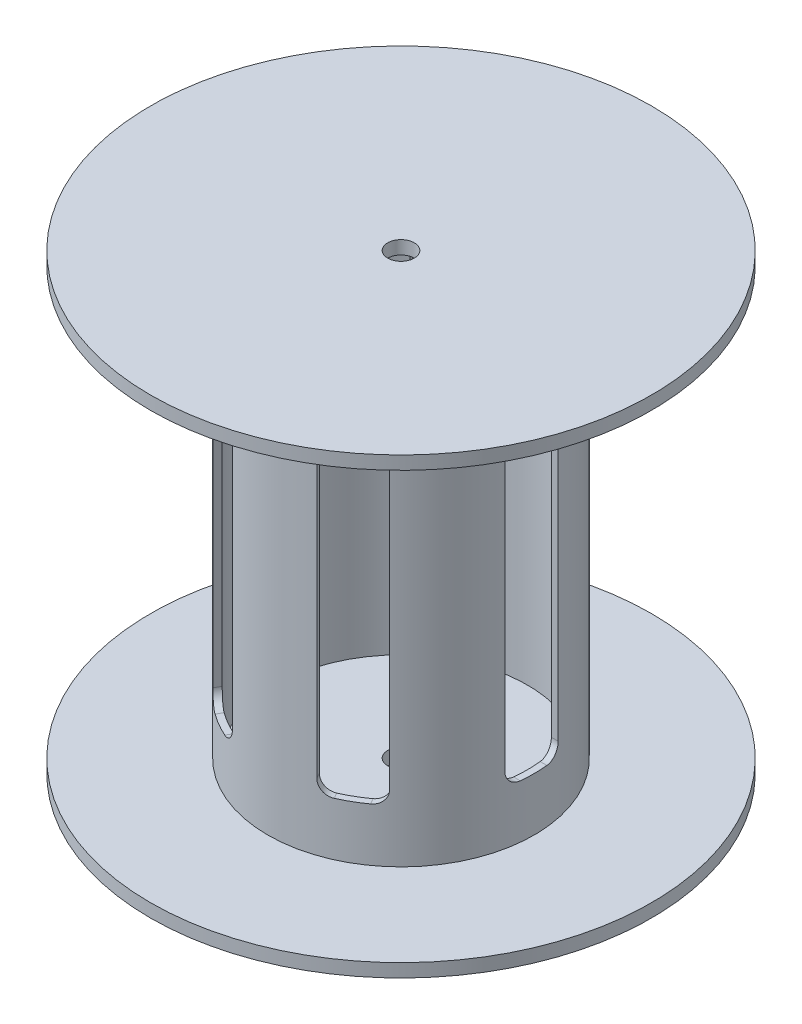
ISO-10303-21;
HEADER;
FILE_DESCRIPTION(('STEP AP214'),'2;1');
FILE_NAME('part.step','',(''),(''),'','','');
FILE_SCHEMA(('AUTOMOTIVE_DESIGN { 1 0 10303 214 1 1 1 1 }'));
ENDSEC;
DATA;
#1=APPLICATION_CONTEXT('core data for automotive mechanical design processes');
#2=APPLICATION_PROTOCOL_DEFINITION('international standard','automotive_design',2000,#1);
#3=PRODUCT_CONTEXT('',#1,'mechanical');
#4=PRODUCT('Part','Part','',(#3));
#5=PRODUCT_RELATED_PRODUCT_CATEGORY('part','',(#4));
#6=PRODUCT_DEFINITION_FORMATION('','',#4);
#7=PRODUCT_DEFINITION_CONTEXT('part definition',#1,'design');
#8=PRODUCT_DEFINITION('design','',#6,#7);
#9=PRODUCT_DEFINITION_SHAPE('','',#8);
#10=(LENGTH_UNIT() NAMED_UNIT(*) SI_UNIT(.MILLI.,.METRE.));
#11=(NAMED_UNIT(*) PLANE_ANGLE_UNIT() SI_UNIT($,.RADIAN.));
#12=(NAMED_UNIT(*) SI_UNIT($,.STERADIAN.) SOLID_ANGLE_UNIT());
#13=UNCERTAINTY_MEASURE_WITH_UNIT(LENGTH_MEASURE(1.E-05),#10,'distance_accuracy_value','');
#14=(GEOMETRIC_REPRESENTATION_CONTEXT(3) GLOBAL_UNCERTAINTY_ASSIGNED_CONTEXT((#13)) GLOBAL_UNIT_ASSIGNED_CONTEXT((#10,
#11,#12)) REPRESENTATION_CONTEXT('',''));
#15=CARTESIAN_POINT('',(0.,0.,0.));
#16=DIRECTION('',(0.,0.,1.));
#17=DIRECTION('',(1.,0.,0.));
#18=AXIS2_PLACEMENT_3D('',#15,#16,#17);
#19=CARTESIAN_POINT('',(0.,3.17500000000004,0.));
#20=DIRECTION('',(0.,1.,0.));
#21=DIRECTION('',(0.,0.,1.));
#22=AXIS2_PLACEMENT_3D('',#19,#20,#21);
#23=PLANE('',#22);
#24=CARTESIAN_POINT('',(0.,3.17500000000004,0.));
#25=DIRECTION('',(0.,1.,0.));
#26=DIRECTION('',(0.,0.,1.));
#27=AXIS2_PLACEMENT_3D('',#24,#25,#26);
#28=CIRCLE('',#27,59.69);
#29=CARTESIAN_POINT('',(0.,3.17500000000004,59.69));
#30=VERTEX_POINT('',#29);
#31=EDGE_CURVE('E940',#30,#30,#28,.T.);
#32=ORIENTED_EDGE('',*,*,#31,.T.);
#33=EDGE_LOOP('',(#32));
#34=FACE_BOUND('',#33,.T.);
#35=CARTESIAN_POINT('',(0.,3.17500000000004,0.));
#36=DIRECTION('',(0.,1.,0.));
#37=DIRECTION('',(0.,0.,1.));
#38=AXIS2_PLACEMENT_3D('',#35,#36,#37);
#39=CIRCLE('',#38,31.75);
#40=CARTESIAN_POINT('',(0.,3.17500000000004,31.75));
#41=VERTEX_POINT('',#40);
#42=EDGE_CURVE('E966',#41,#41,#39,.T.);
#43=ORIENTED_EDGE('',*,*,#42,.F.);
#44=EDGE_LOOP('',(#43));
#45=FACE_BOUND('',#44,.T.);
#46=ADVANCED_FACE('F56',(#34,#45),#23,.T.);
#47=CARTESIAN_POINT('',(0.,3.17500000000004,0.));
#48=DIRECTION('',(0.,-1.,0.));
#49=DIRECTION('',(0.,0.,-1.));
#50=AXIS2_PLACEMENT_3D('',#47,#48,#49);
#51=CYLINDRICAL_SURFACE('',#50,59.69);
#52=ORIENTED_EDGE('',*,*,#31,.F.);
#53=EDGE_LOOP('',(#52));
#54=FACE_BOUND('',#53,.T.);
#55=CARTESIAN_POINT('',(0.,0.,0.));
#56=DIRECTION('',(0.,1.,0.));
#57=DIRECTION('',(0.,0.,1.));
#58=AXIS2_PLACEMENT_3D('',#55,#56,#57);
#59=CIRCLE('',#58,59.69);
#60=CARTESIAN_POINT('',(0.,0.,59.69));
#61=VERTEX_POINT('',#60);
#62=EDGE_CURVE('E942',#61,#61,#59,.T.);
#63=ORIENTED_EDGE('',*,*,#62,.T.);
#64=EDGE_LOOP('',(#63));
#65=FACE_BOUND('',#64,.T.);
#66=ADVANCED_FACE('F58',(#54,#65),#51,.T.);
#67=CARTESIAN_POINT('',(0.,0.,0.));
#68=DIRECTION('',(0.,1.,0.));
#69=DIRECTION('',(0.,0.,1.));
#70=AXIS2_PLACEMENT_3D('',#67,#68,#69);
#71=PLANE('',#70);
#72=CARTESIAN_POINT('',(0.,0.,0.));
#73=DIRECTION('',(0.,1.,0.));
#74=DIRECTION('',(0.,0.,1.));
#75=AXIS2_PLACEMENT_3D('',#72,#73,#74);
#76=CIRCLE('',#75,3.175);
#77=CARTESIAN_POINT('',(0.,0.,3.175));
#78=VERTEX_POINT('',#77);
#79=EDGE_CURVE('E947',#78,#78,#76,.T.);
#80=ORIENTED_EDGE('',*,*,#79,.T.);
#81=EDGE_LOOP('',(#80));
#82=FACE_BOUND('',#81,.T.);
#83=ORIENTED_EDGE('',*,*,#62,.F.);
#84=EDGE_LOOP('',(#83));
#85=FACE_BOUND('',#84,.T.);
#86=ADVANCED_FACE('F923',(#82,#85),#71,.F.);
#87=CARTESIAN_POINT('',(0.,104.775,0.));
#88=DIRECTION('',(0.,-1.,0.));
#89=DIRECTION('',(0.,0.,-1.));
#90=AXIS2_PLACEMENT_3D('',#87,#88,#89);
#91=CYLINDRICAL_SURFACE('',#90,31.75);
#92=CARTESIAN_POINT('',(13.0457949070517,15.875,28.9459796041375));
#93=CARTESIAN_POINT('',(12.9633596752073,15.8749915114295,28.9831368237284));
#94=CARTESIAN_POINT('',(12.8807681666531,15.8788241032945,29.0199326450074));
#95=CARTESIAN_POINT('',(12.7158732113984,15.8940848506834,29.09256127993));
#96=CARTESIAN_POINT('',(12.6335697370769,15.9055122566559,29.1283941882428));
#97=CARTESIAN_POINT('',(12.4699143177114,15.9358613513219,29.1988300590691));
#98=CARTESIAN_POINT('',(12.3885615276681,15.9547757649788,29.2334341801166));
#99=CARTESIAN_POINT('',(12.2273425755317,15.9999311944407,29.3012330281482));
#100=CARTESIAN_POINT('',(12.1474764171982,16.0261722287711,29.3344277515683));
#101=CARTESIAN_POINT('',(11.9109409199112,16.1156401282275,29.4316312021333));
#102=CARTESIAN_POINT('',(11.757227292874,16.1896318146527,29.4933052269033));
#103=CARTESIAN_POINT('',(11.4626384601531,16.3641160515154,29.6090452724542));
#104=CARTESIAN_POINT('',(11.3217626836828,16.4646074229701,29.6631116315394));
#105=CARTESIAN_POINT('',(11.0563784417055,16.6899024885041,29.7630509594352));
#106=CARTESIAN_POINT('',(10.9319487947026,16.8148166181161,29.8088848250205));
#107=CARTESIAN_POINT('',(10.7042097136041,17.0852692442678,29.8914220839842));
#108=CARTESIAN_POINT('',(10.6009034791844,17.2308108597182,29.9281240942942));
#109=CARTESIAN_POINT('',(10.4194773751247,17.5374883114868,29.9917690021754));
#110=CARTESIAN_POINT('',(10.3412055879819,17.6985220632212,30.0187708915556));
#111=CARTESIAN_POINT('',(10.2117900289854,18.0323350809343,30.0630430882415));
#112=CARTESIAN_POINT('',(10.1606240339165,18.2051045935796,30.0803213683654));
#113=CARTESIAN_POINT('',(10.1010490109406,18.4909423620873,30.1003634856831));
#114=CARTESIAN_POINT('',(10.0837974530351,18.6020401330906,30.1061418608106));
#115=CARTESIAN_POINT('',(10.0607712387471,18.8254073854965,30.1138411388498));
#116=CARTESIAN_POINT('',(10.054982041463,18.9376752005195,30.1157669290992));
#117=CARTESIAN_POINT('',(10.0549985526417,19.05,30.1157683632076));
#118=B_SPLINE_CURVE_WITH_KNOTS('',3,(#92,#93,#94,#95,#96,#97,#98,#99,#100,#101,#102,#103,#104,
#105,#106,#107,#108,#109,#110,#111,#112,#113,#114,#115,#116,#117),.UNSPECIFIED.,.F.,.F.,(4,2,2,
2,2,2,2,2,2,2,2,2,4),(0.,0.271175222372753,0.542323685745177,0.813209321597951,1.08409564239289,
1.62551746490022,2.16691520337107,2.71082016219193,3.25480744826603,3.79542808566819,
4.33560479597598,4.6727312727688,5.0094298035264),.UNSPECIFIED.);
#119=CARTESIAN_POINT('',(13.0457949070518,15.875,28.9459796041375));
#120=VERTEX_POINT('',#119);
#121=CARTESIAN_POINT('',(10.0549985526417,19.05,30.1157683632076));
#122=VERTEX_POINT('',#121);
#123=EDGE_CURVE('E373',#120,#122,#118,.T.);
#124=ORIENTED_EDGE('',*,*,#123,.T.);
#125=DIRECTION('',(0.,-1.,0.));
#126=VECTOR('',#125,1.);
#127=CARTESIAN_POINT('',(10.0549985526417,104.775,30.1157683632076));
#128=LINE('',#127,#126);
#129=CARTESIAN_POINT('',(10.0549985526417,88.9,30.1157683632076));
#130=VERTEX_POINT('',#129);
#131=EDGE_CURVE('E76',#122,#130,#128,.F.);
#132=ORIENTED_EDGE('',*,*,#131,.T.);
#133=CARTESIAN_POINT('',(10.0549985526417,88.9,30.1157683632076));
#134=CARTESIAN_POINT('',(10.054987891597,88.9881802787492,30.1157689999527));
#135=CARTESIAN_POINT('',(10.0585547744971,89.076355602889,30.1145809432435));
#136=CARTESIAN_POINT('',(10.0727618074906,89.252061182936,30.1098334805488));
#137=CARTESIAN_POINT('',(10.0834012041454,89.3395915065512,30.1062743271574));
#138=CARTESIAN_POINT('',(10.1116507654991,89.5132636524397,30.0967976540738));
#139=CARTESIAN_POINT('',(10.1292506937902,89.5994073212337,30.0908835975));
#140=CARTESIAN_POINT('',(10.1712442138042,89.7698010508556,30.0767148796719));
#141=CARTESIAN_POINT('',(10.1956378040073,89.8540511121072,30.0684602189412));
#142=CARTESIAN_POINT('',(10.2787314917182,90.1031071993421,30.0402006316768));
#143=CARTESIAN_POINT('',(10.3473644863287,90.2643405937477,30.0166935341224));
#144=CARTESIAN_POINT('',(10.5086829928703,90.5724419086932,29.9605961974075));
#145=CARTESIAN_POINT('',(10.6013698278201,90.7193090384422,29.9280054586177));
#146=CARTESIAN_POINT('',(10.8089705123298,90.9964500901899,29.8536583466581));
#147=CARTESIAN_POINT('',(10.9241191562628,91.126522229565,29.811804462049));
#148=CARTESIAN_POINT('',(11.1723912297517,91.364705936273,29.7196513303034));
#149=CARTESIAN_POINT('',(11.3055191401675,91.4728120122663,29.6693499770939));
#150=CARTESIAN_POINT('',(11.5879924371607,91.6657177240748,29.560179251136));
#151=CARTESIAN_POINT('',(11.7375628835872,91.7501175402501,29.5011858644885));
#152=CARTESIAN_POINT('',(12.0466437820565,91.8908818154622,29.3763269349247));
#153=CARTESIAN_POINT('',(12.2061485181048,91.9472622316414,29.3104653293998));
#154=CARTESIAN_POINT('',(12.4797602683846,92.017403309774,29.1947387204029));
#155=CARTESIAN_POINT('',(12.5925247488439,92.0389702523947,29.1462846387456));
#156=CARTESIAN_POINT('',(12.8188765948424,92.067770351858,29.0474493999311));
#157=CARTESIAN_POINT('',(12.9324628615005,92.0750200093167,28.9970705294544));
#158=CARTESIAN_POINT('',(13.0457949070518,92.075,28.9459796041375));
#159=B_SPLINE_CURVE_WITH_KNOTS('',3,(#133,#134,#135,#136,#137,#138,#139,#140,#141,#142,#143,
#144,#145,#146,#147,#148,#149,#150,#151,#152,#153,#154,#155,#156,#157,#158),.UNSPECIFIED.,.F.,
.F.,(4,2,2,2,2,2,2,2,2,2,2,2,4),(0.,0.264452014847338,0.528875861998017,0.792912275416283,
1.05694862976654,1.58465617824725,2.11239275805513,2.64597398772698,3.17968844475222,
3.72192720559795,4.26385680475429,4.63690687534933,5.00952675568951),.UNSPECIFIED.);
#160=CARTESIAN_POINT('',(13.0457949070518,92.075,28.9459796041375));
#161=VERTEX_POINT('',#160);
#162=EDGE_CURVE('E386',#130,#161,#159,.T.);
#163=ORIENTED_EDGE('',*,*,#162,.T.);
#164=CARTESIAN_POINT('',(0.,92.075,0.));
#165=DIRECTION('',(0.,1.,0.));
#166=DIRECTION('',(0.866025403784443,0.,-0.499999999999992));
#167=AXIS2_PLACEMENT_3D('',#164,#165,#166);
#168=CIRCLE('',#167,31.75);
#169=CARTESIAN_POINT('',(18.5450562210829,92.075,25.7709796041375));
#170=VERTEX_POINT('',#169);
#171=EDGE_CURVE('E1552',#161,#170,#168,.T.);
#172=ORIENTED_EDGE('',*,*,#171,.T.);
#173=CARTESIAN_POINT('',(18.5450562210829,92.075,25.7709796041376));
#174=CARTESIAN_POINT('',(18.6184529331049,92.0750084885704,25.7181672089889));
#175=CARTESIAN_POINT('',(18.6916148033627,92.0711758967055,25.6650387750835));
#176=CARTESIAN_POINT('',(18.8369605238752,92.0559151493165,25.5585498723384));
#177=CARTESIAN_POINT('',(18.9091444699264,92.044487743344,25.5051894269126));
#178=CARTESIAN_POINT('',(19.0519714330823,92.0141386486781,25.3986776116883));
#179=CARTESIAN_POINT('',(19.1226158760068,91.9952242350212,25.3455260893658));
#180=CARTESIAN_POINT('',(19.2619408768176,91.9500688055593,25.23980580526));
#181=CARTESIAN_POINT('',(19.3306214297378,91.9238277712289,25.1872370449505));
#182=CARTESIAN_POINT('',(19.5330698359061,91.8343598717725,25.0309930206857));
#183=CARTESIAN_POINT('',(19.6633379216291,91.7603681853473,24.9287101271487));
#184=CARTESIAN_POINT('',(19.9108661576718,91.5858839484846,24.7314587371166));
#185=CARTESIAN_POINT('',(20.0281268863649,91.4853925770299,24.636489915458));
#186=CARTESIAN_POINT('',(20.2473690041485,91.2600975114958,24.4566300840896));
#187=CARTESIAN_POINT('',(20.3492771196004,91.1351833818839,24.3717877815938));
#188=CARTESIAN_POINT('',(20.5346260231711,90.8647307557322,24.2158285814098));
#189=CARTESIAN_POINT('',(20.6180640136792,90.7191891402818,24.144713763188));
#190=CARTESIAN_POINT('',(20.7638951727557,90.4125116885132,24.0194166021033));
#191=CARTESIAN_POINT('',(20.8264153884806,90.2514779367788,23.9651321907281));
#192=CARTESIAN_POINT('',(20.9294640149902,89.9176649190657,23.8751911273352));
#193=CARTESIAN_POINT('',(20.9700104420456,89.7448954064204,23.8395192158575));
#194=CARTESIAN_POINT('',(21.0171549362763,89.4590576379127,23.7979467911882));
#195=CARTESIAN_POINT('',(21.0307849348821,89.3479598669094,23.7858956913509));
#196=CARTESIAN_POINT('',(21.0489658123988,89.1245926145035,23.7698040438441));
#197=CARTESIAN_POINT('',(21.0535281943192,89.0123247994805,23.7657533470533));
#198=CARTESIAN_POINT('',(21.0535211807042,88.9,23.7657683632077));
#199=B_SPLINE_CURVE_WITH_KNOTS('',3,(#173,#174,#175,#176,#177,#178,#179,#180,#181,#182,#183,
#184,#185,#186,#187,#188,#189,#190,#191,#192,#193,#194,#195,#196,#197,#198),.UNSPECIFIED.,.F.,
.F.,(4,2,2,2,2,2,2,2,2,2,2,2,4),(0.,0.271175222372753,0.54232368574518,0.813209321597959,
1.08409564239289,1.62551746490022,2.16691520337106,2.71082016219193,3.25480744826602,
3.79542808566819,4.33560479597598,4.6727312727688,5.0094298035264),.UNSPECIFIED.);
#200=CARTESIAN_POINT('',(21.0535211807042,88.9,23.7657683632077));
#201=VERTEX_POINT('',#200);
#202=EDGE_CURVE('E1541',#170,#201,#199,.T.);
#203=ORIENTED_EDGE('',*,*,#202,.T.);
#204=DIRECTION('',(0.,-1.,0.));
#205=VECTOR('',#204,1.);
#206=CARTESIAN_POINT('',(21.0535211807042,104.775,23.7657683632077));
#207=LINE('',#206,#205);
#208=CARTESIAN_POINT('',(21.0535211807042,19.05,23.7657683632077));
#209=VERTEX_POINT('',#208);
#210=EDGE_CURVE('E1571',#201,#209,#207,.T.);
#211=ORIENTED_EDGE('',*,*,#210,.T.);
#212=CARTESIAN_POINT('',(21.0535211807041,19.05,23.7657683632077));
#213=CARTESIAN_POINT('',(21.053527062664,18.9618197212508,23.7657594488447));
#214=CARTESIAN_POINT('',(21.0507147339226,18.873644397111,23.7682544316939));
#215=CARTESIAN_POINT('',(21.0394997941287,18.697938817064,23.7781843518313));
#216=CARTESIAN_POINT('',(21.0310977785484,18.6104084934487,23.7856187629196));
#217=CARTESIAN_POINT('',(21.0087659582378,18.4367363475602,23.8053452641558));
#218=CARTESIAN_POINT('',(20.99484427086,18.3505926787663,23.8176302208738));
#219=CARTESIAN_POINT('',(20.9615770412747,18.1801989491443,23.8469133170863));
#220=CARTESIAN_POINT('',(20.9422315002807,18.0959488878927,23.8639114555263));
#221=CARTESIAN_POINT('',(20.8762111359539,17.8468928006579,23.9217429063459));
#222=CARTESIAN_POINT('',(20.8215368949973,17.6856594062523,23.9694272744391));
#223=CARTESIAN_POINT('',(20.6922959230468,17.3775580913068,24.0810845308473));
#224=CARTESIAN_POINT('',(20.6177280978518,17.2306909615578,24.1450583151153));
#225=CARTESIAN_POINT('',(20.4495412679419,16.9535499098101,24.287672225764));
#226=CARTESIAN_POINT('',(20.3557204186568,16.823477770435,24.3664669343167));
#227=CARTESIAN_POINT('',(20.1517774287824,16.5852940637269,24.5354002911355));
#228=CARTESIAN_POINT('',(20.0416512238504,16.4771879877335,24.6255417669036));
#229=CARTESIAN_POINT('',(19.8058699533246,16.2842822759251,24.8155854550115));
#230=CARTESIAN_POINT('',(19.6799949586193,16.1998824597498,24.9156205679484));
#231=CARTESIAN_POINT('',(19.4173235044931,16.0591181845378,25.1208630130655));
#232=CARTESIAN_POINT('',(19.2805333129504,16.0027377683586,25.2260673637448));
#233=CARTESIAN_POINT('',(19.0435052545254,15.932596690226,25.4051587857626));
#234=CARTESIAN_POINT('',(18.9451605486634,15.9110297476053,25.4785886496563));
#235=CARTESIAN_POINT('',(18.7463907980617,15.882229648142,25.6251974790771));
#236=CARTESIAN_POINT('',(18.6459682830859,15.8749799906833,25.6983766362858));
#237=CARTESIAN_POINT('',(18.5450562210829,15.875,25.7709796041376));
#238=B_SPLINE_CURVE_WITH_KNOTS('',3,(#212,#213,#214,#215,#216,#217,#218,#219,#220,#221,#222,
#223,#224,#225,#226,#227,#228,#229,#230,#231,#232,#233,#234,#235,#236,#237),.UNSPECIFIED.,.F.,
.F.,(4,2,2,2,2,2,2,2,2,2,2,2,4),(0.,0.264452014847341,0.528875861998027,0.792912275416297,
1.05694862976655,1.58465617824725,2.11239275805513,2.64597398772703,3.1796884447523,
3.721927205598,4.26385680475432,4.63690687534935,5.00952675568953),.UNSPECIFIED.);
#239=CARTESIAN_POINT('',(18.5450562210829,15.875,25.7709796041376));
#240=VERTEX_POINT('',#239);
#241=EDGE_CURVE('E1524',#209,#240,#238,.T.);
#242=ORIENTED_EDGE('',*,*,#241,.T.);
#243=CARTESIAN_POINT('',(0.,15.875,0.));
#244=DIRECTION('',(0.,-1.,0.));
#245=DIRECTION('',(-0.866025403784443,0.,0.499999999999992));
#246=AXIS2_PLACEMENT_3D('',#243,#244,#245);
#247=CIRCLE('',#246,31.75);
#248=EDGE_CURVE('E1514',#240,#120,#247,.T.);
#249=ORIENTED_EDGE('',*,*,#248,.T.);
#250=EDGE_LOOP('',(#124,#132,#163,#172,#203,#211,#242,#249));
#251=FACE_BOUND('',#250,.T.);
#252=CARTESIAN_POINT('',(18.5450562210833,15.875,-25.7709796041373));
#253=CARTESIAN_POINT('',(18.6184529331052,15.8749915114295,-25.7181672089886));
#254=CARTESIAN_POINT('',(18.6916148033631,15.8788241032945,-25.6650387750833));
#255=CARTESIAN_POINT('',(18.8369605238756,15.8940848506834,-25.5585498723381));
#256=CARTESIAN_POINT('',(18.9091444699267,15.9055122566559,-25.5051894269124));
#257=CARTESIAN_POINT('',(19.0519714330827,15.9358613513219,-25.398677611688));
#258=CARTESIAN_POINT('',(19.1226158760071,15.9547757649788,-25.3455260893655));
#259=CARTESIAN_POINT('',(19.261940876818,15.9999311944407,-25.2398058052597));
#260=CARTESIAN_POINT('',(19.3306214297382,16.0261722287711,-25.1872370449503));
#261=CARTESIAN_POINT('',(19.5330698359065,16.1156401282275,-25.0309930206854));
#262=CARTESIAN_POINT('',(19.6633379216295,16.1896318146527,-24.9287101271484));
#263=CARTESIAN_POINT('',(19.9108661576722,16.3641160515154,-24.7314587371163));
#264=CARTESIAN_POINT('',(20.0281268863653,16.4646074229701,-24.6364899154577));
#265=CARTESIAN_POINT('',(20.2473690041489,16.6899024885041,-24.4566300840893));
#266=CARTESIAN_POINT('',(20.3492771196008,16.814816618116,-24.3717877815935));
#267=CARTESIAN_POINT('',(20.5346260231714,17.0852692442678,-24.2158285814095));
#268=CARTESIAN_POINT('',(20.6180640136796,17.2308108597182,-24.1447137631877));
#269=CARTESIAN_POINT('',(20.7638951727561,17.5374883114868,-24.019416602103));
#270=CARTESIAN_POINT('',(20.8264153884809,17.6985220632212,-23.9651321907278));
#271=CARTESIAN_POINT('',(20.9294640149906,18.0323350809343,-23.8751911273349));
#272=CARTESIAN_POINT('',(20.970010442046,18.2051045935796,-23.8395192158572));
#273=CARTESIAN_POINT('',(21.0171549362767,18.4909423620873,-23.7979467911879));
#274=CARTESIAN_POINT('',(21.0307849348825,18.6020401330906,-23.7858956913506));
#275=CARTESIAN_POINT('',(21.0489658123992,18.8254073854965,-23.7698040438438));
#276=CARTESIAN_POINT('',(21.0535281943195,18.9376752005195,-23.765753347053));
#277=CARTESIAN_POINT('',(21.0535211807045,19.05,-23.7657683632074));
#278=B_SPLINE_CURVE_WITH_KNOTS('',3,(#252,#253,#254,#255,#256,#257,#258,#259,#260,#261,#262,
#263,#264,#265,#266,#267,#268,#269,#270,#271,#272,#273,#274,#275,#276,#277),.UNSPECIFIED.,.F.,
.F.,(4,2,2,2,2,2,2,2,2,2,2,2,4),(0.,0.271175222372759,0.542323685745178,0.813209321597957,
1.08409564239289,1.62551746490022,2.16691520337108,2.71082016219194,3.25480744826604,
3.79542808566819,4.33560479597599,4.67273127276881,5.00942980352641),.UNSPECIFIED.);
#279=CARTESIAN_POINT('',(18.5450562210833,15.875,-25.7709796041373));
#280=VERTEX_POINT('',#279);
#281=CARTESIAN_POINT('',(21.0535211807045,19.05,-23.7657683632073));
#282=VERTEX_POINT('',#281);
#283=EDGE_CURVE('E405',#280,#282,#278,.T.);
#284=ORIENTED_EDGE('',*,*,#283,.T.);
#285=DIRECTION('',(0.,-1.,0.));
#286=VECTOR('',#285,1.);
#287=CARTESIAN_POINT('',(21.0535211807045,104.775,-23.7657683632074));
#288=LINE('',#287,#286);
#289=CARTESIAN_POINT('',(21.0535211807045,88.9,-23.7657683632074));
#290=VERTEX_POINT('',#289);
#291=EDGE_CURVE('E502',#282,#290,#288,.F.);
#292=ORIENTED_EDGE('',*,*,#291,.T.);
#293=CARTESIAN_POINT('',(21.0535211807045,88.9,-23.7657683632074));
#294=CARTESIAN_POINT('',(21.0535270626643,88.9881802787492,-23.7657594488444));
#295=CARTESIAN_POINT('',(21.050714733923,89.076355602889,-23.7682544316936));
#296=CARTESIAN_POINT('',(21.0394997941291,89.252061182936,-23.778184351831));
#297=CARTESIAN_POINT('',(21.0310977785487,89.3395915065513,-23.7856187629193));
#298=CARTESIAN_POINT('',(21.0087659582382,89.5132636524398,-23.8053452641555));
#299=CARTESIAN_POINT('',(20.9948442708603,89.5994073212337,-23.8176302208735));
#300=CARTESIAN_POINT('',(20.9615770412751,89.7698010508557,-23.846913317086));
#301=CARTESIAN_POINT('',(20.9422315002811,89.8540511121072,-23.863911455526));
#302=CARTESIAN_POINT('',(20.8762111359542,90.1031071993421,-23.9217429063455));
#303=CARTESIAN_POINT('',(20.8215368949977,90.2643405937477,-23.9694272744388));
#304=CARTESIAN_POINT('',(20.6922959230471,90.5724419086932,-24.081084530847));
#305=CARTESIAN_POINT('',(20.6177280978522,90.7193090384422,-24.145058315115));
#306=CARTESIAN_POINT('',(20.4495412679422,90.9964500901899,-24.2876722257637));
#307=CARTESIAN_POINT('',(20.3557204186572,91.126522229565,-24.3664669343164));
#308=CARTESIAN_POINT('',(20.1517774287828,91.364705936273,-24.5354002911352));
#309=CARTESIAN_POINT('',(20.0416512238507,91.4728120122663,-24.6255417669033));
#310=CARTESIAN_POINT('',(19.8058699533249,91.6657177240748,-24.8155854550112));
#311=CARTESIAN_POINT('',(19.6799949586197,91.7501175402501,-24.9156205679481));
#312=CARTESIAN_POINT('',(19.4173235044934,91.8908818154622,-25.1208630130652));
#313=CARTESIAN_POINT('',(19.2805333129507,91.9472622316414,-25.2260673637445));
#314=CARTESIAN_POINT('',(19.0435052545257,92.017403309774,-25.4051587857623));
#315=CARTESIAN_POINT('',(18.9451605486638,92.0389702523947,-25.478588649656));
#316=CARTESIAN_POINT('',(18.7463907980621,92.067770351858,-25.6251974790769));
#317=CARTESIAN_POINT('',(18.6459682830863,92.0750200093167,-25.6983766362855));
#318=CARTESIAN_POINT('',(18.5450562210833,92.075,-25.7709796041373));
#319=B_SPLINE_CURVE_WITH_KNOTS('',3,(#293,#294,#295,#296,#297,#298,#299,#300,#301,#302,#303,
#304,#305,#306,#307,#308,#309,#310,#311,#312,#313,#314,#315,#316,#317,#318),.UNSPECIFIED.,.F.,
.F.,(4,2,2,2,2,2,2,2,2,2,2,2,4),(0.,0.264452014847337,0.528875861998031,0.792912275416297,
1.05694862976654,1.58465617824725,2.11239275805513,2.64597398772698,3.17968844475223,
3.72192720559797,4.2638568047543,4.63690687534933,5.00952675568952),.UNSPECIFIED.);
#320=CARTESIAN_POINT('',(18.5450562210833,92.075,-25.7709796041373));
#321=VERTEX_POINT('',#320);
#322=EDGE_CURVE('E493',#290,#321,#319,.T.);
#323=ORIENTED_EDGE('',*,*,#322,.T.);
#324=CARTESIAN_POINT('',(0.,92.075,0.));
#325=DIRECTION('',(0.,1.,0.));
#326=DIRECTION('',(-0.866025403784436,0.,-0.500000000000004));
#327=AXIS2_PLACEMENT_3D('',#324,#325,#326);
#328=CIRCLE('',#327,31.75);
#329=CARTESIAN_POINT('',(13.0457949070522,92.075,-28.9459796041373));
#330=VERTEX_POINT('',#329);
#331=EDGE_CURVE('E1604',#321,#330,#328,.T.);
#332=ORIENTED_EDGE('',*,*,#331,.T.);
#333=CARTESIAN_POINT('',(13.0457949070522,92.075,-28.9459796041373));
#334=CARTESIAN_POINT('',(12.9633596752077,92.0750084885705,-28.9831368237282));
#335=CARTESIAN_POINT('',(12.8807681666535,92.0711758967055,-29.0199326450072));
#336=CARTESIAN_POINT('',(12.7158732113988,92.0559151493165,-29.0925612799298));
#337=CARTESIAN_POINT('',(12.6335697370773,92.044487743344,-29.1283941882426));
#338=CARTESIAN_POINT('',(12.4699143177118,92.014138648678,-29.1988300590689));
#339=CARTESIAN_POINT('',(12.3885615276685,91.9952242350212,-29.2334341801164));
#340=CARTESIAN_POINT('',(12.2273425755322,91.9500688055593,-29.301233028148));
#341=CARTESIAN_POINT('',(12.1474764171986,91.9238277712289,-29.3344277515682));
#342=CARTESIAN_POINT('',(11.9109409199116,91.8343598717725,-29.4316312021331));
#343=CARTESIAN_POINT('',(11.7572272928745,91.7603681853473,-29.4933052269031));
#344=CARTESIAN_POINT('',(11.4626384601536,91.5858839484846,-29.609045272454));
#345=CARTESIAN_POINT('',(11.3217626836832,91.4853925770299,-29.6631116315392));
#346=CARTESIAN_POINT('',(11.056378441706,91.2600975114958,-29.7630509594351));
#347=CARTESIAN_POINT('',(10.9319487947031,91.1351833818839,-29.8088848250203));
#348=CARTESIAN_POINT('',(10.7042097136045,90.8647307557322,-29.8914220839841));
#349=CARTESIAN_POINT('',(10.6009034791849,90.7191891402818,-29.928124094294));
#350=CARTESIAN_POINT('',(10.4194773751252,90.4125116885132,-29.9917690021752));
#351=CARTESIAN_POINT('',(10.3412055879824,90.2514779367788,-30.0187708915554));
#352=CARTESIAN_POINT('',(10.2117900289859,89.9176649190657,-30.0630430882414));
#353=CARTESIAN_POINT('',(10.160624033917,89.7448954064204,-30.0803213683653));
#354=CARTESIAN_POINT('',(10.101049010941,89.4590576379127,-30.100363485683));
#355=CARTESIAN_POINT('',(10.0837974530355,89.3479598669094,-30.1061418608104));
#356=CARTESIAN_POINT('',(10.0607712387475,89.1245926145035,-30.1138411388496));
#357=CARTESIAN_POINT('',(10.0549820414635,89.0123247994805,-30.115766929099));
#358=CARTESIAN_POINT('',(10.0549985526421,88.9,-30.1157683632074));
#359=B_SPLINE_CURVE_WITH_KNOTS('',3,(#333,#334,#335,#336,#337,#338,#339,#340,#341,#342,#343,
#344,#345,#346,#347,#348,#349,#350,#351,#352,#353,#354,#355,#356,#357,#358),.UNSPECIFIED.,.F.,
.F.,(4,2,2,2,2,2,2,2,2,2,2,2,4),(0.,0.271175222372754,0.54232368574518,0.813209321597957,
1.08409564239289,1.62551746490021,2.16691520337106,2.71082016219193,3.25480744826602,
3.79542808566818,4.33560479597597,4.67273127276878,5.00942980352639),.UNSPECIFIED.);
#360=CARTESIAN_POINT('',(10.0549985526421,88.9,-30.1157683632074));
#361=VERTEX_POINT('',#360);
#362=EDGE_CURVE('E457',#330,#361,#359,.T.);
#363=ORIENTED_EDGE('',*,*,#362,.T.);
#364=DIRECTION('',(0.,-1.,0.));
#365=VECTOR('',#364,1.);
#366=CARTESIAN_POINT('',(10.0549985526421,104.775,-30.1157683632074));
#367=LINE('',#366,#365);
#368=CARTESIAN_POINT('',(10.0549985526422,19.05,-30.1157683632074));
#369=VERTEX_POINT('',#368);
#370=EDGE_CURVE('E1590',#361,#369,#367,.T.);
#371=ORIENTED_EDGE('',*,*,#370,.T.);
#372=CARTESIAN_POINT('',(10.0549985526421,19.05,-30.1157683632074));
#373=CARTESIAN_POINT('',(10.0549878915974,18.9618197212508,-30.1157689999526));
#374=CARTESIAN_POINT('',(10.0585547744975,18.873644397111,-30.1145809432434));
#375=CARTESIAN_POINT('',(10.072761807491,18.697938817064,-30.1098334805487));
#376=CARTESIAN_POINT('',(10.0834012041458,18.6104084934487,-30.1062743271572));
#377=CARTESIAN_POINT('',(10.1116507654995,18.4367363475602,-30.0967976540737));
#378=CARTESIAN_POINT('',(10.1292506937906,18.3505926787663,-30.0908835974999));
#379=CARTESIAN_POINT('',(10.1712442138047,18.1801989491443,-30.0767148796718));
#380=CARTESIAN_POINT('',(10.1956378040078,18.0959488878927,-30.068460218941));
#381=CARTESIAN_POINT('',(10.2787314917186,17.8468928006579,-30.0402006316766));
#382=CARTESIAN_POINT('',(10.3473644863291,17.6856594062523,-30.0166935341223));
#383=CARTESIAN_POINT('',(10.5086829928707,17.3775580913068,-29.9605961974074));
#384=CARTESIAN_POINT('',(10.6013698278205,17.2306909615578,-29.9280054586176));
#385=CARTESIAN_POINT('',(10.8089705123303,16.9535499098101,-29.8536583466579));
#386=CARTESIAN_POINT('',(10.9241191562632,16.823477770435,-29.8118044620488));
#387=CARTESIAN_POINT('',(11.1723912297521,16.5852940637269,-29.7196513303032));
#388=CARTESIAN_POINT('',(11.3055191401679,16.4771879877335,-29.6693499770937));
#389=CARTESIAN_POINT('',(11.5879924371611,16.2842822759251,-29.5601792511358));
#390=CARTESIAN_POINT('',(11.7375628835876,16.1998824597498,-29.5011858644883));
#391=CARTESIAN_POINT('',(12.046643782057,16.0591181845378,-29.3763269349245));
#392=CARTESIAN_POINT('',(12.2061485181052,16.0027377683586,-29.3104653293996));
#393=CARTESIAN_POINT('',(12.479760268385,15.932596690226,-29.1947387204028));
#394=CARTESIAN_POINT('',(12.5925247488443,15.9110297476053,-29.1462846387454));
#395=CARTESIAN_POINT('',(12.8188765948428,15.882229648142,-29.0474493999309));
#396=CARTESIAN_POINT('',(12.9324628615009,15.8749799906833,-28.9970705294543));
#397=CARTESIAN_POINT('',(13.0457949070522,15.875,-28.9459796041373));
#398=B_SPLINE_CURVE_WITH_KNOTS('',3,(#372,#373,#374,#375,#376,#377,#378,#379,#380,#381,#382,
#383,#384,#385,#386,#387,#388,#389,#390,#391,#392,#393,#394,#395,#396,#397),.UNSPECIFIED.,.F.,
.F.,(4,2,2,2,2,2,2,2,2,2,2,2,4),(0.,0.264452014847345,0.528875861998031,0.792912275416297,
1.05694862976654,1.58465617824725,2.11239275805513,2.64597398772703,3.1796884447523,
3.721927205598,4.26385680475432,4.63690687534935,5.00952675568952),.UNSPECIFIED.);
#399=CARTESIAN_POINT('',(13.0457949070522,15.875,-28.9459796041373));
#400=VERTEX_POINT('',#399);
#401=EDGE_CURVE('E440',#369,#400,#398,.T.);
#402=ORIENTED_EDGE('',*,*,#401,.T.);
#403=CARTESIAN_POINT('',(0.,15.875,0.));
#404=DIRECTION('',(0.,-1.,0.));
#405=DIRECTION('',(0.866025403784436,0.,0.500000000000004));
#406=AXIS2_PLACEMENT_3D('',#403,#404,#405);
#407=CIRCLE('',#406,31.75);
#408=EDGE_CURVE('E1623',#400,#280,#407,.T.);
#409=ORIENTED_EDGE('',*,*,#408,.T.);
#410=EDGE_LOOP('',(#284,#292,#323,#332,#363,#371,#402,#409));
#411=FACE_BOUND('',#410,.T.);
#412=DIRECTION('',(0.,-1.,0.));
#413=VECTOR('',#412,1.);
#414=CARTESIAN_POINT('',(-21.0535211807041,104.775,-23.7657683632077));
#415=LINE('',#414,#413);
#416=CARTESIAN_POINT('',(-21.0535211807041,88.9,-23.7657683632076));
#417=VERTEX_POINT('',#416);
#418=CARTESIAN_POINT('',(-21.0535211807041,19.05,-23.7657683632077));
#419=VERTEX_POINT('',#418);
#420=EDGE_CURVE('E507',#417,#419,#415,.T.);
#421=ORIENTED_EDGE('',*,*,#420,.T.);
#422=CARTESIAN_POINT('',(-21.0535211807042,19.05,-23.7657683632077));
#423=CARTESIAN_POINT('',(-21.053527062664,18.9618197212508,-23.7657594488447));
#424=CARTESIAN_POINT('',(-21.0507147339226,18.873644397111,-23.7682544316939));
#425=CARTESIAN_POINT('',(-21.0394997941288,18.697938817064,-23.7781843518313));
#426=CARTESIAN_POINT('',(-21.0310977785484,18.6104084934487,-23.7856187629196));
#427=CARTESIAN_POINT('',(-21.0087659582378,18.4367363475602,-23.8053452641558));
#428=CARTESIAN_POINT('',(-20.99484427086,18.3505926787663,-23.8176302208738));
#429=CARTESIAN_POINT('',(-20.9615770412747,18.1801989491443,-23.8469133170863));
#430=CARTESIAN_POINT('',(-20.9422315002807,18.0959488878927,-23.8639114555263));
#431=CARTESIAN_POINT('',(-20.8762111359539,17.8468928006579,-23.9217429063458));
#432=CARTESIAN_POINT('',(-20.8215368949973,17.6856594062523,-23.9694272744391));
#433=CARTESIAN_POINT('',(-20.6922959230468,17.3775580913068,-24.0810845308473));
#434=CARTESIAN_POINT('',(-20.6177280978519,17.2306909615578,-24.1450583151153));
#435=CARTESIAN_POINT('',(-20.4495412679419,16.9535499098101,-24.2876722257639));
#436=CARTESIAN_POINT('',(-20.3557204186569,16.823477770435,-24.3664669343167));
#437=CARTESIAN_POINT('',(-20.1517774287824,16.5852940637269,-24.5354002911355));
#438=CARTESIAN_POINT('',(-20.0416512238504,16.4771879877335,-24.6255417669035));
#439=CARTESIAN_POINT('',(-19.8058699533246,16.2842822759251,-24.8155854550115));
#440=CARTESIAN_POINT('',(-19.6799949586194,16.1998824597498,-24.9156205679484));
#441=CARTESIAN_POINT('',(-19.4173235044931,16.0591181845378,-25.1208630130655));
#442=CARTESIAN_POINT('',(-19.2805333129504,16.0027377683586,-25.2260673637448));
#443=CARTESIAN_POINT('',(-19.0435052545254,15.932596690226,-25.4051587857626));
#444=CARTESIAN_POINT('',(-18.9451605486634,15.9110297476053,-25.4785886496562));
#445=CARTESIAN_POINT('',(-18.7463907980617,15.882229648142,-25.6251974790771));
#446=CARTESIAN_POINT('',(-18.6459682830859,15.8749799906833,-25.6983766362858));
#447=CARTESIAN_POINT('',(-18.5450562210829,15.875,-25.7709796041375));
#448=B_SPLINE_CURVE_WITH_KNOTS('',3,(#422,#423,#424,#425,#426,#427,#428,#429,#430,#431,#432,
#433,#434,#435,#436,#437,#438,#439,#440,#441,#442,#443,#444,#445,#446,#447),.UNSPECIFIED.,.F.,
.F.,(4,2,2,2,2,2,2,2,2,2,2,2,4),(0.,0.264452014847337,0.528875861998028,0.792912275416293,
1.05694862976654,1.58465617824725,2.11239275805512,2.64597398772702,3.1796884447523,
3.721927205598,4.26385680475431,4.63690687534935,5.00952675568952),.UNSPECIFIED.);
#449=CARTESIAN_POINT('',(-18.5450562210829,15.875,-25.7709796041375));
#450=VERTEX_POINT('',#449);
#451=EDGE_CURVE('E608',#419,#450,#448,.T.);
#452=ORIENTED_EDGE('',*,*,#451,.T.);
#453=CARTESIAN_POINT('',(0.,15.875,0.));
#454=DIRECTION('',(0.,-1.,0.));
#455=DIRECTION('',(-0.866025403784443,0.,0.499999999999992));
#456=AXIS2_PLACEMENT_3D('',#453,#454,#455);
#457=CIRCLE('',#456,31.75);
#458=CARTESIAN_POINT('',(-13.0457949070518,15.875,-28.9459796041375));
#459=VERTEX_POINT('',#458);
#460=EDGE_CURVE('E1674',#450,#459,#457,.T.);
#461=ORIENTED_EDGE('',*,*,#460,.T.);
#462=CARTESIAN_POINT('',(-13.0457949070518,15.875,-28.9459796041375));
#463=CARTESIAN_POINT('',(-12.9633596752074,15.8749915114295,-28.9831368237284));
#464=CARTESIAN_POINT('',(-12.8807681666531,15.8788241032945,-29.0199326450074));
#465=CARTESIAN_POINT('',(-12.7158732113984,15.8940848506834,-29.09256127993));
#466=CARTESIAN_POINT('',(-12.6335697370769,15.9055122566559,-29.1283941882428));
#467=CARTESIAN_POINT('',(-12.4699143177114,15.9358613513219,-29.1988300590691));
#468=CARTESIAN_POINT('',(-12.3885615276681,15.9547757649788,-29.2334341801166));
#469=CARTESIAN_POINT('',(-12.2273425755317,15.9999311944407,-29.3012330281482));
#470=CARTESIAN_POINT('',(-12.1474764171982,16.0261722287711,-29.3344277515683));
#471=CARTESIAN_POINT('',(-11.9109409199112,16.1156401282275,-29.4316312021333));
#472=CARTESIAN_POINT('',(-11.757227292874,16.1896318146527,-29.4933052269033));
#473=CARTESIAN_POINT('',(-11.4626384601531,16.3641160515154,-29.6090452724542));
#474=CARTESIAN_POINT('',(-11.3217626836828,16.4646074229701,-29.6631116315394));
#475=CARTESIAN_POINT('',(-11.0563784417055,16.6899024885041,-29.7630509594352));
#476=CARTESIAN_POINT('',(-10.9319487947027,16.814816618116,-29.8088848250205));
#477=CARTESIAN_POINT('',(-10.7042097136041,17.0852692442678,-29.8914220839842));
#478=CARTESIAN_POINT('',(-10.6009034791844,17.2308108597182,-29.9281240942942));
#479=CARTESIAN_POINT('',(-10.4194773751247,17.5374883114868,-29.9917690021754));
#480=CARTESIAN_POINT('',(-10.3412055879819,17.6985220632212,-30.0187708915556));
#481=CARTESIAN_POINT('',(-10.2117900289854,18.0323350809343,-30.0630430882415));
#482=CARTESIAN_POINT('',(-10.1606240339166,18.2051045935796,-30.0803213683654));
#483=CARTESIAN_POINT('',(-10.1010490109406,18.4909423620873,-30.1003634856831));
#484=CARTESIAN_POINT('',(-10.0837974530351,18.6020401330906,-30.1061418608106));
#485=CARTESIAN_POINT('',(-10.0607712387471,18.8254073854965,-30.1138411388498));
#486=CARTESIAN_POINT('',(-10.054982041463,18.9376752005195,-30.1157669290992));
#487=CARTESIAN_POINT('',(-10.0549985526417,19.05,-30.1157683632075));
#488=B_SPLINE_CURVE_WITH_KNOTS('',3,(#462,#463,#464,#465,#466,#467,#468,#469,#470,#471,#472,
#473,#474,#475,#476,#477,#478,#479,#480,#481,#482,#483,#484,#485,#486,#487),.UNSPECIFIED.,.F.,
.F.,(4,2,2,2,2,2,2,2,2,2,2,2,4),(0.,0.271175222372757,0.542323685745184,0.813209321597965,
1.0840956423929,1.62551746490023,2.16691520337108,2.71082016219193,3.25480744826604,
3.79542808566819,4.33560479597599,4.6727312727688,5.00942980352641),.UNSPECIFIED.);
#489=CARTESIAN_POINT('',(-10.0549985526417,19.05,-30.1157683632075));
#490=VERTEX_POINT('',#489);
#491=EDGE_CURVE('E574',#459,#490,#488,.T.);
#492=ORIENTED_EDGE('',*,*,#491,.T.);
#493=DIRECTION('',(0.,-1.,0.));
#494=VECTOR('',#493,1.);
#495=CARTESIAN_POINT('',(-10.0549985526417,104.775,-30.1157683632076));
#496=LINE('',#495,#494);
#497=CARTESIAN_POINT('',(-10.0549985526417,88.9,-30.1157683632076));
#498=VERTEX_POINT('',#497);
#499=EDGE_CURVE('E1680',#490,#498,#496,.F.);
#500=ORIENTED_EDGE('',*,*,#499,.T.);
#501=CARTESIAN_POINT('',(-10.0549985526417,88.9,-30.1157683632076));
#502=CARTESIAN_POINT('',(-10.054987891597,88.9881802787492,-30.1157689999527));
#503=CARTESIAN_POINT('',(-10.0585547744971,89.076355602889,-30.1145809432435));
#504=CARTESIAN_POINT('',(-10.0727618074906,89.252061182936,-30.1098334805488));
#505=CARTESIAN_POINT('',(-10.0834012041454,89.3395915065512,-30.1062743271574));
#506=CARTESIAN_POINT('',(-10.1116507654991,89.5132636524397,-30.0967976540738));
#507=CARTESIAN_POINT('',(-10.1292506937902,89.5994073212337,-30.0908835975));
#508=CARTESIAN_POINT('',(-10.1712442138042,89.7698010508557,-30.0767148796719));
#509=CARTESIAN_POINT('',(-10.1956378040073,89.8540511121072,-30.0684602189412));
#510=CARTESIAN_POINT('',(-10.2787314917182,90.1031071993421,-30.0402006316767));
#511=CARTESIAN_POINT('',(-10.3473644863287,90.2643405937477,-30.0166935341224));
#512=CARTESIAN_POINT('',(-10.5086829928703,90.5724419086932,-29.9605961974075));
#513=CARTESIAN_POINT('',(-10.6013698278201,90.7193090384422,-29.9280054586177));
#514=CARTESIAN_POINT('',(-10.8089705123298,90.9964500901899,-29.8536583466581));
#515=CARTESIAN_POINT('',(-10.9241191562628,91.126522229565,-29.811804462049));
#516=CARTESIAN_POINT('',(-11.1723912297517,91.364705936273,-29.7196513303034));
#517=CARTESIAN_POINT('',(-11.3055191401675,91.4728120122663,-29.6693499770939));
#518=CARTESIAN_POINT('',(-11.5879924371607,91.6657177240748,-29.5601792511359));
#519=CARTESIAN_POINT('',(-11.7375628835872,91.7501175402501,-29.5011858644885));
#520=CARTESIAN_POINT('',(-12.0466437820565,91.8908818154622,-29.3763269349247));
#521=CARTESIAN_POINT('',(-12.2061485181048,91.9472622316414,-29.3104653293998));
#522=CARTESIAN_POINT('',(-12.4797602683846,92.017403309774,-29.1947387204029));
#523=CARTESIAN_POINT('',(-12.5925247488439,92.0389702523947,-29.1462846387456));
#524=CARTESIAN_POINT('',(-12.8188765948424,92.067770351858,-29.0474493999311));
#525=CARTESIAN_POINT('',(-12.9324628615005,92.0750200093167,-28.9970705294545));
#526=CARTESIAN_POINT('',(-13.0457949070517,92.075,-28.9459796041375));
#527=B_SPLINE_CURVE_WITH_KNOTS('',3,(#501,#502,#503,#504,#505,#506,#507,#508,#509,#510,#511,
#512,#513,#514,#515,#516,#517,#518,#519,#520,#521,#522,#523,#524,#525,#526),.UNSPECIFIED.,.F.,
.F.,(4,2,2,2,2,2,2,2,2,2,2,2,4),(0.,0.264452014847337,0.528875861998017,0.792912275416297,
1.05694862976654,1.58465617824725,2.11239275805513,2.64597398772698,3.17968844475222,
3.72192720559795,4.26385680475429,4.63690687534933,5.00952675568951),.UNSPECIFIED.);
#528=CARTESIAN_POINT('',(-13.0457949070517,92.075,-28.9459796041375));
#529=VERTEX_POINT('',#528);
#530=EDGE_CURVE('E557',#498,#529,#527,.T.);
#531=ORIENTED_EDGE('',*,*,#530,.T.);
#532=CARTESIAN_POINT('',(0.,92.075,0.));
#533=DIRECTION('',(0.,1.,0.));
#534=DIRECTION('',(0.866025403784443,0.,-0.499999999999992));
#535=AXIS2_PLACEMENT_3D('',#532,#533,#534);
#536=CIRCLE('',#535,31.75);
#537=CARTESIAN_POINT('',(-18.5450562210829,92.075,-25.7709796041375));
#538=VERTEX_POINT('',#537);
#539=EDGE_CURVE('E1695',#529,#538,#536,.T.);
#540=ORIENTED_EDGE('',*,*,#539,.T.);
#541=CARTESIAN_POINT('',(-18.5450562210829,92.075,-25.7709796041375));
#542=CARTESIAN_POINT('',(-18.6184529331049,92.0750084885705,-25.7181672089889));
#543=CARTESIAN_POINT('',(-18.6916148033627,92.0711758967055,-25.6650387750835));
#544=CARTESIAN_POINT('',(-18.8369605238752,92.0559151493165,-25.5585498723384));
#545=CARTESIAN_POINT('',(-18.9091444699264,92.044487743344,-25.5051894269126));
#546=CARTESIAN_POINT('',(-19.0519714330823,92.014138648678,-25.3986776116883));
#547=CARTESIAN_POINT('',(-19.1226158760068,91.9952242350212,-25.3455260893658));
#548=CARTESIAN_POINT('',(-19.2619408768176,91.9500688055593,-25.23980580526));
#549=CARTESIAN_POINT('',(-19.3306214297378,91.9238277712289,-25.1872370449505));
#550=CARTESIAN_POINT('',(-19.5330698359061,91.8343598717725,-25.0309930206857));
#551=CARTESIAN_POINT('',(-19.6633379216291,91.7603681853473,-24.9287101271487));
#552=CARTESIAN_POINT('',(-19.9108661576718,91.5858839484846,-24.7314587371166));
#553=CARTESIAN_POINT('',(-20.0281268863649,91.4853925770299,-24.636489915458));
#554=CARTESIAN_POINT('',(-20.2473690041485,91.2600975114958,-24.4566300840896));
#555=CARTESIAN_POINT('',(-20.3492771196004,91.1351833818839,-24.3717877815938));
#556=CARTESIAN_POINT('',(-20.5346260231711,90.8647307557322,-24.2158285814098));
#557=CARTESIAN_POINT('',(-20.6180640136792,90.7191891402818,-24.144713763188));
#558=CARTESIAN_POINT('',(-20.7638951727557,90.4125116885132,-24.0194166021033));
#559=CARTESIAN_POINT('',(-20.8264153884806,90.2514779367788,-23.9651321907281));
#560=CARTESIAN_POINT('',(-20.9294640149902,89.9176649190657,-23.8751911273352));
#561=CARTESIAN_POINT('',(-20.9700104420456,89.7448954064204,-23.8395192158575));
#562=CARTESIAN_POINT('',(-21.0171549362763,89.4590576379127,-23.7979467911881));
#563=CARTESIAN_POINT('',(-21.0307849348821,89.3479598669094,-23.7858956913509));
#564=CARTESIAN_POINT('',(-21.0489658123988,89.1245926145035,-23.7698040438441));
#565=CARTESIAN_POINT('',(-21.0535281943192,89.0123247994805,-23.7657533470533));
#566=CARTESIAN_POINT('',(-21.0535211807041,88.9,-23.7657683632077));
#567=B_SPLINE_CURVE_WITH_KNOTS('',3,(#541,#542,#543,#544,#545,#546,#547,#548,#549,#550,#551,
#552,#553,#554,#555,#556,#557,#558,#559,#560,#561,#562,#563,#564,#565,#566),.UNSPECIFIED.,.F.,
.F.,(4,2,2,2,2,2,2,2,2,2,2,2,4),(0.,0.271175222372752,0.542323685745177,0.813209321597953,
1.08409564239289,1.62551746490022,2.16691520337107,2.71082016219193,3.25480744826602,
3.7954280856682,4.33560479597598,4.6727312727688,5.0094298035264),.UNSPECIFIED.);
#568=EDGE_CURVE('E524',#538,#417,#567,.T.);
#569=ORIENTED_EDGE('',*,*,#568,.T.);
#570=EDGE_LOOP('',(#421,#452,#461,#492,#500,#531,#540,#569));
#571=FACE_BOUND('',#570,.T.);
#572=DIRECTION('',(0.,-1.,0.));
#573=VECTOR('',#572,1.);
#574=CARTESIAN_POINT('',(-10.0549985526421,104.775,30.1157683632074));
#575=LINE('',#574,#573);
#576=CARTESIAN_POINT('',(-10.0549985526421,88.9,30.1157683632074));
#577=VERTEX_POINT('',#576);
#578=CARTESIAN_POINT('',(-10.0549985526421,19.05,30.1157683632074));
#579=VERTEX_POINT('',#578);
#580=EDGE_CURVE('E616',#577,#579,#575,.T.);
#581=ORIENTED_EDGE('',*,*,#580,.T.);
#582=CARTESIAN_POINT('',(-10.0549985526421,19.05,30.1157683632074));
#583=CARTESIAN_POINT('',(-10.0549878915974,18.9618197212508,30.1157689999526));
#584=CARTESIAN_POINT('',(-10.0585547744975,18.873644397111,30.1145809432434));
#585=CARTESIAN_POINT('',(-10.072761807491,18.697938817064,30.1098334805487));
#586=CARTESIAN_POINT('',(-10.0834012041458,18.6104084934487,30.1062743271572));
#587=CARTESIAN_POINT('',(-10.1116507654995,18.4367363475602,30.0967976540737));
#588=CARTESIAN_POINT('',(-10.1292506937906,18.3505926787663,30.0908835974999));
#589=CARTESIAN_POINT('',(-10.1712442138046,18.1801989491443,30.0767148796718));
#590=CARTESIAN_POINT('',(-10.1956378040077,18.0959488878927,30.068460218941));
#591=CARTESIAN_POINT('',(-10.2787314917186,17.8468928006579,30.0402006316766));
#592=CARTESIAN_POINT('',(-10.3473644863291,17.6856594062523,30.0166935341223));
#593=CARTESIAN_POINT('',(-10.5086829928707,17.3775580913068,29.9605961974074));
#594=CARTESIAN_POINT('',(-10.6013698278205,17.2306909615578,29.9280054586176));
#595=CARTESIAN_POINT('',(-10.8089705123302,16.9535499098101,29.8536583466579));
#596=CARTESIAN_POINT('',(-10.9241191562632,16.823477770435,29.8118044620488));
#597=CARTESIAN_POINT('',(-11.1723912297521,16.5852940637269,29.7196513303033));
#598=CARTESIAN_POINT('',(-11.3055191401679,16.4771879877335,29.6693499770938));
#599=CARTESIAN_POINT('',(-11.5879924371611,16.2842822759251,29.5601792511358));
#600=CARTESIAN_POINT('',(-11.7375628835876,16.1998824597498,29.5011858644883));
#601=CARTESIAN_POINT('',(-12.0466437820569,16.0591181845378,29.3763269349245));
#602=CARTESIAN_POINT('',(-12.2061485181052,16.0027377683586,29.3104653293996));
#603=CARTESIAN_POINT('',(-12.479760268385,15.932596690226,29.1947387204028));
#604=CARTESIAN_POINT('',(-12.5925247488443,15.9110297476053,29.1462846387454));
#605=CARTESIAN_POINT('',(-12.8188765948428,15.882229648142,29.0474493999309));
#606=CARTESIAN_POINT('',(-12.9324628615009,15.8749799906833,28.9970705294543));
#607=CARTESIAN_POINT('',(-13.0457949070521,15.875,28.9459796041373));
#608=B_SPLINE_CURVE_WITH_KNOTS('',3,(#582,#583,#584,#585,#586,#587,#588,#589,#590,#591,#592,
#593,#594,#595,#596,#597,#598,#599,#600,#601,#602,#603,#604,#605,#606,#607),.UNSPECIFIED.,.F.,
.F.,(4,2,2,2,2,2,2,2,2,2,2,2,4),(0.,0.26445201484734,0.528875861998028,0.792912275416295,
1.05694862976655,1.58465617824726,2.11239275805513,2.64597398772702,3.1796884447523,
3.721927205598,4.26385680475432,4.63690687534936,5.00952675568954),.UNSPECIFIED.);
#609=CARTESIAN_POINT('',(-13.0457949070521,15.875,28.9459796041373));
#610=VERTEX_POINT('',#609);
#611=EDGE_CURVE('E718',#579,#610,#608,.T.);
#612=ORIENTED_EDGE('',*,*,#611,.T.);
#613=CARTESIAN_POINT('',(0.,15.875,0.));
#614=DIRECTION('',(0.,-1.,0.));
#615=DIRECTION('',(0.866025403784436,0.,0.500000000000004));
#616=AXIS2_PLACEMENT_3D('',#613,#614,#615);
#617=CIRCLE('',#616,31.75);
#618=CARTESIAN_POINT('',(-18.5450562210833,15.875,25.7709796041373));
#619=VERTEX_POINT('',#618);
#620=EDGE_CURVE('E1641',#610,#619,#617,.T.);
#621=ORIENTED_EDGE('',*,*,#620,.T.);
#622=CARTESIAN_POINT('',(-18.5450562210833,15.875,25.7709796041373));
#623=CARTESIAN_POINT('',(-18.6184529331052,15.8749915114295,25.7181672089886));
#624=CARTESIAN_POINT('',(-18.6916148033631,15.8788241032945,25.6650387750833));
#625=CARTESIAN_POINT('',(-18.8369605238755,15.8940848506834,25.5585498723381));
#626=CARTESIAN_POINT('',(-18.9091444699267,15.9055122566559,25.5051894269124));
#627=CARTESIAN_POINT('',(-19.0519714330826,15.9358613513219,25.398677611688));
#628=CARTESIAN_POINT('',(-19.1226158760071,15.9547757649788,25.3455260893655));
#629=CARTESIAN_POINT('',(-19.261940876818,15.9999311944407,25.2398058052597));
#630=CARTESIAN_POINT('',(-19.3306214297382,16.0261722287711,25.1872370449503));
#631=CARTESIAN_POINT('',(-19.5330698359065,16.1156401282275,25.0309930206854));
#632=CARTESIAN_POINT('',(-19.6633379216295,16.1896318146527,24.9287101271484));
#633=CARTESIAN_POINT('',(-19.9108661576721,16.3641160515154,24.7314587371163));
#634=CARTESIAN_POINT('',(-20.0281268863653,16.4646074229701,24.6364899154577));
#635=CARTESIAN_POINT('',(-20.2473690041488,16.6899024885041,24.4566300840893));
#636=CARTESIAN_POINT('',(-20.3492771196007,16.814816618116,24.3717877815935));
#637=CARTESIAN_POINT('',(-20.5346260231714,17.0852692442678,24.2158285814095));
#638=CARTESIAN_POINT('',(-20.6180640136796,17.2308108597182,24.1447137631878));
#639=CARTESIAN_POINT('',(-20.763895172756,17.5374883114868,24.019416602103));
#640=CARTESIAN_POINT('',(-20.8264153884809,17.6985220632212,23.9651321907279));
#641=CARTESIAN_POINT('',(-20.9294640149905,18.0323350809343,23.8751911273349));
#642=CARTESIAN_POINT('',(-20.9700104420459,18.2051045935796,23.8395192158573));
#643=CARTESIAN_POINT('',(-21.0171549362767,18.4909423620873,23.7979467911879));
#644=CARTESIAN_POINT('',(-21.0307849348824,18.6020401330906,23.7858956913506));
#645=CARTESIAN_POINT('',(-21.0489658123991,18.8254073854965,23.7698040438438));
#646=CARTESIAN_POINT('',(-21.0535281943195,18.9376752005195,23.765753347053));
#647=CARTESIAN_POINT('',(-21.0535211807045,19.05,23.7657683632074));
#648=B_SPLINE_CURVE_WITH_KNOTS('',3,(#622,#623,#624,#625,#626,#627,#628,#629,#630,#631,#632,
#633,#634,#635,#636,#637,#638,#639,#640,#641,#642,#643,#644,#645,#646,#647),.UNSPECIFIED.,.F.,
.F.,(4,2,2,2,2,2,2,2,2,2,2,2,4),(0.,0.271175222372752,0.542323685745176,0.813209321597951,
1.08409564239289,1.62551746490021,2.16691520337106,2.71082016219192,3.25480744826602,
3.79542808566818,4.33560479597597,4.67273127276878,5.00942980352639),.UNSPECIFIED.);
#649=CARTESIAN_POINT('',(-21.0535211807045,19.05,23.7657683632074));
#650=VERTEX_POINT('',#649);
#651=EDGE_CURVE('E683',#619,#650,#648,.T.);
#652=ORIENTED_EDGE('',*,*,#651,.T.);
#653=DIRECTION('',(0.,-1.,0.));
#654=VECTOR('',#653,1.);
#655=CARTESIAN_POINT('',(-21.0535211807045,104.775,23.7657683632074));
#656=LINE('',#655,#654);
#657=CARTESIAN_POINT('',(-21.0535211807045,88.9,23.7657683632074));
#658=VERTEX_POINT('',#657);
#659=EDGE_CURVE('E1647',#650,#658,#656,.F.);
#660=ORIENTED_EDGE('',*,*,#659,.T.);
#661=CARTESIAN_POINT('',(-21.0535211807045,88.9,23.7657683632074));
#662=CARTESIAN_POINT('',(-21.0535270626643,88.9881802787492,23.7657594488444));
#663=CARTESIAN_POINT('',(-21.050714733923,89.076355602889,23.7682544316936));
#664=CARTESIAN_POINT('',(-21.0394997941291,89.252061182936,23.778184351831));
#665=CARTESIAN_POINT('',(-21.0310977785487,89.3395915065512,23.7856187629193));
#666=CARTESIAN_POINT('',(-21.0087659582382,89.5132636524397,23.8053452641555));
#667=CARTESIAN_POINT('',(-20.9948442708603,89.5994073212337,23.8176302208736));
#668=CARTESIAN_POINT('',(-20.9615770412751,89.7698010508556,23.846913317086));
#669=CARTESIAN_POINT('',(-20.9422315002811,89.8540511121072,23.863911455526));
#670=CARTESIAN_POINT('',(-20.8762111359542,90.1031071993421,23.9217429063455));
#671=CARTESIAN_POINT('',(-20.8215368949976,90.2643405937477,23.9694272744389));
#672=CARTESIAN_POINT('',(-20.6922959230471,90.5724419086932,24.0810845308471));
#673=CARTESIAN_POINT('',(-20.6177280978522,90.7193090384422,24.145058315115));
#674=CARTESIAN_POINT('',(-20.4495412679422,90.9964500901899,24.2876722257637));
#675=CARTESIAN_POINT('',(-20.3557204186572,91.126522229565,24.3664669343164));
#676=CARTESIAN_POINT('',(-20.1517774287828,91.364705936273,24.5354002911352));
#677=CARTESIAN_POINT('',(-20.0416512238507,91.4728120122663,24.6255417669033));
#678=CARTESIAN_POINT('',(-19.8058699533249,91.6657177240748,24.8155854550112));
#679=CARTESIAN_POINT('',(-19.6799949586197,91.7501175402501,24.9156205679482));
#680=CARTESIAN_POINT('',(-19.4173235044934,91.8908818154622,25.1208630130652));
#681=CARTESIAN_POINT('',(-19.2805333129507,91.9472622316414,25.2260673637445));
#682=CARTESIAN_POINT('',(-19.0435052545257,92.017403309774,25.4051587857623));
#683=CARTESIAN_POINT('',(-18.9451605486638,92.0389702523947,25.478588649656));
#684=CARTESIAN_POINT('',(-18.7463907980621,92.067770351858,25.6251974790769));
#685=CARTESIAN_POINT('',(-18.6459682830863,92.0750200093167,25.6983766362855));
#686=CARTESIAN_POINT('',(-18.5450562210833,92.075,25.7709796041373));
#687=B_SPLINE_CURVE_WITH_KNOTS('',3,(#661,#662,#663,#664,#665,#666,#667,#668,#669,#670,#671,
#672,#673,#674,#675,#676,#677,#678,#679,#680,#681,#682,#683,#684,#685,#686),.UNSPECIFIED.,.F.,
.F.,(4,2,2,2,2,2,2,2,2,2,2,2,4),(0.,0.264452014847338,0.528875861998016,0.792912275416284,
1.05694862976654,1.58465617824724,2.11239275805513,2.64597398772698,3.17968844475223,
3.72192720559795,4.26385680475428,4.63690687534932,5.0095267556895),.UNSPECIFIED.);
#688=CARTESIAN_POINT('',(-18.5450562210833,92.075,25.7709796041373));
#689=VERTEX_POINT('',#688);
#690=EDGE_CURVE('E666',#658,#689,#687,.T.);
#691=ORIENTED_EDGE('',*,*,#690,.T.);
#692=CARTESIAN_POINT('',(0.,92.075,0.));
#693=DIRECTION('',(0.,1.,0.));
#694=DIRECTION('',(-0.866025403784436,0.,-0.500000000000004));
#695=AXIS2_PLACEMENT_3D('',#692,#693,#694);
#696=CIRCLE('',#695,31.75);
#697=CARTESIAN_POINT('',(-13.0457949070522,92.075,28.9459796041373));
#698=VERTEX_POINT('',#697);
#699=EDGE_CURVE('E1662',#689,#698,#696,.T.);
#700=ORIENTED_EDGE('',*,*,#699,.T.);
#701=CARTESIAN_POINT('',(-13.0457949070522,92.075,28.9459796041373));
#702=CARTESIAN_POINT('',(-12.9633596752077,92.0750084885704,28.9831368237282));
#703=CARTESIAN_POINT('',(-12.8807681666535,92.0711758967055,29.0199326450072));
#704=CARTESIAN_POINT('',(-12.7158732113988,92.0559151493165,29.0925612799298));
#705=CARTESIAN_POINT('',(-12.6335697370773,92.044487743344,29.1283941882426));
#706=CARTESIAN_POINT('',(-12.4699143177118,92.0141386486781,29.1988300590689));
#707=CARTESIAN_POINT('',(-12.3885615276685,91.9952242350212,29.2334341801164));
#708=CARTESIAN_POINT('',(-12.2273425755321,91.9500688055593,29.301233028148));
#709=CARTESIAN_POINT('',(-12.1474764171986,91.9238277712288,29.3344277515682));
#710=CARTESIAN_POINT('',(-11.9109409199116,91.8343598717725,29.4316312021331));
#711=CARTESIAN_POINT('',(-11.7572272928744,91.7603681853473,29.4933052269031));
#712=CARTESIAN_POINT('',(-11.4626384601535,91.5858839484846,29.609045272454));
#713=CARTESIAN_POINT('',(-11.3217626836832,91.4853925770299,29.6631116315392));
#714=CARTESIAN_POINT('',(-11.0563784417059,91.2600975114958,29.7630509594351));
#715=CARTESIAN_POINT('',(-10.9319487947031,91.1351833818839,29.8088848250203));
#716=CARTESIAN_POINT('',(-10.7042097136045,90.8647307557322,29.8914220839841));
#717=CARTESIAN_POINT('',(-10.6009034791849,90.7191891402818,29.928124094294));
#718=CARTESIAN_POINT('',(-10.4194773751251,90.4125116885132,29.9917690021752));
#719=CARTESIAN_POINT('',(-10.3412055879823,90.2514779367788,30.0187708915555));
#720=CARTESIAN_POINT('',(-10.2117900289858,89.9176649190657,30.0630430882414));
#721=CARTESIAN_POINT('',(-10.160624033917,89.7448954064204,30.0803213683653));
#722=CARTESIAN_POINT('',(-10.101049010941,89.4590576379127,30.1003634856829));
#723=CARTESIAN_POINT('',(-10.0837974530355,89.3479598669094,30.1061418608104));
#724=CARTESIAN_POINT('',(-10.0607712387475,89.1245926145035,30.1138411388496));
#725=CARTESIAN_POINT('',(-10.0549820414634,89.0123247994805,30.115766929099));
#726=CARTESIAN_POINT('',(-10.0549985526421,88.9,30.1157683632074));
#727=B_SPLINE_CURVE_WITH_KNOTS('',3,(#701,#702,#703,#704,#705,#706,#707,#708,#709,#710,#711,
#712,#713,#714,#715,#716,#717,#718,#719,#720,#721,#722,#723,#724,#725,#726),.UNSPECIFIED.,.F.,
.F.,(4,2,2,2,2,2,2,2,2,2,2,2,4),(0.,0.271175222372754,0.54232368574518,0.813209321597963,
1.0840956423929,1.62551746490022,2.16691520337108,2.71082016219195,3.25480744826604,
3.79542808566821,4.33560479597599,4.67273127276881,5.00942980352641),.UNSPECIFIED.);
#728=EDGE_CURVE('E633',#698,#577,#727,.T.);
#729=ORIENTED_EDGE('',*,*,#728,.T.);
#730=EDGE_LOOP('',(#581,#612,#621,#652,#660,#691,#700,#729));
#731=FACE_BOUND('',#730,.T.);
#732=DIRECTION('',(0.,-1.,0.));
#733=VECTOR('',#732,1.);
#734=CARTESIAN_POINT('',(31.1085197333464,104.775,-6.34999999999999));
#735=LINE('',#734,#733);
#736=CARTESIAN_POINT('',(31.1085197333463,88.9,-6.35));
#737=VERTEX_POINT('',#736);
#738=CARTESIAN_POINT('',(31.1085197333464,19.05,-6.34999999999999));
#739=VERTEX_POINT('',#738);
#740=EDGE_CURVE('E758',#737,#739,#735,.T.);
#741=ORIENTED_EDGE('',*,*,#740,.T.);
#742=CARTESIAN_POINT('',(31.1085197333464,19.05,-6.35000000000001));
#743=CARTESIAN_POINT('',(31.1085149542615,18.9618197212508,-6.35000955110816));
#744=CARTESIAN_POINT('',(31.1092695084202,18.873644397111,-6.34632651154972));
#745=CARTESIAN_POINT('',(31.1122616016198,18.697938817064,-6.33164912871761));
#746=CARTESIAN_POINT('',(31.1144989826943,18.6104084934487,-6.3206555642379));
#747=CARTESIAN_POINT('',(31.1204167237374,18.4367363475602,-6.29145238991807));
#748=CARTESIAN_POINT('',(31.1240949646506,18.3505926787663,-6.27325337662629));
#749=CARTESIAN_POINT('',(31.1328212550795,18.1801989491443,-6.22980156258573));
#750=CARTESIAN_POINT('',(31.1378693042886,18.0959488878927,-6.20454876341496));
#751=CARTESIAN_POINT('',(31.1549426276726,17.8468928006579,-6.11845772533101));
#752=CARTESIAN_POINT('',(31.1689013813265,17.6856594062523,-6.04726625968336));
#753=CARTESIAN_POINT('',(31.2009789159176,17.3775580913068,-5.87951166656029));
#754=CARTESIAN_POINT('',(31.2190979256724,17.2306909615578,-5.78294714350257));
#755=CARTESIAN_POINT('',(31.2585117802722,16.9535499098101,-5.56598612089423));
#756=CARTESIAN_POINT('',(31.2798395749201,16.823477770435,-5.44533752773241));
#757=CARTESIAN_POINT('',(31.3241686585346,16.5852940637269,-5.184251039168));
#758=CARTESIAN_POINT('',(31.3471703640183,16.4771879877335,-5.04380821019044));
#759=CARTESIAN_POINT('',(31.3938623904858,16.2842822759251,-4.74459379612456));
#760=CARTESIAN_POINT('',(31.417557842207,16.1998824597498,-4.58556529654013));
#761=CARTESIAN_POINT('',(31.4639672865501,16.0591181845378,-4.25546392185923));
#762=CARTESIAN_POINT('',(31.4866818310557,16.0027377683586,-4.08439796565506));
#763=CARTESIAN_POINT('',(31.5232655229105,15.932596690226,-3.78957993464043));
#764=CARTESIAN_POINT('',(31.5376852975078,15.9110297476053,-3.66769598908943));
#765=CARTESIAN_POINT('',(31.5652673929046,15.882229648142,-3.42225192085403));
#766=CARTESIAN_POINT('',(31.5784311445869,15.8749799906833,-3.29869389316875));
#767=CARTESIAN_POINT('',(31.5908511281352,15.875,-3.17499999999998));
#768=B_SPLINE_CURVE_WITH_KNOTS('',3,(#742,#743,#744,#745,#746,#747,#748,#749,#750,#751,#752,
#753,#754,#755,#756,#757,#758,#759,#760,#761,#762,#763,#764,#765,#766,#767),.UNSPECIFIED.,.F.,
.F.,(4,2,2,2,2,2,2,2,2,2,2,2,4),(0.,0.264452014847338,0.528875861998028,0.792912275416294,
1.05694862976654,1.58465617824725,2.11239275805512,2.64597398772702,3.17968844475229,
3.72192720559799,4.2638568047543,4.63690687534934,5.00952675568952),.UNSPECIFIED.);
#769=CARTESIAN_POINT('',(31.5908511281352,15.875,-3.17499999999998));
#770=VERTEX_POINT('',#769);
#771=EDGE_CURVE('E884',#739,#770,#768,.T.);
#772=ORIENTED_EDGE('',*,*,#771,.T.);
#773=CARTESIAN_POINT('',(0.,15.875,0.));
#774=DIRECTION('',(0.,-1.,0.));
#775=DIRECTION('',(0.,0.,-1.));
#776=AXIS2_PLACEMENT_3D('',#773,#774,#775);
#777=CIRCLE('',#776,31.75);
#778=CARTESIAN_POINT('',(31.5908511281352,15.875,3.17499999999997));
#779=VERTEX_POINT('',#778);
#780=EDGE_CURVE('E877',#770,#779,#777,.T.);
#781=ORIENTED_EDGE('',*,*,#780,.T.);
#782=CARTESIAN_POINT('',(31.5908511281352,15.875,3.17499999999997));
#783=CARTESIAN_POINT('',(31.5818126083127,15.8749915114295,3.26496961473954));
#784=CARTESIAN_POINT('',(31.5723829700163,15.8788241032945,3.35489386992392));
#785=CARTESIAN_POINT('',(31.5528337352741,15.8940848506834,3.53401140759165));
#786=CARTESIAN_POINT('',(31.5427142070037,15.9055122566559,3.62320476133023));
#787=CARTESIAN_POINT('',(31.5218857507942,15.935861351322,3.80015244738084));
#788=CARTESIAN_POINT('',(31.5111774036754,15.9547757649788,3.88790809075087));
#789=CARTESIAN_POINT('',(31.4892834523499,15.9999311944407,4.06142722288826));
#790=CARTESIAN_POINT('',(31.4780978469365,16.0261722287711,4.14719070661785));
#791=CARTESIAN_POINT('',(31.4440107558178,16.1156401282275,4.40063818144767));
#792=CARTESIAN_POINT('',(31.4205652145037,16.1896318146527,4.56459509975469));
#793=CARTESIAN_POINT('',(31.3735046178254,16.3641160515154,4.87758653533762));
#794=CARTESIAN_POINT('',(31.3498895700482,16.4646074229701,5.02662171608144));
#795=CARTESIAN_POINT('',(31.3037474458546,16.6899024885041,5.30642087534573));
#796=CARTESIAN_POINT('',(31.2812259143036,16.8148166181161,5.43709704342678));
#797=CARTESIAN_POINT('',(31.2388357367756,17.0852692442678,5.67559350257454));
#798=CARTESIAN_POINT('',(31.2189674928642,17.2308108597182,5.78341033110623));
#799=CARTESIAN_POINT('',(31.183372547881,17.5374883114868,5.97235240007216));
#800=CARTESIAN_POINT('',(31.167620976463,17.6985220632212,6.05363870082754));
#801=CARTESIAN_POINT('',(31.1412540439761,18.0323350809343,6.18785196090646));
#802=CARTESIAN_POINT('',(31.1306344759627,18.2051045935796,6.24080215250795));
#803=CARTESIAN_POINT('',(31.1182039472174,18.4909423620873,6.30241669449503));
#804=CARTESIAN_POINT('',(31.1145823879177,18.6020401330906,6.32024616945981));
#805=CARTESIAN_POINT('',(31.1097370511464,18.8254073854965,6.34403709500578));
#806=CARTESIAN_POINT('',(31.1085102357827,18.9376752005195,6.35001358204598));
#807=CARTESIAN_POINT('',(31.1085197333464,19.05,6.34999999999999));
#808=B_SPLINE_CURVE_WITH_KNOTS('',3,(#782,#783,#784,#785,#786,#787,#788,#789,#790,#791,#792,
#793,#794,#795,#796,#797,#798,#799,#800,#801,#802,#803,#804,#805,#806,#807),.UNSPECIFIED.,.F.,
.F.,(4,2,2,2,2,2,2,2,2,2,2,2,4),(0.,0.271175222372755,0.542323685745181,0.813209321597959,
1.08409564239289,1.62551746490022,2.16691520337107,2.71082016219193,3.25480744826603,
3.79542808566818,4.33560479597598,4.67273127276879,5.0094298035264),.UNSPECIFIED.);
#809=CARTESIAN_POINT('',(31.1085197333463,19.05,6.34999999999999));
#810=VERTEX_POINT('',#809);
#811=EDGE_CURVE('E866',#779,#810,#808,.T.);
#812=ORIENTED_EDGE('',*,*,#811,.T.);
#813=DIRECTION('',(0.,-1.,0.));
#814=VECTOR('',#813,1.);
#815=CARTESIAN_POINT('',(31.1085197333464,104.775,6.35));
#816=LINE('',#815,#814);
#817=CARTESIAN_POINT('',(31.1085197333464,88.9,6.35));
#818=VERTEX_POINT('',#817);
#819=EDGE_CURVE('E1088',#810,#818,#816,.F.);
#820=ORIENTED_EDGE('',*,*,#819,.T.);
#821=CARTESIAN_POINT('',(31.1085197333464,88.9,6.35));
#822=CARTESIAN_POINT('',(31.1085149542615,88.9881802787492,6.35000955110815));
#823=CARTESIAN_POINT('',(31.1092695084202,89.076355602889,6.34632651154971));
#824=CARTESIAN_POINT('',(31.1122616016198,89.252061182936,6.3316491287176));
#825=CARTESIAN_POINT('',(31.1144989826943,89.3395915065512,6.32065556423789));
#826=CARTESIAN_POINT('',(31.1204167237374,89.5132636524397,6.29145238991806));
#827=CARTESIAN_POINT('',(31.1240949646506,89.5994073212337,6.27325337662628));
#828=CARTESIAN_POINT('',(31.1328212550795,89.7698010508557,6.22980156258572));
#829=CARTESIAN_POINT('',(31.1378693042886,89.8540511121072,6.20454876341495));
#830=CARTESIAN_POINT('',(31.1549426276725,90.1031071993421,6.118457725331));
#831=CARTESIAN_POINT('',(31.1689013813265,90.2643405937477,6.04726625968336));
#832=CARTESIAN_POINT('',(31.2009789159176,90.5724419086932,5.87951166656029));
#833=CARTESIAN_POINT('',(31.2190979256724,90.7193090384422,5.78294714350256));
#834=CARTESIAN_POINT('',(31.2585117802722,90.9964500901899,5.56598612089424));
#835=CARTESIAN_POINT('',(31.2798395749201,91.126522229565,5.44533752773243));
#836=CARTESIAN_POINT('',(31.3241686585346,91.364705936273,5.18425103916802));
#837=CARTESIAN_POINT('',(31.3471703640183,91.4728120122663,5.04380821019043));
#838=CARTESIAN_POINT('',(31.3938623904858,91.6657177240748,4.74459379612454));
#839=CARTESIAN_POINT('',(31.417557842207,91.7501175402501,4.58556529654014));
#840=CARTESIAN_POINT('',(31.4639672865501,91.8908818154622,4.25546392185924));
#841=CARTESIAN_POINT('',(31.4866818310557,91.9472622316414,4.08439796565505));
#842=CARTESIAN_POINT('',(31.5232655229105,92.017403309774,3.78957993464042));
#843=CARTESIAN_POINT('',(31.5376852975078,92.0389702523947,3.66769598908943));
#844=CARTESIAN_POINT('',(31.5652673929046,92.067770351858,3.42225192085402));
#845=CARTESIAN_POINT('',(31.5784311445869,92.0750200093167,3.29869389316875));
#846=CARTESIAN_POINT('',(31.5908511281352,92.075,3.17499999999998));
#847=B_SPLINE_CURVE_WITH_KNOTS('',3,(#821,#822,#823,#824,#825,#826,#827,#828,#829,#830,#831,
#832,#833,#834,#835,#836,#837,#838,#839,#840,#841,#842,#843,#844,#845,#846),.UNSPECIFIED.,.F.,
.F.,(4,2,2,2,2,2,2,2,2,2,2,2,4),(0.,0.264452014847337,0.528875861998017,0.792912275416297,
1.05694862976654,1.58465617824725,2.11239275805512,2.64597398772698,3.17968844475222,
3.72192720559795,4.26385680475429,4.63690687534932,5.00952675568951),.UNSPECIFIED.);
#848=CARTESIAN_POINT('',(31.5908511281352,92.075,3.17499999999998));
#849=VERTEX_POINT('',#848);
#850=EDGE_CURVE('E1035',#818,#849,#847,.T.);
#851=ORIENTED_EDGE('',*,*,#850,.T.);
#852=CARTESIAN_POINT('',(0.,92.075,0.));
#853=DIRECTION('',(0.,1.,0.));
#854=DIRECTION('',(0.,0.,1.));
#855=AXIS2_PLACEMENT_3D('',#852,#853,#854);
#856=CIRCLE('',#855,31.75);
#857=CARTESIAN_POINT('',(31.5908511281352,92.075,-3.17499999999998));
#858=VERTEX_POINT('',#857);
#859=EDGE_CURVE('E1040',#849,#858,#856,.T.);
#860=ORIENTED_EDGE('',*,*,#859,.T.);
#861=CARTESIAN_POINT('',(31.5908511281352,92.075,-3.17499999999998));
#862=CARTESIAN_POINT('',(31.5818126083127,92.0750084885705,-3.26496961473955));
#863=CARTESIAN_POINT('',(31.5723829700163,92.0711758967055,-3.35489386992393));
#864=CARTESIAN_POINT('',(31.5528337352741,92.0559151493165,-3.53401140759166));
#865=CARTESIAN_POINT('',(31.5427142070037,92.044487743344,-3.62320476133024));
#866=CARTESIAN_POINT('',(31.5218857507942,92.014138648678,-3.80015244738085));
#867=CARTESIAN_POINT('',(31.5111774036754,91.9952242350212,-3.88790809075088));
#868=CARTESIAN_POINT('',(31.4892834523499,91.9500688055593,-4.06142722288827));
#869=CARTESIAN_POINT('',(31.4780978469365,91.9238277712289,-4.14719070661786));
#870=CARTESIAN_POINT('',(31.4440107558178,91.8343598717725,-4.40063818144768));
#871=CARTESIAN_POINT('',(31.4205652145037,91.7603681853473,-4.56459509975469));
#872=CARTESIAN_POINT('',(31.3735046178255,91.5858839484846,-4.87758653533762));
#873=CARTESIAN_POINT('',(31.3498895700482,91.4853925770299,-5.02662171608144));
#874=CARTESIAN_POINT('',(31.3037474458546,91.2600975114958,-5.30642087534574));
#875=CARTESIAN_POINT('',(31.2812259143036,91.1351833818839,-5.43709704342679));
#876=CARTESIAN_POINT('',(31.2388357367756,90.8647307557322,-5.67559350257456));
#877=CARTESIAN_POINT('',(31.2189674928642,90.7191891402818,-5.78341033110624));
#878=CARTESIAN_POINT('',(31.183372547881,90.4125116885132,-5.97235240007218));
#879=CARTESIAN_POINT('',(31.167620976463,90.2514779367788,-6.05363870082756));
#880=CARTESIAN_POINT('',(31.1412540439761,89.9176649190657,-6.18785196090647));
#881=CARTESIAN_POINT('',(31.1306344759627,89.7448954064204,-6.24080215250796));
#882=CARTESIAN_POINT('',(31.1182039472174,89.4590576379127,-6.30241669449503));
#883=CARTESIAN_POINT('',(31.1145823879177,89.3479598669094,-6.32024616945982));
#884=CARTESIAN_POINT('',(31.1097370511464,89.1245926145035,-6.34403709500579));
#885=CARTESIAN_POINT('',(31.1085102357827,89.0123247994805,-6.35001358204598));
#886=CARTESIAN_POINT('',(31.1085197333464,88.9,-6.35));
#887=B_SPLINE_CURVE_WITH_KNOTS('',3,(#861,#862,#863,#864,#865,#866,#867,#868,#869,#870,#871,
#872,#873,#874,#875,#876,#877,#878,#879,#880,#881,#882,#883,#884,#885,#886),.UNSPECIFIED.,.F.,
.F.,(4,2,2,2,2,2,2,2,2,2,2,2,4),(0.,0.271175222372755,0.542323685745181,0.813209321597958,
1.08409564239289,1.62551746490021,2.16691520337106,2.71082016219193,3.25480744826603,
3.7954280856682,4.33560479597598,4.67273127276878,5.0094298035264),.UNSPECIFIED.);
#888=EDGE_CURVE('E769',#858,#737,#887,.T.);
#889=ORIENTED_EDGE('',*,*,#888,.T.);
#890=EDGE_LOOP('',(#741,#772,#781,#812,#820,#851,#860,#889));
#891=FACE_BOUND('',#890,.T.);
#892=CARTESIAN_POINT('',(-31.5908511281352,15.875,3.17499999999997));
#893=VERTEX_POINT('',#892);
#894=CARTESIAN_POINT('',(-31.5908511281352,15.875,-3.17499999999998));
#895=VERTEX_POINT('',#894);
#896=EDGE_CURVE('E874',#893,#895,#777,.T.);
#897=ORIENTED_EDGE('',*,*,#896,.T.);
#898=CARTESIAN_POINT('',(-31.5908511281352,15.875,-3.17499999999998));
#899=CARTESIAN_POINT('',(-31.5818126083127,15.8749915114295,-3.26496961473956));
#900=CARTESIAN_POINT('',(-31.5723829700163,15.8788241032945,-3.35489386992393));
#901=CARTESIAN_POINT('',(-31.5528337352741,15.8940848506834,-3.53401140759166));
#902=CARTESIAN_POINT('',(-31.5427142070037,15.9055122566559,-3.62320476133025));
#903=CARTESIAN_POINT('',(-31.5218857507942,15.935861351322,-3.80015244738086));
#904=CARTESIAN_POINT('',(-31.5111774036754,15.9547757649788,-3.88790809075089));
#905=CARTESIAN_POINT('',(-31.4892834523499,15.9999311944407,-4.06142722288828));
#906=CARTESIAN_POINT('',(-31.4780978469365,16.0261722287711,-4.14719070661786));
#907=CARTESIAN_POINT('',(-31.4440107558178,16.1156401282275,-4.40063818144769));
#908=CARTESIAN_POINT('',(-31.4205652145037,16.1896318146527,-4.5645950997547));
#909=CARTESIAN_POINT('',(-31.3735046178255,16.3641160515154,-4.87758653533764));
#910=CARTESIAN_POINT('',(-31.3498895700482,16.4646074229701,-5.02662171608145));
#911=CARTESIAN_POINT('',(-31.3037474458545,16.6899024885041,-5.30642087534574));
#912=CARTESIAN_POINT('',(-31.2812259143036,16.8148166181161,-5.43709704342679));
#913=CARTESIAN_POINT('',(-31.2388357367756,17.0852692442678,-5.67559350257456));
#914=CARTESIAN_POINT('',(-31.2189674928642,17.2308108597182,-5.78341033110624));
#915=CARTESIAN_POINT('',(-31.1833725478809,17.5374883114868,-5.97235240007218));
#916=CARTESIAN_POINT('',(-31.167620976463,17.6985220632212,-6.05363870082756));
#917=CARTESIAN_POINT('',(-31.1412540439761,18.0323350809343,-6.18785196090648));
#918=CARTESIAN_POINT('',(-31.1306344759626,18.2051045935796,-6.24080215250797));
#919=CARTESIAN_POINT('',(-31.1182039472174,18.4909423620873,-6.30241669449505));
#920=CARTESIAN_POINT('',(-31.1145823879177,18.6020401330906,-6.32024616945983));
#921=CARTESIAN_POINT('',(-31.1097370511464,18.8254073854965,-6.3440370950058));
#922=CARTESIAN_POINT('',(-31.1085102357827,18.9376752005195,-6.35001358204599));
#923=CARTESIAN_POINT('',(-31.1085197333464,19.05,-6.35000000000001));
#924=B_SPLINE_CURVE_WITH_KNOTS('',3,(#898,#899,#900,#901,#902,#903,#904,#905,#906,#907,#908,
#909,#910,#911,#912,#913,#914,#915,#916,#917,#918,#919,#920,#921,#922,#923),.UNSPECIFIED.,.F.,
.F.,(4,2,2,2,2,2,2,2,2,2,2,2,4),(0.,0.271175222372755,0.542323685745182,0.813209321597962,
1.0840956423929,1.62551746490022,2.16691520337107,2.71082016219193,3.25480744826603,
3.79542808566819,4.33560479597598,4.6727312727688,5.0094298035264),.UNSPECIFIED.);
#925=CARTESIAN_POINT('',(-31.1085197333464,19.05,-6.35000000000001));
#926=VERTEX_POINT('',#925);
#927=EDGE_CURVE('E878',#895,#926,#924,.T.);
#928=ORIENTED_EDGE('',*,*,#927,.T.);
#929=DIRECTION('',(0.,-1.,0.));
#930=VECTOR('',#929,1.);
#931=CARTESIAN_POINT('',(-31.1085197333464,104.775,-6.35));
#932=LINE('',#931,#930);
#933=CARTESIAN_POINT('',(-31.1085197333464,88.9,-6.35));
#934=VERTEX_POINT('',#933);
#935=EDGE_CURVE('E755',#926,#934,#932,.F.);
#936=ORIENTED_EDGE('',*,*,#935,.T.);
#937=CARTESIAN_POINT('',(-31.1085197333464,88.9,-6.35));
#938=CARTESIAN_POINT('',(-31.1085149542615,88.9881802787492,-6.35000955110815));
#939=CARTESIAN_POINT('',(-31.1092695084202,89.076355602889,-6.34632651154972));
#940=CARTESIAN_POINT('',(-31.1122616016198,89.252061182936,-6.3316491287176));
#941=CARTESIAN_POINT('',(-31.1144989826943,89.3395915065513,-6.32065556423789));
#942=CARTESIAN_POINT('',(-31.1204167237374,89.5132636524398,-6.29145238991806));
#943=CARTESIAN_POINT('',(-31.1240949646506,89.5994073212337,-6.27325337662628));
#944=CARTESIAN_POINT('',(-31.1328212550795,89.7698010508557,-6.22980156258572));
#945=CARTESIAN_POINT('',(-31.1378693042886,89.8540511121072,-6.20454876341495));
#946=CARTESIAN_POINT('',(-31.1549426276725,90.1031071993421,-6.118457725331));
#947=CARTESIAN_POINT('',(-31.1689013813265,90.2643405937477,-6.04726625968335));
#948=CARTESIAN_POINT('',(-31.2009789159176,90.5724419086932,-5.87951166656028));
#949=CARTESIAN_POINT('',(-31.2190979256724,90.7193090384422,-5.78294714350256));
#950=CARTESIAN_POINT('',(-31.2585117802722,90.9964500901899,-5.56598612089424));
#951=CARTESIAN_POINT('',(-31.2798395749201,91.126522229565,-5.44533752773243));
#952=CARTESIAN_POINT('',(-31.3241686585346,91.364705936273,-5.18425103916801));
#953=CARTESIAN_POINT('',(-31.3471703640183,91.4728120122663,-5.04380821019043));
#954=CARTESIAN_POINT('',(-31.3938623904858,91.6657177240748,-4.74459379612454));
#955=CARTESIAN_POINT('',(-31.417557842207,91.7501175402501,-4.58556529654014));
#956=CARTESIAN_POINT('',(-31.4639672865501,91.8908818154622,-4.25546392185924));
#957=CARTESIAN_POINT('',(-31.4866818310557,91.9472622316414,-4.08439796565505));
#958=CARTESIAN_POINT('',(-31.5232655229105,92.017403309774,-3.78957993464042));
#959=CARTESIAN_POINT('',(-31.5376852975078,92.0389702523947,-3.66769598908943));
#960=CARTESIAN_POINT('',(-31.5652673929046,92.067770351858,-3.42225192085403));
#961=CARTESIAN_POINT('',(-31.5784311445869,92.0750200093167,-3.29869389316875));
#962=CARTESIAN_POINT('',(-31.5908511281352,92.075,-3.17499999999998));
#963=B_SPLINE_CURVE_WITH_KNOTS('',3,(#937,#938,#939,#940,#941,#942,#943,#944,#945,#946,#947,
#948,#949,#950,#951,#952,#953,#954,#955,#956,#957,#958,#959,#960,#961,#962),.UNSPECIFIED.,.F.,
.F.,(4,2,2,2,2,2,2,2,2,2,2,2,4),(0.,0.264452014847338,0.528875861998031,0.792912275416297,
1.05694862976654,1.58465617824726,2.11239275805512,2.64597398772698,3.17968844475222,
3.72192720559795,4.26385680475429,4.63690687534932,5.0095267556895),.UNSPECIFIED.);
#964=CARTESIAN_POINT('',(-31.5908511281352,92.075,-3.17499999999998));
#965=VERTEX_POINT('',#964);
#966=EDGE_CURVE('E761',#934,#965,#963,.T.);
#967=ORIENTED_EDGE('',*,*,#966,.T.);
#968=CARTESIAN_POINT('',(-31.5908511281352,92.075,3.17499999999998));
#969=VERTEX_POINT('',#968);
#970=EDGE_CURVE('E1042',#965,#969,#856,.T.);
#971=ORIENTED_EDGE('',*,*,#970,.T.);
#972=CARTESIAN_POINT('',(-31.5908511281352,92.075,3.17499999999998));
#973=CARTESIAN_POINT('',(-31.5818126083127,92.0750084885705,3.26496961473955));
#974=CARTESIAN_POINT('',(-31.5723829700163,92.0711758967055,3.35489386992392));
#975=CARTESIAN_POINT('',(-31.5528337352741,92.0559151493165,3.53401140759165));
#976=CARTESIAN_POINT('',(-31.5427142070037,92.044487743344,3.62320476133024));
#977=CARTESIAN_POINT('',(-31.5218857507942,92.014138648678,3.80015244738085));
#978=CARTESIAN_POINT('',(-31.5111774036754,91.9952242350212,3.88790809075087));
#979=CARTESIAN_POINT('',(-31.4892834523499,91.9500688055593,4.06142722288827));
#980=CARTESIAN_POINT('',(-31.4780978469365,91.9238277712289,4.14719070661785));
#981=CARTESIAN_POINT('',(-31.4440107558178,91.8343598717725,4.40063818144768));
#982=CARTESIAN_POINT('',(-31.4205652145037,91.7603681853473,4.56459509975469));
#983=CARTESIAN_POINT('',(-31.3735046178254,91.5858839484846,4.87758653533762));
#984=CARTESIAN_POINT('',(-31.3498895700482,91.4853925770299,5.02662171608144));
#985=CARTESIAN_POINT('',(-31.3037474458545,91.2600975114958,5.30642087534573));
#986=CARTESIAN_POINT('',(-31.2812259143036,91.1351833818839,5.43709704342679));
#987=CARTESIAN_POINT('',(-31.2388357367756,90.8647307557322,5.67559350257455));
#988=CARTESIAN_POINT('',(-31.2189674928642,90.7191891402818,5.78341033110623));
#989=CARTESIAN_POINT('',(-31.183372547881,90.4125116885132,5.97235240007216));
#990=CARTESIAN_POINT('',(-31.167620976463,90.2514779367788,6.05363870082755));
#991=CARTESIAN_POINT('',(-31.1412540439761,89.9176649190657,6.18785196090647));
#992=CARTESIAN_POINT('',(-31.1306344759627,89.7448954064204,6.24080215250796));
#993=CARTESIAN_POINT('',(-31.1182039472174,89.4590576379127,6.30241669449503));
#994=CARTESIAN_POINT('',(-31.1145823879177,89.3479598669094,6.32024616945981));
#995=CARTESIAN_POINT('',(-31.1097370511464,89.1245926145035,6.34403709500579));
#996=CARTESIAN_POINT('',(-31.1085102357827,89.0123247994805,6.35001358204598));
#997=CARTESIAN_POINT('',(-31.1085197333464,88.9,6.35));
#998=B_SPLINE_CURVE_WITH_KNOTS('',3,(#972,#973,#974,#975,#976,#977,#978,#979,#980,#981,#982,
#983,#984,#985,#986,#987,#988,#989,#990,#991,#992,#993,#994,#995,#996,#997),.UNSPECIFIED.,.F.,
.F.,(4,2,2,2,2,2,2,2,2,2,2,2,4),(0.,0.271175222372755,0.542323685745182,0.813209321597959,
1.08409564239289,1.62551746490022,2.16691520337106,2.71082016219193,3.25480744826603,
3.79542808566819,4.33560479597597,4.67273127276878,5.00942980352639),.UNSPECIFIED.);
#999=CARTESIAN_POINT('',(-31.1085197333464,88.9,6.35));
#1000=VERTEX_POINT('',#999);
#1001=EDGE_CURVE('E1041',#969,#1000,#998,.T.);
#1002=ORIENTED_EDGE('',*,*,#1001,.T.);
#1003=DIRECTION('',(0.,-1.,0.));
#1004=VECTOR('',#1003,1.);
#1005=CARTESIAN_POINT('',(-31.1085197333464,104.775,6.35));
#1006=LINE('',#1005,#1004);
#1007=CARTESIAN_POINT('',(-31.1085197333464,19.05,6.34999999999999));
#1008=VERTEX_POINT('',#1007);
#1009=EDGE_CURVE('E867',#1000,#1008,#1006,.T.);
#1010=ORIENTED_EDGE('',*,*,#1009,.T.);
#1011=CARTESIAN_POINT('',(-31.1085197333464,19.05,6.34999999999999));
#1012=CARTESIAN_POINT('',(-31.1085149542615,18.9618197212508,6.35000955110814));
#1013=CARTESIAN_POINT('',(-31.1092695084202,18.873644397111,6.34632651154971));
#1014=CARTESIAN_POINT('',(-31.1122616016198,18.697938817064,6.33164912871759));
#1015=CARTESIAN_POINT('',(-31.1144989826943,18.6104084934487,6.32065556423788));
#1016=CARTESIAN_POINT('',(-31.1204167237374,18.4367363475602,6.29145238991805));
#1017=CARTESIAN_POINT('',(-31.1240949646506,18.3505926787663,6.27325337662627));
#1018=CARTESIAN_POINT('',(-31.1328212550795,18.1801989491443,6.22980156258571));
#1019=CARTESIAN_POINT('',(-31.1378693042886,18.0959488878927,6.20454876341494));
#1020=CARTESIAN_POINT('',(-31.1549426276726,17.8468928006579,6.11845772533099));
#1021=CARTESIAN_POINT('',(-31.1689013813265,17.6856594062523,6.04726625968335));
#1022=CARTESIAN_POINT('',(-31.2009789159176,17.3775580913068,5.87951166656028));
#1023=CARTESIAN_POINT('',(-31.2190979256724,17.2306909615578,5.78294714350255));
#1024=CARTESIAN_POINT('',(-31.2585117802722,16.9535499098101,5.56598612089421));
#1025=CARTESIAN_POINT('',(-31.2798395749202,16.823477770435,5.44533752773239));
#1026=CARTESIAN_POINT('',(-31.3241686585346,16.5852940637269,5.18425103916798));
#1027=CARTESIAN_POINT('',(-31.3471703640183,16.4771879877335,5.04380821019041));
#1028=CARTESIAN_POINT('',(-31.3938623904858,16.2842822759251,4.74459379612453));
#1029=CARTESIAN_POINT('',(-31.417557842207,16.1998824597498,4.5855652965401));
#1030=CARTESIAN_POINT('',(-31.4639672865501,16.0591181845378,4.2554639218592));
#1031=CARTESIAN_POINT('',(-31.4866818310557,16.0027377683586,4.08439796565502));
#1032=CARTESIAN_POINT('',(-31.5232655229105,15.932596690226,3.7895799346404));
#1033=CARTESIAN_POINT('',(-31.5376852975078,15.9110297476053,3.6676959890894));
#1034=CARTESIAN_POINT('',(-31.5652673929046,15.882229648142,3.42225192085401));
#1035=CARTESIAN_POINT('',(-31.5784311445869,15.8749799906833,3.29869389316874));
#1036=CARTESIAN_POINT('',(-31.5908511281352,15.875,3.17499999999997));
#1037=B_SPLINE_CURVE_WITH_KNOTS('',3,(#1011,#1012,#1013,#1014,#1015,#1016,#1017,#1018,#1019,
#1020,#1021,#1022,#1023,#1024,#1025,#1026,#1027,#1028,#1029,#1030,#1031,#1032,#1033,#1034,#1035,
#1036),.UNSPECIFIED.,.F.,.F.,(4,2,2,2,2,2,2,2,2,2,2,2,4),(0.,0.264452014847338,
0.528875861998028,0.792912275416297,1.05694862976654,1.58465617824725,2.11239275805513,
2.64597398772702,3.1796884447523,3.721927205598,4.26385680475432,4.63690687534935,
5.00952675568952),.UNSPECIFIED.);
#1038=EDGE_CURVE('E860',#1008,#893,#1037,.T.);
#1039=ORIENTED_EDGE('',*,*,#1038,.T.);
#1040=EDGE_LOOP('',(#897,#928,#936,#967,#971,#1002,#1010,#1039));
#1041=FACE_BOUND('',#1040,.T.);
#1042=CARTESIAN_POINT('',(0.,104.775,0.));
#1043=DIRECTION('',(0.,1.,0.));
#1044=DIRECTION('',(0.,0.,1.));
#1045=AXIS2_PLACEMENT_3D('',#1042,#1043,#1044);
#1046=CIRCLE('',#1045,31.75);
#1047=CARTESIAN_POINT('',(0.,104.775,31.75));
#1048=VERTEX_POINT('',#1047);
#1049=EDGE_CURVE('E967',#1048,#1048,#1046,.T.);
#1050=ORIENTED_EDGE('',*,*,#1049,.F.);
#1051=EDGE_LOOP('',(#1050));
#1052=FACE_BOUND('',#1051,.T.);
#1053=ORIENTED_EDGE('',*,*,#42,.T.);
#1054=EDGE_LOOP('',(#1053));
#1055=FACE_BOUND('',#1054,.T.);
#1056=ADVANCED_FACE('F774',(#251,#411,#571,#731,#891,#1041,#1052,#1055),#91,.T.);
#1057=CARTESIAN_POINT('',(0.,104.775,0.));
#1058=DIRECTION('',(0.,1.,0.));
#1059=DIRECTION('',(0.,0.,1.));
#1060=AXIS2_PLACEMENT_3D('',#1057,#1058,#1059);
#1061=PLANE('',#1060);
#1062=CARTESIAN_POINT('',(0.,104.775,0.));
#1063=DIRECTION('',(0.,1.,0.));
#1064=DIRECTION('',(0.,0.,1.));
#1065=AXIS2_PLACEMENT_3D('',#1062,#1063,#1064);
#1066=CIRCLE('',#1065,59.69);
#1067=CARTESIAN_POINT('',(0.,104.775,59.69));
#1068=VERTEX_POINT('',#1067);
#1069=EDGE_CURVE('E949',#1068,#1068,#1066,.T.);
#1070=ORIENTED_EDGE('',*,*,#1069,.F.);
#1071=EDGE_LOOP('',(#1070));
#1072=FACE_BOUND('',#1071,.T.);
#1073=ORIENTED_EDGE('',*,*,#1049,.T.);
#1074=EDGE_LOOP('',(#1073));
#1075=FACE_BOUND('',#1074,.T.);
#1076=ADVANCED_FACE('F909',(#1072,#1075),#1061,.F.);
#1077=CARTESIAN_POINT('',(0.,107.95,0.));
#1078=DIRECTION('',(0.,-1.,0.));
#1079=DIRECTION('',(0.,0.,-1.));
#1080=AXIS2_PLACEMENT_3D('',#1077,#1078,#1079);
#1081=CYLINDRICAL_SURFACE('',#1080,59.69);
#1082=CARTESIAN_POINT('',(0.,107.95,0.));
#1083=DIRECTION('',(0.,1.,0.));
#1084=DIRECTION('',(0.,0.,1.));
#1085=AXIS2_PLACEMENT_3D('',#1082,#1083,#1084);
#1086=CIRCLE('',#1085,59.69);
#1087=CARTESIAN_POINT('',(0.,107.95,59.69));
#1088=VERTEX_POINT('',#1087);
#1089=EDGE_CURVE('E958',#1088,#1088,#1086,.T.);
#1090=ORIENTED_EDGE('',*,*,#1089,.F.);
#1091=EDGE_LOOP('',(#1090));
#1092=FACE_BOUND('',#1091,.T.);
#1093=ORIENTED_EDGE('',*,*,#1069,.T.);
#1094=EDGE_LOOP('',(#1093));
#1095=FACE_BOUND('',#1094,.T.);
#1096=ADVANCED_FACE('F817',(#1092,#1095),#1081,.T.);
#1097=CARTESIAN_POINT('',(0.,107.95,0.));
#1098=DIRECTION('',(0.,1.,0.));
#1099=DIRECTION('',(0.,0.,1.));
#1100=AXIS2_PLACEMENT_3D('',#1097,#1098,#1099);
#1101=PLANE('',#1100);
#1102=CARTESIAN_POINT('',(0.,107.95,0.));
#1103=DIRECTION('',(0.,1.,0.));
#1104=DIRECTION('',(0.,0.,1.));
#1105=AXIS2_PLACEMENT_3D('',#1102,#1103,#1104);
#1106=CIRCLE('',#1105,3.175);
#1107=CARTESIAN_POINT('',(0.,107.95,3.175));
#1108=VERTEX_POINT('',#1107);
#1109=EDGE_CURVE('E952',#1108,#1108,#1106,.T.);
#1110=ORIENTED_EDGE('',*,*,#1109,.F.);
#1111=EDGE_LOOP('',(#1110));
#1112=FACE_BOUND('',#1111,.T.);
#1113=ORIENTED_EDGE('',*,*,#1089,.T.);
#1114=EDGE_LOOP('',(#1113));
#1115=FACE_BOUND('',#1114,.T.);
#1116=ADVANCED_FACE('F903',(#1112,#1115),#1101,.T.);
#1117=CARTESIAN_POINT('',(0.,0.,0.));
#1118=DIRECTION('',(0.,1.,0.));
#1119=DIRECTION('',(0.,0.,1.));
#1120=AXIS2_PLACEMENT_3D('',#1117,#1118,#1119);
#1121=CYLINDRICAL_SURFACE('',#1120,3.175);
#1122=ORIENTED_EDGE('',*,*,#1109,.T.);
#1123=EDGE_LOOP('',(#1122));
#1124=FACE_BOUND('',#1123,.T.);
#1125=CARTESIAN_POINT('',(0.,104.775,0.));
#1126=DIRECTION('',(0.,1.,0.));
#1127=DIRECTION('',(0.,0.,1.));
#1128=AXIS2_PLACEMENT_3D('',#1125,#1126,#1127);
#1129=CIRCLE('',#1128,3.175);
#1130=CARTESIAN_POINT('',(0.,104.775,3.175));
#1131=VERTEX_POINT('',#1130);
#1132=EDGE_CURVE('E946',#1131,#1131,#1129,.T.);
#1133=ORIENTED_EDGE('',*,*,#1132,.F.);
#1134=EDGE_LOOP('',(#1133));
#1135=FACE_BOUND('',#1134,.T.);
#1136=ADVANCED_FACE('F901',(#1124,#1135),#1121,.F.);
#1137=CARTESIAN_POINT('',(0.,3.17500000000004,0.));
#1138=DIRECTION('',(0.,1.,0.));
#1139=DIRECTION('',(0.,0.,1.));
#1140=AXIS2_PLACEMENT_3D('',#1137,#1138,#1139);
#1141=CIRCLE('',#1140,3.175);
#1142=CARTESIAN_POINT('',(0.,3.17500000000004,3.175));
#1143=VERTEX_POINT('',#1142);
#1144=EDGE_CURVE('E934',#1143,#1143,#1141,.T.);
#1145=ORIENTED_EDGE('',*,*,#1144,.T.);
#1146=EDGE_LOOP('',(#1145));
#1147=FACE_BOUND('',#1146,.T.);
#1148=ORIENTED_EDGE('',*,*,#79,.F.);
#1149=EDGE_LOOP('',(#1148));
#1150=FACE_BOUND('',#1149,.T.);
#1151=ADVANCED_FACE('F895',(#1147,#1150),#1121,.F.);
#1152=ORIENTED_EDGE('',*,*,#1144,.F.);
#1153=EDGE_LOOP('',(#1152));
#1154=FACE_BOUND('',#1153,.T.);
#1155=CARTESIAN_POINT('',(0.,3.17500000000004,0.));
#1156=DIRECTION('',(0.,1.,0.));
#1157=DIRECTION('',(0.,0.,1.));
#1158=AXIS2_PLACEMENT_3D('',#1155,#1156,#1157);
#1159=CIRCLE('',#1158,30.1625);
#1160=CARTESIAN_POINT('',(0.,3.17500000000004,30.1625));
#1161=VERTEX_POINT('',#1160);
#1162=EDGE_CURVE('E937',#1161,#1161,#1159,.F.);
#1163=ORIENTED_EDGE('',*,*,#1162,.F.);
#1164=EDGE_LOOP('',(#1163));
#1165=FACE_BOUND('',#1164,.T.);
#1166=ADVANCED_FACE('F816',(#1154,#1165),#23,.T.);
#1167=CARTESIAN_POINT('',(0.,104.775,0.));
#1168=DIRECTION('',(0.,-1.,0.));
#1169=DIRECTION('',(0.,0.,-1.));
#1170=AXIS2_PLACEMENT_3D('',#1167,#1168,#1169);
#1171=CYLINDRICAL_SURFACE('',#1170,30.1625);
#1172=DIRECTION('',(0.,-1.,0.));
#1173=VECTOR('',#1172,1.);
#1174=CARTESIAN_POINT('',(9.24399058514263,104.775,28.7110613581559));
#1175=LINE('',#1174,#1173);
#1176=CARTESIAN_POINT('',(9.24399058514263,19.05,28.7110613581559));
#1177=VERTEX_POINT('',#1176);
#1178=CARTESIAN_POINT('',(9.24399058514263,88.9,28.7110613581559));
#1179=VERTEX_POINT('',#1178);
#1180=EDGE_CURVE('E377',#1177,#1179,#1175,.F.);
#1181=ORIENTED_EDGE('',*,*,#1180,.F.);
#1182=CARTESIAN_POINT('',(12.247833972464,15.875,27.5638707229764));
#1183=CARTESIAN_POINT('',(12.1650917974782,15.8749915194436,27.6006410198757));
#1184=CARTESIAN_POINT('',(12.0821865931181,15.8788302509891,27.6370290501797));
#1185=CARTESIAN_POINT('',(11.9166541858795,15.8941132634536,27.7088042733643));
#1186=CARTESIAN_POINT('',(11.8340269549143,15.9055567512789,27.7441915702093));
#1187=CARTESIAN_POINT('',(11.6697187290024,15.9359453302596,27.8137022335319));
#1188=CARTESIAN_POINT('',(11.5880368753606,15.9548829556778,27.8478268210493));
#1189=CARTESIAN_POINT('',(11.4261547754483,16.0000903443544,27.9146391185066));
#1190=CARTESIAN_POINT('',(11.3459545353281,16.0263601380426,27.9473268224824));
#1191=CARTESIAN_POINT('',(11.1084174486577,16.1159186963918,28.0429754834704));
#1192=CARTESIAN_POINT('',(10.9540320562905,16.1899775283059,28.1035692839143));
#1193=CARTESIAN_POINT('',(10.6581084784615,16.3646094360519,28.2171285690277));
#1194=CARTESIAN_POINT('',(10.5165699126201,16.4651817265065,28.2700942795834));
#1195=CARTESIAN_POINT('',(10.24982476,16.6907216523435,28.367900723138));
#1196=CARTESIAN_POINT('',(10.1247062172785,16.8158124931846,28.4126981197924));
#1197=CARTESIAN_POINT('',(9.89569343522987,17.0866774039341,28.4932701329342));
#1198=CARTESIAN_POINT('',(9.79180231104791,17.2324545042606,28.5290434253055));
#1199=CARTESIAN_POINT('',(9.60943508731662,17.5395579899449,28.5909846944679));
#1200=CARTESIAN_POINT('',(9.53078907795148,17.7007705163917,28.6172170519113));
#1201=CARTESIAN_POINT('',(9.40080862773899,18.0349750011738,28.6601801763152));
#1202=CARTESIAN_POINT('',(9.34945108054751,18.2079568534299,28.6769189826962));
#1203=CARTESIAN_POINT('',(9.28987932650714,18.4935150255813,28.6962560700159));
#1204=CARTESIAN_POINT('',(9.27268885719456,18.6041042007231,28.7018099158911));
#1205=CARTESIAN_POINT('',(9.24974335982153,18.8264442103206,28.7092093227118));
#1206=CARTESIAN_POINT('',(9.24397403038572,18.9381934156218,28.7110595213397));
#1207=CARTESIAN_POINT('',(9.24399058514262,19.05,28.7110613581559));
#1208=B_SPLINE_CURVE_WITH_KNOTS('',3,(#1182,#1183,#1184,#1185,#1186,#1187,#1188,#1189,#1190,
#1191,#1192,#1193,#1194,#1195,#1196,#1197,#1198,#1199,#1200,#1201,#1202,#1203,#1204,#1205,#1206,
#1207),.UNSPECIFIED.,.F.,.F.,(4,2,2,2,2,2,2,2,2,2,2,2,4),(0.,0.271540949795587,
0.543053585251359,0.814296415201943,1.08554037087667,1.62766236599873,2.16976830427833,
2.71467158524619,3.25965477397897,3.80088911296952,4.34166443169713,4.67722959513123,
5.01237430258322),.UNSPECIFIED.);
#1209=CARTESIAN_POINT('',(12.2478339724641,15.875,27.5638707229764));
#1210=VERTEX_POINT('',#1209);
#1211=EDGE_CURVE('E366',#1210,#1177,#1208,.T.);
#1212=ORIENTED_EDGE('',*,*,#1211,.F.);
#1213=CARTESIAN_POINT('',(0.,15.875,0.));
#1214=DIRECTION('',(0.,-1.,0.));
#1215=DIRECTION('',(-0.866025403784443,0.,0.499999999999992));
#1216=AXIS2_PLACEMENT_3D('',#1213,#1214,#1215);
#1217=CIRCLE('',#1216,30.1625);
#1218=CARTESIAN_POINT('',(17.7470952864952,15.875,24.3888707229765));
#1219=VERTEX_POINT('',#1218);
#1220=EDGE_CURVE('E84',#1219,#1210,#1217,.T.);
#1221=ORIENTED_EDGE('',*,*,#1220,.F.);
#1222=CARTESIAN_POINT('',(20.242513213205,19.05,22.361061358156));
#1223=CARTESIAN_POINT('',(20.2425190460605,18.961941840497,22.3610521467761));
#1224=CARTESIAN_POINT('',(20.2397351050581,18.8738887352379,22.3635761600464));
#1225=CARTESIAN_POINT('',(20.2286334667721,18.6984282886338,22.3736205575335));
#1226=CARTESIAN_POINT('',(20.2203163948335,18.6110208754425,22.3811403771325));
#1227=CARTESIAN_POINT('',(20.1982113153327,18.4376010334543,22.4010909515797));
#1228=CARTESIAN_POINT('',(20.1844317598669,18.3515866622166,22.4135141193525));
#1229=CARTESIAN_POINT('',(20.1515045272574,18.1814501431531,22.4431227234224));
#1230=CARTESIAN_POINT('',(20.1323568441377,18.097327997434,22.460308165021));
#1231=CARTESIAN_POINT('',(20.0670133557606,17.848656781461,22.5187665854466));
#1232=CARTESIAN_POINT('',(20.0129008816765,17.6876760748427,22.5669564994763));
#1233=CARTESIAN_POINT('',(19.8849805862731,17.3800384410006,22.6797525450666));
#1234=CARTESIAN_POINT('',(19.8111711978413,17.2333826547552,22.7443599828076));
#1235=CARTESIAN_POINT('',(19.6445722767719,16.9564262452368,22.8884125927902));
#1236=CARTESIAN_POINT('',(19.5515609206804,16.8263484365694,22.968030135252));
#1237=CARTESIAN_POINT('',(19.3493118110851,16.5880921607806,23.1386692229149));
#1238=CARTESIAN_POINT('',(19.2400699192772,16.4799192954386,23.2296936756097));
#1239=CARTESIAN_POINT('',(19.005884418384,16.2866270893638,23.4217008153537));
#1240=CARTESIAN_POINT('',(18.8806968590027,16.2019502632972,23.5228313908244));
#1241=CARTESIAN_POINT('',(18.6193209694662,16.0606377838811,23.7302562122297));
#1242=CARTESIAN_POINT('',(18.4831389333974,16.0039862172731,23.8365474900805));
#1243=CARTESIAN_POINT('',(18.2465576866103,15.9332625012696,24.0177934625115));
#1244=CARTESIAN_POINT('',(18.1480664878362,15.9114484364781,24.0923092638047));
#1245=CARTESIAN_POINT('',(17.9489212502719,15.8823150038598,24.2410446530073));
#1246=CARTESIAN_POINT('',(17.8482697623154,15.8749793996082,24.3152644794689));
#1247=CARTESIAN_POINT('',(17.7470952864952,15.875,24.3888707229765));
#1248=B_SPLINE_CURVE_WITH_KNOTS('',3,(#1222,#1223,#1224,#1225,#1226,#1227,#1228,#1229,#1230,
#1231,#1232,#1233,#1234,#1235,#1236,#1237,#1238,#1239,#1240,#1241,#1242,#1243,#1244,#1245,#1246,
#1247),.UNSPECIFIED.,.F.,.F.,(4,2,2,2,2,2,2,2,2,2,2,2,4),(0.,0.264085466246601,
0.528141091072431,0.791789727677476,1.05543865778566,1.5823551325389,2.10931354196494,
2.64273924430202,3.17630118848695,3.71931864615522,4.26202741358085,4.63746519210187,
5.01248170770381),.UNSPECIFIED.);
#1249=CARTESIAN_POINT('',(20.242513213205,19.05,22.361061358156));
#1250=VERTEX_POINT('',#1249);
#1251=EDGE_CURVE('E1518',#1250,#1219,#1248,.T.);
#1252=ORIENTED_EDGE('',*,*,#1251,.F.);
#1253=DIRECTION('',(0.,-1.,0.));
#1254=VECTOR('',#1253,1.);
#1255=CARTESIAN_POINT('',(20.2425132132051,104.775,22.361061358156));
#1256=LINE('',#1255,#1254);
#1257=CARTESIAN_POINT('',(20.2425132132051,88.9,22.361061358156));
#1258=VERTEX_POINT('',#1257);
#1259=EDGE_CURVE('E1574',#1258,#1250,#1256,.T.);
#1260=ORIENTED_EDGE('',*,*,#1259,.F.);
#1261=CARTESIAN_POINT('',(17.7470952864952,92.075,24.3888707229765));
#1262=CARTESIAN_POINT('',(17.8203103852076,92.0750084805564,24.335599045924));
#1263=CARTESIAN_POINT('',(17.8932759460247,92.0711697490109,24.2819950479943));
#1264=CARTESIAN_POINT('',(18.0382013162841,92.0558867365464,24.1745273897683));
#1265=CARTESIAN_POINT('',(18.1101612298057,92.0444432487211,24.1206637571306));
#1266=CARTESIAN_POINT('',(18.252513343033,92.0140546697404,24.0131239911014));
#1267=CARTESIAN_POINT('',(18.3229070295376,91.9951170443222,23.9594477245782));
#1268=CARTESIAN_POINT('',(18.461709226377,91.9499096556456,23.8526598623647));
#1269=CARTESIAN_POINT('',(18.5301177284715,91.9236398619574,23.799548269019));
#1270=CARTESIAN_POINT('',(18.7317204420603,91.8340813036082,23.6416594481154));
#1271=CARTESIAN_POINT('',(18.8613889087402,91.7600224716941,23.5382546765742));
#1272=CARTESIAN_POINT('',(19.1076959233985,91.5853905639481,23.3387569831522));
#1273=CARTESIAN_POINT('',(19.2243348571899,91.4848182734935,23.2426638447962));
#1274=CARTESIAN_POINT('',(19.442410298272,91.2592783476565,23.0605589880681));
#1275=CARTESIAN_POINT('',(19.543765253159,91.1341875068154,22.974601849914));
#1276=CARTESIAN_POINT('',(19.728049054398,90.8633225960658,22.8165569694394));
#1277=CARTESIAN_POINT('',(19.8109751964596,90.7175454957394,22.7444712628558));
#1278=CARTESIAN_POINT('',(19.9558015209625,90.4104420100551,22.6175072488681));
#1279=CARTESIAN_POINT('',(20.0178424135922,90.2492294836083,22.5625139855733));
#1280=CARTESIAN_POINT('',(20.1200397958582,89.9150249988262,22.4714291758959));
#1281=CARTESIAN_POINT('',(20.1602148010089,89.7420431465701,22.4353216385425));
#1282=CARTESIAN_POINT('',(20.2067470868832,89.4564849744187,22.3933995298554));
#1283=CARTESIAN_POINT('',(20.2201520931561,89.3458957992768,22.3812890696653));
#1284=CARTESIAN_POINT('',(20.2380329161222,89.1235557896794,22.3651173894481));
#1285=CARTESIAN_POINT('',(20.242519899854,89.0118065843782,22.3610461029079));
#1286=CARTESIAN_POINT('',(20.2425132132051,88.9,22.361061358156));
#1287=B_SPLINE_CURVE_WITH_KNOTS('',3,(#1261,#1262,#1263,#1264,#1265,#1266,#1267,#1268,#1269,
#1270,#1271,#1272,#1273,#1274,#1275,#1276,#1277,#1278,#1279,#1280,#1281,#1282,#1283,#1284,#1285,
#1286),.UNSPECIFIED.,.F.,.F.,(4,2,2,2,2,2,2,2,2,2,2,2,4),(0.,0.27154094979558,0.543053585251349,
0.814296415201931,1.08554037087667,1.62766236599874,2.16976830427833,2.71467158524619,
3.25965477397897,3.80088911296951,4.34166443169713,4.67722959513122,5.01237430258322),.UNSPECIFIED.);
#1288=CARTESIAN_POINT('',(17.7470952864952,92.075,24.3888707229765));
#1289=VERTEX_POINT('',#1288);
#1290=EDGE_CURVE('E1535',#1289,#1258,#1287,.T.);
#1291=ORIENTED_EDGE('',*,*,#1290,.F.);
#1292=CARTESIAN_POINT('',(0.,92.075,0.));
#1293=DIRECTION('',(0.,1.,0.));
#1294=DIRECTION('',(0.866025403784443,0.,-0.499999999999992));
#1295=AXIS2_PLACEMENT_3D('',#1292,#1293,#1294);
#1296=CIRCLE('',#1295,30.1625);
#1297=CARTESIAN_POINT('',(12.2478339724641,92.075,27.5638707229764));
#1298=VERTEX_POINT('',#1297);
#1299=EDGE_CURVE('E1549',#1298,#1289,#1296,.T.);
#1300=ORIENTED_EDGE('',*,*,#1299,.F.);
#1301=CARTESIAN_POINT('',(9.24399058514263,88.9,28.7110613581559));
#1302=CARTESIAN_POINT('',(9.24397969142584,88.9880581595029,28.711061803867));
#1303=CARTESIAN_POINT('',(9.24755752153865,89.0761112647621,28.7099128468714));
#1304=CARTESIAN_POINT('',(9.26180704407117,89.2515717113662,28.7053207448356));
#1305=CARTESIAN_POINT('',(9.27247793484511,89.3389791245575,28.7018778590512));
#1306=CARTESIAN_POINT('',(9.3008081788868,89.5123989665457,28.6927095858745));
#1307=CARTESIAN_POINT('',(9.31845673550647,89.5984133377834,28.6869877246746));
#1308=CARTESIAN_POINT('',(9.36056215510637,89.7685498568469,28.6732762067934));
#1309=CARTESIAN_POINT('',(9.38501902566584,89.852672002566,28.6652865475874));
#1310=CARTESIAN_POINT('',(9.46831724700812,90.101343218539,28.6379266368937));
#1311=CARTESIAN_POINT('',(9.53710717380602,90.2623239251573,28.6151588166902));
#1312=CARTESIAN_POINT('',(9.6987515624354,90.5699615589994,28.5607746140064));
#1313=CARTESIAN_POINT('',(9.79160793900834,90.7166173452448,28.5291575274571));
#1314=CARTESIAN_POINT('',(9.99966061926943,90.9935737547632,28.4569049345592));
#1315=CARTESIAN_POINT('',(10.1151171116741,91.1236515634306,28.4161635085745));
#1316=CARTESIAN_POINT('',(10.3640194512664,91.3619078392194,28.3263301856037));
#1317=CARTESIAN_POINT('',(10.4974698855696,91.4700807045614,28.2772361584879));
#1318=CARTESIAN_POINT('',(10.7808456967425,91.6633729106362,28.1704291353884));
#1319=CARTESIAN_POINT('',(10.9310211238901,91.7480497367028,28.1125788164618));
#1320=CARTESIAN_POINT('',(11.2413442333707,91.8893622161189,27.9899330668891));
#1321=CARTESIAN_POINT('',(11.4014861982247,91.9460137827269,27.9251416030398));
#1322=CARTESIAN_POINT('',(11.6767404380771,92.0167374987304,27.8108792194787));
#1323=CARTESIAN_POINT('',(11.7905186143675,92.0385515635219,27.7628412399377));
#1324=CARTESIAN_POINT('',(12.0188998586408,92.0676849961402,27.6647440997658));
#1325=CARTESIAN_POINT('',(12.1335018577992,92.0750206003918,27.6146872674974));
#1326=CARTESIAN_POINT('',(12.2478339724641,92.075,27.5638707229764));
#1327=B_SPLINE_CURVE_WITH_KNOTS('',3,(#1301,#1302,#1303,#1304,#1305,#1306,#1307,#1308,#1309,
#1310,#1311,#1312,#1313,#1314,#1315,#1316,#1317,#1318,#1319,#1320,#1321,#1322,#1323,#1324,#1325,
#1326),.UNSPECIFIED.,.F.,.F.,(4,2,2,2,2,2,2,2,2,2,2,2,4),(0.,0.264085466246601,
0.528141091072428,0.79178972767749,1.05543865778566,1.5823551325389,2.10931354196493,
2.642739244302,3.17630118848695,3.71931864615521,4.26202741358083,4.63746519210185,
5.0124817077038),.UNSPECIFIED.);
#1328=EDGE_CURVE('E385',#1179,#1298,#1327,.T.);
#1329=ORIENTED_EDGE('',*,*,#1328,.F.);
#1330=EDGE_LOOP('',(#1181,#1212,#1221,#1252,#1260,#1291,#1300,#1329));
#1331=FACE_BOUND('',#1330,.T.);
#1332=DIRECTION('',(0.,-1.,0.));
#1333=VECTOR('',#1332,1.);
#1334=CARTESIAN_POINT('',(20.2425132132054,104.775,-22.3610613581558));
#1335=LINE('',#1334,#1333);
#1336=CARTESIAN_POINT('',(20.2425132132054,19.05,-22.3610613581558));
#1337=VERTEX_POINT('',#1336);
#1338=CARTESIAN_POINT('',(20.2425132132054,88.9,-22.3610613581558));
#1339=VERTEX_POINT('',#1338);
#1340=EDGE_CURVE('E499',#1337,#1339,#1335,.F.);
#1341=ORIENTED_EDGE('',*,*,#1340,.F.);
#1342=CARTESIAN_POINT('',(17.7470952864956,15.875,-24.3888707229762));
#1343=CARTESIAN_POINT('',(17.820310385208,15.8749915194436,-24.3355990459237));
#1344=CARTESIAN_POINT('',(17.893275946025,15.8788302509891,-24.281995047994));
#1345=CARTESIAN_POINT('',(18.0382013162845,15.8941132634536,-24.174527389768));
#1346=CARTESIAN_POINT('',(18.1101612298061,15.9055567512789,-24.1206637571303));
#1347=CARTESIAN_POINT('',(18.2525133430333,15.9359453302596,-24.0131239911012));
#1348=CARTESIAN_POINT('',(18.3229070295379,15.9548829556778,-23.9594477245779));
#1349=CARTESIAN_POINT('',(18.4617092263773,16.0000903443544,-23.8526598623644));
#1350=CARTESIAN_POINT('',(18.5301177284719,16.0263601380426,-23.7995482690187));
#1351=CARTESIAN_POINT('',(18.7317204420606,16.1159186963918,-23.6416594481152));
#1352=CARTESIAN_POINT('',(18.8613889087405,16.1899775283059,-23.5382546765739));
#1353=CARTESIAN_POINT('',(19.1076959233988,16.3646094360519,-23.3387569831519));
#1354=CARTESIAN_POINT('',(19.2243348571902,16.4651817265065,-23.2426638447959));
#1355=CARTESIAN_POINT('',(19.4424102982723,16.6907216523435,-23.0605589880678));
#1356=CARTESIAN_POINT('',(19.5437652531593,16.8158124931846,-22.9746018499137));
#1357=CARTESIAN_POINT('',(19.7280490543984,17.0866774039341,-22.8165569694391));
#1358=CARTESIAN_POINT('',(19.8109751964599,17.2324545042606,-22.7444712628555));
#1359=CARTESIAN_POINT('',(19.9558015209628,17.5395579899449,-22.6175072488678));
#1360=CARTESIAN_POINT('',(20.0178424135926,17.7007705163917,-22.562513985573));
#1361=CARTESIAN_POINT('',(20.1200397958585,18.0349750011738,-22.4714291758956));
#1362=CARTESIAN_POINT('',(20.1602148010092,18.2079568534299,-22.4353216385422));
#1363=CARTESIAN_POINT('',(20.2067470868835,18.4935150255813,-22.3933995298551));
#1364=CARTESIAN_POINT('',(20.2201520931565,18.6041042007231,-22.381289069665));
#1365=CARTESIAN_POINT('',(20.2380329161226,18.8264442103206,-22.3651173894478));
#1366=CARTESIAN_POINT('',(20.2425198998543,18.9381934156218,-22.3610461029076));
#1367=CARTESIAN_POINT('',(20.2425132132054,19.05,-22.3610613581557));
#1368=B_SPLINE_CURVE_WITH_KNOTS('',3,(#1342,#1343,#1344,#1345,#1346,#1347,#1348,#1349,#1350,
#1351,#1352,#1353,#1354,#1355,#1356,#1357,#1358,#1359,#1360,#1361,#1362,#1363,#1364,#1365,#1366,
#1367),.UNSPECIFIED.,.F.,.F.,(4,2,2,2,2,2,2,2,2,2,2,2,4),(0.,0.271540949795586,0.54305358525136,
0.814296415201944,1.08554037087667,1.62766236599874,2.16976830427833,2.71467158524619,
3.25965477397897,3.80088911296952,4.34166443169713,4.67722959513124,5.01237430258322),.UNSPECIFIED.);
#1369=CARTESIAN_POINT('',(17.7470952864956,15.875,-24.3888707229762));
#1370=VERTEX_POINT('',#1369);
#1371=EDGE_CURVE('E388',#1370,#1337,#1368,.T.);
#1372=ORIENTED_EDGE('',*,*,#1371,.F.);
#1373=CARTESIAN_POINT('',(0.,15.875,0.));
#1374=DIRECTION('',(0.,-1.,0.));
#1375=DIRECTION('',(0.866025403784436,0.,0.500000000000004));
#1376=AXIS2_PLACEMENT_3D('',#1373,#1374,#1375);
#1377=CIRCLE('',#1376,30.1625);
#1378=CARTESIAN_POINT('',(12.2478339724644,15.875,-27.5638707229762));
#1379=VERTEX_POINT('',#1378);
#1380=EDGE_CURVE('E1618',#1379,#1370,#1377,.T.);
#1381=ORIENTED_EDGE('',*,*,#1380,.F.);
#1382=CARTESIAN_POINT('',(9.24399058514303,19.05,-28.7110613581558));
#1383=CARTESIAN_POINT('',(9.24397969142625,18.961941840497,-28.7110618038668));
#1384=CARTESIAN_POINT('',(9.24755752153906,18.8738887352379,-28.7099128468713));
#1385=CARTESIAN_POINT('',(9.26180704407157,18.6984282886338,-28.7053207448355));
#1386=CARTESIAN_POINT('',(9.27247793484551,18.6110208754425,-28.7018778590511));
#1387=CARTESIAN_POINT('',(9.30080817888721,18.4376010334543,-28.6927095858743));
#1388=CARTESIAN_POINT('',(9.31845673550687,18.3515866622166,-28.6869877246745));
#1389=CARTESIAN_POINT('',(9.36056215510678,18.1814501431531,-28.6732762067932));
#1390=CARTESIAN_POINT('',(9.38501902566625,18.097327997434,-28.6652865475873));
#1391=CARTESIAN_POINT('',(9.46831724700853,17.848656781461,-28.6379266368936));
#1392=CARTESIAN_POINT('',(9.53710717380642,17.6876760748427,-28.61515881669));
#1393=CARTESIAN_POINT('',(9.6987515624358,17.3800384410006,-28.5607746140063));
#1394=CARTESIAN_POINT('',(9.79160793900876,17.2333826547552,-28.529157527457));
#1395=CARTESIAN_POINT('',(9.99966061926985,16.9564262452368,-28.4569049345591));
#1396=CARTESIAN_POINT('',(10.1151171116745,16.8263484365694,-28.4161635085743));
#1397=CARTESIAN_POINT('',(10.3640194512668,16.5880921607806,-28.3263301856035));
#1398=CARTESIAN_POINT('',(10.49746988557,16.4799192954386,-28.2772361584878));
#1399=CARTESIAN_POINT('',(10.7808456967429,16.2866270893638,-28.1704291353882));
#1400=CARTESIAN_POINT('',(10.9310211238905,16.2019502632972,-28.1125788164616));
#1401=CARTESIAN_POINT('',(11.2413442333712,16.0606377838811,-27.989933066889));
#1402=CARTESIAN_POINT('',(11.4014861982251,16.0039862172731,-27.9251416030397));
#1403=CARTESIAN_POINT('',(11.6767404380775,15.9332625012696,-27.8108792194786));
#1404=CARTESIAN_POINT('',(11.7905186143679,15.9114484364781,-27.7628412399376));
#1405=CARTESIAN_POINT('',(12.0188998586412,15.8823150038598,-27.6647440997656));
#1406=CARTESIAN_POINT('',(12.1335018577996,15.8749793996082,-27.6146872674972));
#1407=CARTESIAN_POINT('',(12.2478339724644,15.875,-27.5638707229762));
#1408=B_SPLINE_CURVE_WITH_KNOTS('',3,(#1382,#1383,#1384,#1385,#1386,#1387,#1388,#1389,#1390,
#1391,#1392,#1393,#1394,#1395,#1396,#1397,#1398,#1399,#1400,#1401,#1402,#1403,#1404,#1405,#1406,
#1407),.UNSPECIFIED.,.F.,.F.,(4,2,2,2,2,2,2,2,2,2,2,2,4),(0.,0.264085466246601,
0.528141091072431,0.791789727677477,1.05543865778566,1.5823551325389,2.10931354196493,
2.64273924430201,3.17630118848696,3.71931864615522,4.26202741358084,4.63746519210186,
5.0124817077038),.UNSPECIFIED.);
#1409=CARTESIAN_POINT('',(9.24399058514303,19.05,-28.7110613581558));
#1410=VERTEX_POINT('',#1409);
#1411=EDGE_CURVE('E434',#1410,#1379,#1408,.T.);
#1412=ORIENTED_EDGE('',*,*,#1411,.F.);
#1413=DIRECTION('',(0.,-1.,0.));
#1414=VECTOR('',#1413,1.);
#1415=CARTESIAN_POINT('',(9.24399058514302,104.775,-28.7110613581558));
#1416=LINE('',#1415,#1414);
#1417=CARTESIAN_POINT('',(9.24399058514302,88.9,-28.7110613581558));
#1418=VERTEX_POINT('',#1417);
#1419=EDGE_CURVE('E1587',#1418,#1410,#1416,.T.);
#1420=ORIENTED_EDGE('',*,*,#1419,.F.);
#1421=CARTESIAN_POINT('',(12.2478339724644,92.075,-27.5638707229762));
#1422=CARTESIAN_POINT('',(12.1650917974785,92.0750084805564,-27.6006410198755));
#1423=CARTESIAN_POINT('',(12.0821865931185,92.0711697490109,-27.6370290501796));
#1424=CARTESIAN_POINT('',(11.9166541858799,92.0558867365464,-27.7088042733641));
#1425=CARTESIAN_POINT('',(11.8340269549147,92.0444432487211,-27.7441915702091));
#1426=CARTESIAN_POINT('',(11.6697187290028,92.0140546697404,-27.8137022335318));
#1427=CARTESIAN_POINT('',(11.588036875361,91.9951170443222,-27.8478268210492));
#1428=CARTESIAN_POINT('',(11.4261547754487,91.9499096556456,-27.9146391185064));
#1429=CARTESIAN_POINT('',(11.3459545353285,91.9236398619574,-27.9473268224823));
#1430=CARTESIAN_POINT('',(11.1084174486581,91.8340813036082,-28.0429754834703));
#1431=CARTESIAN_POINT('',(10.9540320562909,91.7600224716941,-28.1035692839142));
#1432=CARTESIAN_POINT('',(10.6581084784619,91.5853905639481,-28.2171285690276));
#1433=CARTESIAN_POINT('',(10.5165699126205,91.4848182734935,-28.2700942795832));
#1434=CARTESIAN_POINT('',(10.2498247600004,91.2592783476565,-28.3679007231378));
#1435=CARTESIAN_POINT('',(10.1247062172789,91.1341875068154,-28.4126981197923));
#1436=CARTESIAN_POINT('',(9.89569343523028,90.8633225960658,-28.493270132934));
#1437=CARTESIAN_POINT('',(9.79180231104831,90.7175454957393,-28.5290434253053));
#1438=CARTESIAN_POINT('',(9.60943508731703,90.4104420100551,-28.5909846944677));
#1439=CARTESIAN_POINT('',(9.53078907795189,90.2492294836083,-28.6172170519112));
#1440=CARTESIAN_POINT('',(9.4008086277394,89.9150249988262,-28.6601801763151));
#1441=CARTESIAN_POINT('',(9.34945108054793,89.7420431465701,-28.6769189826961));
#1442=CARTESIAN_POINT('',(9.28987932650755,89.4564849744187,-28.6962560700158));
#1443=CARTESIAN_POINT('',(9.27268885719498,89.3458957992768,-28.701809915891));
#1444=CARTESIAN_POINT('',(9.24974335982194,89.1235557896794,-28.7092093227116));
#1445=CARTESIAN_POINT('',(9.24397403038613,89.0118065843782,-28.7110595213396));
#1446=CARTESIAN_POINT('',(9.24399058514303,88.9,-28.7110613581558));
#1447=B_SPLINE_CURVE_WITH_KNOTS('',3,(#1421,#1422,#1423,#1424,#1425,#1426,#1427,#1428,#1429,
#1430,#1431,#1432,#1433,#1434,#1435,#1436,#1437,#1438,#1439,#1440,#1441,#1442,#1443,#1444,#1445,
#1446),.UNSPECIFIED.,.F.,.F.,(4,2,2,2,2,2,2,2,2,2,2,2,4),(0.,0.271540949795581,
0.543053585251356,0.814296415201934,1.08554037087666,1.62766236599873,2.16976830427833,
2.7146715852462,3.25965477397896,3.8008891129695,4.34166443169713,4.67722959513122,
5.01237430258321),.UNSPECIFIED.);
#1448=CARTESIAN_POINT('',(12.2478339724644,92.075,-27.5638707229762));
#1449=VERTEX_POINT('',#1448);
#1450=EDGE_CURVE('E465',#1449,#1418,#1447,.T.);
#1451=ORIENTED_EDGE('',*,*,#1450,.F.);
#1452=CARTESIAN_POINT('',(0.,92.075,0.));
#1453=DIRECTION('',(0.,1.,0.));
#1454=DIRECTION('',(-0.866025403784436,0.,-0.500000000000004));
#1455=AXIS2_PLACEMENT_3D('',#1452,#1453,#1454);
#1456=CIRCLE('',#1455,30.1625);
#1457=CARTESIAN_POINT('',(17.7470952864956,92.075,-24.3888707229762));
#1458=VERTEX_POINT('',#1457);
#1459=EDGE_CURVE('E1607',#1458,#1449,#1456,.T.);
#1460=ORIENTED_EDGE('',*,*,#1459,.F.);
#1461=CARTESIAN_POINT('',(20.2425132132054,88.9,-22.3610613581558));
#1462=CARTESIAN_POINT('',(20.2425190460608,88.9880581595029,-22.3610521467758));
#1463=CARTESIAN_POINT('',(20.2397351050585,89.0761112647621,-22.3635761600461));
#1464=CARTESIAN_POINT('',(20.2286334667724,89.2515717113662,-22.3736205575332));
#1465=CARTESIAN_POINT('',(20.2203163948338,89.3389791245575,-22.3811403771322));
#1466=CARTESIAN_POINT('',(20.1982113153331,89.5123989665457,-22.4010909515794));
#1467=CARTESIAN_POINT('',(20.1844317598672,89.5984133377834,-22.4135141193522));
#1468=CARTESIAN_POINT('',(20.1515045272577,89.7685498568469,-22.4431227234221));
#1469=CARTESIAN_POINT('',(20.132356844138,89.852672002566,-22.4603081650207));
#1470=CARTESIAN_POINT('',(20.0670133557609,90.101343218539,-22.5187665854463));
#1471=CARTESIAN_POINT('',(20.0129008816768,90.2623239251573,-22.566956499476));
#1472=CARTESIAN_POINT('',(19.8849805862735,90.5699615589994,-22.6797525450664));
#1473=CARTESIAN_POINT('',(19.8111711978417,90.7166173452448,-22.7443599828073));
#1474=CARTESIAN_POINT('',(19.6445722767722,90.9935737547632,-22.8884125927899));
#1475=CARTESIAN_POINT('',(19.5515609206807,91.1236515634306,-22.9680301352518));
#1476=CARTESIAN_POINT('',(19.3493118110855,91.3619078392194,-23.1386692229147));
#1477=CARTESIAN_POINT('',(19.2400699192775,91.4700807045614,-23.2296936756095));
#1478=CARTESIAN_POINT('',(19.0058844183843,91.6633729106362,-23.4217008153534));
#1479=CARTESIAN_POINT('',(18.880696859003,91.7480497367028,-23.5228313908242));
#1480=CARTESIAN_POINT('',(18.6193209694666,91.8893622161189,-23.7302562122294));
#1481=CARTESIAN_POINT('',(18.4831389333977,91.9460137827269,-23.8365474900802));
#1482=CARTESIAN_POINT('',(18.2465576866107,92.0167374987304,-24.0177934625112));
#1483=CARTESIAN_POINT('',(18.1480664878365,92.0385515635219,-24.0923092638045));
#1484=CARTESIAN_POINT('',(17.9489212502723,92.0676849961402,-24.2410446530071));
#1485=CARTESIAN_POINT('',(17.8482697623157,92.0750206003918,-24.3152644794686));
#1486=CARTESIAN_POINT('',(17.7470952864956,92.075,-24.3888707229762));
#1487=B_SPLINE_CURVE_WITH_KNOTS('',3,(#1461,#1462,#1463,#1464,#1465,#1466,#1467,#1468,#1469,
#1470,#1471,#1472,#1473,#1474,#1475,#1476,#1477,#1478,#1479,#1480,#1481,#1482,#1483,#1484,#1485,
#1486),.UNSPECIFIED.,.F.,.F.,(4,2,2,2,2,2,2,2,2,2,2,2,4),(0.,0.2640854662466,0.528141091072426,
0.791789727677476,1.05543865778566,1.58235513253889,2.10931354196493,2.64273924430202,
3.17630118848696,3.71931864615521,4.26202741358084,4.63746519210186,5.0124817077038),.UNSPECIFIED.);
#1488=EDGE_CURVE('E488',#1339,#1458,#1487,.T.);
#1489=ORIENTED_EDGE('',*,*,#1488,.F.);
#1490=EDGE_LOOP('',(#1341,#1372,#1381,#1412,#1420,#1451,#1460,#1489));
#1491=FACE_BOUND('',#1490,.T.);
#1492=CARTESIAN_POINT('',(-20.2425132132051,19.05,-22.361061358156));
#1493=CARTESIAN_POINT('',(-20.2425190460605,18.961941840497,-22.3610521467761));
#1494=CARTESIAN_POINT('',(-20.2397351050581,18.8738887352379,-22.3635761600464));
#1495=CARTESIAN_POINT('',(-20.2286334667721,18.6984282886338,-22.3736205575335));
#1496=CARTESIAN_POINT('',(-20.2203163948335,18.6110208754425,-22.3811403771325));
#1497=CARTESIAN_POINT('',(-20.1982113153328,18.4376010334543,-22.4010909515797));
#1498=CARTESIAN_POINT('',(-20.1844317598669,18.3515866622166,-22.4135141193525));
#1499=CARTESIAN_POINT('',(-20.1515045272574,18.1814501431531,-22.4431227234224));
#1500=CARTESIAN_POINT('',(-20.1323568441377,18.097327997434,-22.460308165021));
#1501=CARTESIAN_POINT('',(-20.0670133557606,17.848656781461,-22.5187665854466));
#1502=CARTESIAN_POINT('',(-20.0129008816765,17.6876760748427,-22.5669564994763));
#1503=CARTESIAN_POINT('',(-19.8849805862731,17.3800384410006,-22.6797525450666));
#1504=CARTESIAN_POINT('',(-19.8111711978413,17.2333826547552,-22.7443599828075));
#1505=CARTESIAN_POINT('',(-19.6445722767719,16.9564262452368,-22.8884125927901));
#1506=CARTESIAN_POINT('',(-19.5515609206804,16.8263484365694,-22.968030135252));
#1507=CARTESIAN_POINT('',(-19.3493118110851,16.5880921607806,-23.1386692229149));
#1508=CARTESIAN_POINT('',(-19.2400699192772,16.4799192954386,-23.2296936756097));
#1509=CARTESIAN_POINT('',(-19.005884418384,16.2866270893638,-23.4217008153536));
#1510=CARTESIAN_POINT('',(-18.8806968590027,16.2019502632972,-23.5228313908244));
#1511=CARTESIAN_POINT('',(-18.6193209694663,16.0606377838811,-23.7302562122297));
#1512=CARTESIAN_POINT('',(-18.4831389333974,16.0039862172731,-23.8365474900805));
#1513=CARTESIAN_POINT('',(-18.2465576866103,15.9332625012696,-24.0177934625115));
#1514=CARTESIAN_POINT('',(-18.1480664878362,15.9114484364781,-24.0923092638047));
#1515=CARTESIAN_POINT('',(-17.948921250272,15.8823150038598,-24.2410446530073));
#1516=CARTESIAN_POINT('',(-17.8482697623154,15.8749793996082,-24.3152644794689));
#1517=CARTESIAN_POINT('',(-17.7470952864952,15.875,-24.3888707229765));
#1518=B_SPLINE_CURVE_WITH_KNOTS('',3,(#1492,#1493,#1494,#1495,#1496,#1497,#1498,#1499,#1500,
#1501,#1502,#1503,#1504,#1505,#1506,#1507,#1508,#1509,#1510,#1511,#1512,#1513,#1514,#1515,#1516,
#1517),.UNSPECIFIED.,.F.,.F.,(4,2,2,2,2,2,2,2,2,2,2,2,4),(0.,0.264085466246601,
0.528141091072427,0.791789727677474,1.05543865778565,1.58235513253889,2.10931354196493,
2.64273924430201,3.17630118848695,3.71931864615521,4.26202741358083,4.63746519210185,
5.0124817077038),.UNSPECIFIED.);
#1519=CARTESIAN_POINT('',(-20.242513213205,19.05,-22.361061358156));
#1520=VERTEX_POINT('',#1519);
#1521=CARTESIAN_POINT('',(-17.7470952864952,15.875,-24.3888707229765));
#1522=VERTEX_POINT('',#1521);
#1523=EDGE_CURVE('E603',#1520,#1522,#1518,.T.);
#1524=ORIENTED_EDGE('',*,*,#1523,.F.);
#1525=DIRECTION('',(0.,-1.,0.));
#1526=VECTOR('',#1525,1.);
#1527=CARTESIAN_POINT('',(-20.2425132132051,104.775,-22.361061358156));
#1528=LINE('',#1527,#1526);
#1529=CARTESIAN_POINT('',(-20.242513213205,88.9,-22.361061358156));
#1530=VERTEX_POINT('',#1529);
#1531=EDGE_CURVE('E505',#1530,#1520,#1528,.T.);
#1532=ORIENTED_EDGE('',*,*,#1531,.F.);
#1533=CARTESIAN_POINT('',(-17.7470952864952,92.075,-24.3888707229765));
#1534=CARTESIAN_POINT('',(-17.8203103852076,92.0750084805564,-24.335599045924));
#1535=CARTESIAN_POINT('',(-17.8932759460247,92.0711697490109,-24.2819950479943));
#1536=CARTESIAN_POINT('',(-18.0382013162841,92.0558867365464,-24.1745273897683));
#1537=CARTESIAN_POINT('',(-18.1101612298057,92.0444432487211,-24.1206637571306));
#1538=CARTESIAN_POINT('',(-18.252513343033,92.0140546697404,-24.0131239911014));
#1539=CARTESIAN_POINT('',(-18.3229070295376,91.9951170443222,-23.9594477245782));
#1540=CARTESIAN_POINT('',(-18.4617092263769,91.9499096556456,-23.8526598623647));
#1541=CARTESIAN_POINT('',(-18.5301177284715,91.9236398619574,-23.799548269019));
#1542=CARTESIAN_POINT('',(-18.7317204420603,91.8340813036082,-23.6416594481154));
#1543=CARTESIAN_POINT('',(-18.8613889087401,91.7600224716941,-23.5382546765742));
#1544=CARTESIAN_POINT('',(-19.1076959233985,91.5853905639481,-23.3387569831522));
#1545=CARTESIAN_POINT('',(-19.2243348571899,91.4848182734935,-23.2426638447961));
#1546=CARTESIAN_POINT('',(-19.442410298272,91.2592783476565,-23.0605589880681));
#1547=CARTESIAN_POINT('',(-19.5437652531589,91.1341875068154,-22.974601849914));
#1548=CARTESIAN_POINT('',(-19.728049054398,90.8633225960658,-22.8165569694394));
#1549=CARTESIAN_POINT('',(-19.8109751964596,90.7175454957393,-22.7444712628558));
#1550=CARTESIAN_POINT('',(-19.9558015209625,90.4104420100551,-22.617507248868));
#1551=CARTESIAN_POINT('',(-20.0178424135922,90.2492294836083,-22.5625139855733));
#1552=CARTESIAN_POINT('',(-20.1200397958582,89.9150249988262,-22.4714291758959));
#1553=CARTESIAN_POINT('',(-20.1602148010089,89.7420431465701,-22.4353216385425));
#1554=CARTESIAN_POINT('',(-20.2067470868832,89.4564849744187,-22.3933995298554));
#1555=CARTESIAN_POINT('',(-20.2201520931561,89.3458957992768,-22.3812890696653));
#1556=CARTESIAN_POINT('',(-20.2380329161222,89.1235557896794,-22.3651173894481));
#1557=CARTESIAN_POINT('',(-20.242519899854,89.0118065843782,-22.3610461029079));
#1558=CARTESIAN_POINT('',(-20.2425132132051,88.9,-22.361061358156));
#1559=B_SPLINE_CURVE_WITH_KNOTS('',3,(#1533,#1534,#1535,#1536,#1537,#1538,#1539,#1540,#1541,
#1542,#1543,#1544,#1545,#1546,#1547,#1548,#1549,#1550,#1551,#1552,#1553,#1554,#1555,#1556,#1557,
#1558),.UNSPECIFIED.,.F.,.F.,(4,2,2,2,2,2,2,2,2,2,2,2,4),(0.,0.27154094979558,0.543053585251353,
0.814296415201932,1.08554037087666,1.62766236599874,2.16976830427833,2.7146715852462,
3.25965477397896,3.8008891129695,4.34166443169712,4.67722959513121,5.01237430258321),.UNSPECIFIED.);
#1560=CARTESIAN_POINT('',(-17.7470952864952,92.075,-24.3888707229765));
#1561=VERTEX_POINT('',#1560);
#1562=EDGE_CURVE('E518',#1561,#1530,#1559,.T.);
#1563=ORIENTED_EDGE('',*,*,#1562,.F.);
#1564=CARTESIAN_POINT('',(0.,92.075,0.));
#1565=DIRECTION('',(0.,1.,0.));
#1566=DIRECTION('',(0.866025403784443,0.,-0.499999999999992));
#1567=AXIS2_PLACEMENT_3D('',#1564,#1565,#1566);
#1568=CIRCLE('',#1567,30.1625);
#1569=CARTESIAN_POINT('',(-12.247833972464,92.075,-27.5638707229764));
#1570=VERTEX_POINT('',#1569);
#1571=EDGE_CURVE('E1694',#1570,#1561,#1568,.T.);
#1572=ORIENTED_EDGE('',*,*,#1571,.F.);
#1573=CARTESIAN_POINT('',(-9.24399058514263,88.9,-28.7110613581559));
#1574=CARTESIAN_POINT('',(-9.24397969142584,88.9880581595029,-28.711061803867));
#1575=CARTESIAN_POINT('',(-9.24755752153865,89.0761112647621,-28.7099128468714));
#1576=CARTESIAN_POINT('',(-9.26180704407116,89.2515717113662,-28.7053207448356));
#1577=CARTESIAN_POINT('',(-9.27247793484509,89.3389791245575,-28.7018778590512));
#1578=CARTESIAN_POINT('',(-9.30080817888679,89.5123989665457,-28.6927095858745));
#1579=CARTESIAN_POINT('',(-9.31845673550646,89.5984133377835,-28.6869877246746));
#1580=CARTESIAN_POINT('',(-9.36056215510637,89.7685498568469,-28.6732762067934));
#1581=CARTESIAN_POINT('',(-9.38501902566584,89.852672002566,-28.6652865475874));
#1582=CARTESIAN_POINT('',(-9.46831724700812,90.101343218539,-28.6379266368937));
#1583=CARTESIAN_POINT('',(-9.53710717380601,90.2623239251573,-28.6151588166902));
#1584=CARTESIAN_POINT('',(-9.69875156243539,90.5699615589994,-28.5607746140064));
#1585=CARTESIAN_POINT('',(-9.79160793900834,90.7166173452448,-28.5291575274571));
#1586=CARTESIAN_POINT('',(-9.99966061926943,90.9935737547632,-28.4569049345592));
#1587=CARTESIAN_POINT('',(-10.1151171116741,91.1236515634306,-28.4161635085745));
#1588=CARTESIAN_POINT('',(-10.3640194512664,91.3619078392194,-28.3263301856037));
#1589=CARTESIAN_POINT('',(-10.4974698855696,91.4700807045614,-28.277236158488));
#1590=CARTESIAN_POINT('',(-10.7808456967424,91.6633729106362,-28.1704291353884));
#1591=CARTESIAN_POINT('',(-10.9310211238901,91.7480497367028,-28.1125788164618));
#1592=CARTESIAN_POINT('',(-11.2413442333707,91.8893622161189,-27.9899330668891));
#1593=CARTESIAN_POINT('',(-11.4014861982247,91.9460137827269,-27.9251416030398));
#1594=CARTESIAN_POINT('',(-11.6767404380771,92.0167374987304,-27.8108792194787));
#1595=CARTESIAN_POINT('',(-11.7905186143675,92.0385515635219,-27.7628412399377));
#1596=CARTESIAN_POINT('',(-12.0188998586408,92.0676849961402,-27.6647440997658));
#1597=CARTESIAN_POINT('',(-12.1335018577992,92.0750206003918,-27.6146872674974));
#1598=CARTESIAN_POINT('',(-12.247833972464,92.075,-27.5638707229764));
#1599=B_SPLINE_CURVE_WITH_KNOTS('',3,(#1573,#1574,#1575,#1576,#1577,#1578,#1579,#1580,#1581,
#1582,#1583,#1584,#1585,#1586,#1587,#1588,#1589,#1590,#1591,#1592,#1593,#1594,#1595,#1596,#1597,
#1598),.UNSPECIFIED.,.F.,.F.,(4,2,2,2,2,2,2,2,2,2,2,2,4),(0.,0.264085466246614,
0.528141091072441,0.791789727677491,1.05543865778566,1.5823551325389,2.10931354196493,
2.642739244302,3.17630118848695,3.71931864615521,4.26202741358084,4.63746519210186,
5.0124817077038),.UNSPECIFIED.);
#1600=CARTESIAN_POINT('',(-9.24399058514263,88.9,-28.7110613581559));
#1601=VERTEX_POINT('',#1600);
#1602=EDGE_CURVE('E551',#1601,#1570,#1599,.T.);
#1603=ORIENTED_EDGE('',*,*,#1602,.F.);
#1604=DIRECTION('',(0.,-1.,0.));
#1605=VECTOR('',#1604,1.);
#1606=CARTESIAN_POINT('',(-9.24399058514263,104.775,-28.7110613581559));
#1607=LINE('',#1606,#1605);
#1608=CARTESIAN_POINT('',(-9.24399058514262,19.05,-28.7110613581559));
#1609=VERTEX_POINT('',#1608);
#1610=EDGE_CURVE('E1685',#1609,#1601,#1607,.F.);
#1611=ORIENTED_EDGE('',*,*,#1610,.F.);
#1612=CARTESIAN_POINT('',(-12.2478339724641,15.875,-27.5638707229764));
#1613=CARTESIAN_POINT('',(-12.1650917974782,15.8749915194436,-27.6006410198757));
#1614=CARTESIAN_POINT('',(-12.0821865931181,15.8788302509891,-27.6370290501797));
#1615=CARTESIAN_POINT('',(-11.9166541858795,15.8941132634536,-27.7088042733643));
#1616=CARTESIAN_POINT('',(-11.8340269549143,15.9055567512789,-27.7441915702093));
#1617=CARTESIAN_POINT('',(-11.6697187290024,15.9359453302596,-27.8137022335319));
#1618=CARTESIAN_POINT('',(-11.5880368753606,15.9548829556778,-27.8478268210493));
#1619=CARTESIAN_POINT('',(-11.4261547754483,16.0000903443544,-27.9146391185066));
#1620=CARTESIAN_POINT('',(-11.3459545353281,16.0263601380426,-27.9473268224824));
#1621=CARTESIAN_POINT('',(-11.1084174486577,16.1159186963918,-28.0429754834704));
#1622=CARTESIAN_POINT('',(-10.9540320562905,16.1899775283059,-28.1035692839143));
#1623=CARTESIAN_POINT('',(-10.6581084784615,16.3646094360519,-28.2171285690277));
#1624=CARTESIAN_POINT('',(-10.5165699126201,16.4651817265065,-28.2700942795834));
#1625=CARTESIAN_POINT('',(-10.24982476,16.6907216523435,-28.367900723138));
#1626=CARTESIAN_POINT('',(-10.1247062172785,16.8158124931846,-28.4126981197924));
#1627=CARTESIAN_POINT('',(-9.89569343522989,17.0866774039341,-28.4932701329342));
#1628=CARTESIAN_POINT('',(-9.79180231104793,17.2324545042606,-28.5290434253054));
#1629=CARTESIAN_POINT('',(-9.60943508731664,17.5395579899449,-28.5909846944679));
#1630=CARTESIAN_POINT('',(-9.53078907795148,17.7007705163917,-28.6172170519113));
#1631=CARTESIAN_POINT('',(-9.40080862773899,18.0349750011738,-28.6601801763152));
#1632=CARTESIAN_POINT('',(-9.34945108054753,18.2079568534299,-28.6769189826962));
#1633=CARTESIAN_POINT('',(-9.28987932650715,18.4935150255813,-28.6962560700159));
#1634=CARTESIAN_POINT('',(-9.27268885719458,18.6041042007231,-28.7018099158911));
#1635=CARTESIAN_POINT('',(-9.24974335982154,18.8264442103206,-28.7092093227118));
#1636=CARTESIAN_POINT('',(-9.24397403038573,18.9381934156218,-28.7110595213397));
#1637=CARTESIAN_POINT('',(-9.24399058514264,19.05,-28.7110613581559));
#1638=B_SPLINE_CURVE_WITH_KNOTS('',3,(#1612,#1613,#1614,#1615,#1616,#1617,#1618,#1619,#1620,
#1621,#1622,#1623,#1624,#1625,#1626,#1627,#1628,#1629,#1630,#1631,#1632,#1633,#1634,#1635,#1636,
#1637),.UNSPECIFIED.,.F.,.F.,(4,2,2,2,2,2,2,2,2,2,2,2,4),(0.,0.271540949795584,
0.543053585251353,0.814296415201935,1.08554037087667,1.62766236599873,2.16976830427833,
2.71467158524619,3.25965477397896,3.80088911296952,4.34166443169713,4.67722959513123,
5.01237430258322),.UNSPECIFIED.);
#1639=CARTESIAN_POINT('',(-12.2478339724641,15.875,-27.5638707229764));
#1640=VERTEX_POINT('',#1639);
#1641=EDGE_CURVE('E582',#1640,#1609,#1638,.T.);
#1642=ORIENTED_EDGE('',*,*,#1641,.F.);
#1643=CARTESIAN_POINT('',(0.,15.875,0.));
#1644=DIRECTION('',(0.,-1.,0.));
#1645=DIRECTION('',(-0.866025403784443,0.,0.499999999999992));
#1646=AXIS2_PLACEMENT_3D('',#1643,#1644,#1645);
#1647=CIRCLE('',#1646,30.1625);
#1648=EDGE_CURVE('E1672',#1522,#1640,#1647,.T.);
#1649=ORIENTED_EDGE('',*,*,#1648,.F.);
#1650=EDGE_LOOP('',(#1524,#1532,#1563,#1572,#1603,#1611,#1642,#1649));
#1651=FACE_BOUND('',#1650,.T.);
#1652=CARTESIAN_POINT('',(-9.24399058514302,19.05,28.7110613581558));
#1653=CARTESIAN_POINT('',(-9.24397969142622,18.961941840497,28.7110618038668));
#1654=CARTESIAN_POINT('',(-9.24755752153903,18.8738887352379,28.7099128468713));
#1655=CARTESIAN_POINT('',(-9.26180704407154,18.6984282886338,28.7053207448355));
#1656=CARTESIAN_POINT('',(-9.27247793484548,18.6110208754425,28.7018778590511));
#1657=CARTESIAN_POINT('',(-9.30080817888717,18.4376010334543,28.6927095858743));
#1658=CARTESIAN_POINT('',(-9.31845673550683,18.3515866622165,28.6869877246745));
#1659=CARTESIAN_POINT('',(-9.36056215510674,18.1814501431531,28.6732762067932));
#1660=CARTESIAN_POINT('',(-9.38501902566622,18.097327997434,28.6652865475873));
#1661=CARTESIAN_POINT('',(-9.46831724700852,17.848656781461,28.6379266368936));
#1662=CARTESIAN_POINT('',(-9.53710717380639,17.6876760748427,28.61515881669));
#1663=CARTESIAN_POINT('',(-9.69875156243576,17.3800384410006,28.5607746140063));
#1664=CARTESIAN_POINT('',(-9.79160793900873,17.2333826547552,28.529157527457));
#1665=CARTESIAN_POINT('',(-9.99966061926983,16.9564262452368,28.4569049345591));
#1666=CARTESIAN_POINT('',(-10.1151171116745,16.8263484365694,28.4161635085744));
#1667=CARTESIAN_POINT('',(-10.3640194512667,16.5880921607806,28.3263301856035));
#1668=CARTESIAN_POINT('',(-10.49746988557,16.4799192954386,28.2772361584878));
#1669=CARTESIAN_POINT('',(-10.7808456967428,16.2866270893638,28.1704291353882));
#1670=CARTESIAN_POINT('',(-10.9310211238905,16.2019502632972,28.1125788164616));
#1671=CARTESIAN_POINT('',(-11.2413442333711,16.0606377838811,27.989933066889));
#1672=CARTESIAN_POINT('',(-11.4014861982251,16.0039862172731,27.9251416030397));
#1673=CARTESIAN_POINT('',(-11.6767404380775,15.9332625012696,27.8108792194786));
#1674=CARTESIAN_POINT('',(-11.7905186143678,15.9114484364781,27.7628412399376));
#1675=CARTESIAN_POINT('',(-12.0188998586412,15.8823150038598,27.6647440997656));
#1676=CARTESIAN_POINT('',(-12.1335018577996,15.8749793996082,27.6146872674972));
#1677=CARTESIAN_POINT('',(-12.2478339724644,15.875,27.5638707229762));
#1678=B_SPLINE_CURVE_WITH_KNOTS('',3,(#1652,#1653,#1654,#1655,#1656,#1657,#1658,#1659,#1660,
#1661,#1662,#1663,#1664,#1665,#1666,#1667,#1668,#1669,#1670,#1671,#1672,#1673,#1674,#1675,#1676,
#1677),.UNSPECIFIED.,.F.,.F.,(4,2,2,2,2,2,2,2,2,2,2,2,4),(0.,0.264085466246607,
0.528141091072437,0.791789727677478,1.05543865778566,1.5823551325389,2.10931354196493,
2.64273924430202,3.17630118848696,3.71931864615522,4.26202741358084,4.63746519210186,
5.01248170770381),.UNSPECIFIED.);
#1679=CARTESIAN_POINT('',(-9.24399058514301,19.05,28.7110613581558));
#1680=VERTEX_POINT('',#1679);
#1681=CARTESIAN_POINT('',(-12.2478339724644,15.875,27.5638707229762));
#1682=VERTEX_POINT('',#1681);
#1683=EDGE_CURVE('E713',#1680,#1682,#1678,.T.);
#1684=ORIENTED_EDGE('',*,*,#1683,.F.);
#1685=DIRECTION('',(0.,-1.,0.));
#1686=VECTOR('',#1685,1.);
#1687=CARTESIAN_POINT('',(-9.24399058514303,104.775,28.7110613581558));
#1688=LINE('',#1687,#1686);
#1689=CARTESIAN_POINT('',(-9.24399058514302,88.9,28.7110613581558));
#1690=VERTEX_POINT('',#1689);
#1691=EDGE_CURVE('E614',#1690,#1680,#1688,.T.);
#1692=ORIENTED_EDGE('',*,*,#1691,.F.);
#1693=CARTESIAN_POINT('',(-12.2478339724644,92.075,27.5638707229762));
#1694=CARTESIAN_POINT('',(-12.1650917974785,92.0750084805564,27.6006410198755));
#1695=CARTESIAN_POINT('',(-12.0821865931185,92.0711697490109,27.6370290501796));
#1696=CARTESIAN_POINT('',(-11.9166541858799,92.0558867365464,27.7088042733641));
#1697=CARTESIAN_POINT('',(-11.8340269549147,92.0444432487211,27.7441915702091));
#1698=CARTESIAN_POINT('',(-11.6697187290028,92.0140546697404,27.8137022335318));
#1699=CARTESIAN_POINT('',(-11.588036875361,91.9951170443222,27.8478268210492));
#1700=CARTESIAN_POINT('',(-11.4261547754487,91.9499096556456,27.9146391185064));
#1701=CARTESIAN_POINT('',(-11.3459545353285,91.9236398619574,27.9473268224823));
#1702=CARTESIAN_POINT('',(-11.1084174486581,91.8340813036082,28.0429754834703));
#1703=CARTESIAN_POINT('',(-10.9540320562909,91.7600224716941,28.1035692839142));
#1704=CARTESIAN_POINT('',(-10.6581084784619,91.5853905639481,28.2171285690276));
#1705=CARTESIAN_POINT('',(-10.5165699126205,91.4848182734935,28.2700942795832));
#1706=CARTESIAN_POINT('',(-10.2498247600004,91.2592783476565,28.3679007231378));
#1707=CARTESIAN_POINT('',(-10.1247062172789,91.1341875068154,28.4126981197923));
#1708=CARTESIAN_POINT('',(-9.89569343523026,90.8633225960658,28.493270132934));
#1709=CARTESIAN_POINT('',(-9.79180231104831,90.7175454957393,28.5290434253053));
#1710=CARTESIAN_POINT('',(-9.60943508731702,90.4104420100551,28.5909846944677));
#1711=CARTESIAN_POINT('',(-9.53078907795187,90.2492294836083,28.6172170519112));
#1712=CARTESIAN_POINT('',(-9.40080862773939,89.9150249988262,28.6601801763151));
#1713=CARTESIAN_POINT('',(-9.34945108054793,89.7420431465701,28.6769189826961));
#1714=CARTESIAN_POINT('',(-9.28987932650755,89.4564849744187,28.6962560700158));
#1715=CARTESIAN_POINT('',(-9.27268885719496,89.3458957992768,28.701809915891));
#1716=CARTESIAN_POINT('',(-9.24974335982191,89.1235557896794,28.7092093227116));
#1717=CARTESIAN_POINT('',(-9.2439740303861,89.0118065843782,28.7110595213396));
#1718=CARTESIAN_POINT('',(-9.24399058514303,88.9,28.7110613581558));
#1719=B_SPLINE_CURVE_WITH_KNOTS('',3,(#1693,#1694,#1695,#1696,#1697,#1698,#1699,#1700,#1701,
#1702,#1703,#1704,#1705,#1706,#1707,#1708,#1709,#1710,#1711,#1712,#1713,#1714,#1715,#1716,#1717,
#1718),.UNSPECIFIED.,.F.,.F.,(4,2,2,2,2,2,2,2,2,2,2,2,4),(0.,0.271540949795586,0.54305358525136,
0.814296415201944,1.08554037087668,1.62766236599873,2.16976830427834,2.7146715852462,
3.25965477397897,3.80088911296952,4.34166443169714,4.67722959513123,5.01237430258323),.UNSPECIFIED.);
#1720=CARTESIAN_POINT('',(-12.2478339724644,92.075,27.5638707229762));
#1721=VERTEX_POINT('',#1720);
#1722=EDGE_CURVE('E627',#1721,#1690,#1719,.T.);
#1723=ORIENTED_EDGE('',*,*,#1722,.F.);
#1724=CARTESIAN_POINT('',(0.,92.075,0.));
#1725=DIRECTION('',(0.,1.,0.));
#1726=DIRECTION('',(-0.866025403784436,0.,-0.500000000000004));
#1727=AXIS2_PLACEMENT_3D('',#1724,#1725,#1726);
#1728=CIRCLE('',#1727,30.1625);
#1729=CARTESIAN_POINT('',(-17.7470952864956,92.075,24.3888707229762));
#1730=VERTEX_POINT('',#1729);
#1731=EDGE_CURVE('E1661',#1730,#1721,#1728,.T.);
#1732=ORIENTED_EDGE('',*,*,#1731,.F.);
#1733=CARTESIAN_POINT('',(-20.2425132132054,88.9,22.3610613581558));
#1734=CARTESIAN_POINT('',(-20.2425190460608,88.9880581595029,22.3610521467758));
#1735=CARTESIAN_POINT('',(-20.2397351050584,89.0761112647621,22.3635761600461));
#1736=CARTESIAN_POINT('',(-20.2286334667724,89.2515717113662,22.3736205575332));
#1737=CARTESIAN_POINT('',(-20.2203163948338,89.3389791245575,22.3811403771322));
#1738=CARTESIAN_POINT('',(-20.1982113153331,89.5123989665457,22.4010909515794));
#1739=CARTESIAN_POINT('',(-20.1844317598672,89.5984133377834,22.4135141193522));
#1740=CARTESIAN_POINT('',(-20.1515045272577,89.7685498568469,22.4431227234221));
#1741=CARTESIAN_POINT('',(-20.132356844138,89.852672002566,22.4603081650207));
#1742=CARTESIAN_POINT('',(-20.0670133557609,90.101343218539,22.5187665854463));
#1743=CARTESIAN_POINT('',(-20.0129008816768,90.2623239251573,22.566956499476));
#1744=CARTESIAN_POINT('',(-19.8849805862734,90.5699615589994,22.6797525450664));
#1745=CARTESIAN_POINT('',(-19.8111711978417,90.7166173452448,22.7443599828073));
#1746=CARTESIAN_POINT('',(-19.6445722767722,90.9935737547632,22.8884125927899));
#1747=CARTESIAN_POINT('',(-19.5515609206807,91.1236515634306,22.9680301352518));
#1748=CARTESIAN_POINT('',(-19.3493118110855,91.3619078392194,23.1386692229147));
#1749=CARTESIAN_POINT('',(-19.2400699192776,91.4700807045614,23.2296936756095));
#1750=CARTESIAN_POINT('',(-19.0058844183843,91.6633729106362,23.4217008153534));
#1751=CARTESIAN_POINT('',(-18.880696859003,91.7480497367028,23.5228313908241));
#1752=CARTESIAN_POINT('',(-18.6193209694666,91.8893622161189,23.7302562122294));
#1753=CARTESIAN_POINT('',(-18.4831389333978,91.9460137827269,23.8365474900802));
#1754=CARTESIAN_POINT('',(-18.2465576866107,92.0167374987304,24.0177934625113));
#1755=CARTESIAN_POINT('',(-18.1480664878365,92.0385515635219,24.0923092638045));
#1756=CARTESIAN_POINT('',(-17.9489212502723,92.0676849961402,24.2410446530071));
#1757=CARTESIAN_POINT('',(-17.8482697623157,92.0750206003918,24.3152644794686));
#1758=CARTESIAN_POINT('',(-17.7470952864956,92.075,24.3888707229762));
#1759=B_SPLINE_CURVE_WITH_KNOTS('',3,(#1733,#1734,#1735,#1736,#1737,#1738,#1739,#1740,#1741,
#1742,#1743,#1744,#1745,#1746,#1747,#1748,#1749,#1750,#1751,#1752,#1753,#1754,#1755,#1756,#1757,
#1758),.UNSPECIFIED.,.F.,.F.,(4,2,2,2,2,2,2,2,2,2,2,2,4),(0.,0.264085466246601,
0.528141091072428,0.791789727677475,1.05543865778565,1.58235513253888,2.10931354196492,
2.642739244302,3.17630118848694,3.7193186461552,4.26202741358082,4.63746519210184,
5.0124817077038),.UNSPECIFIED.);
#1760=CARTESIAN_POINT('',(-20.2425132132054,88.9,22.3610613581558));
#1761=VERTEX_POINT('',#1760);
#1762=EDGE_CURVE('E660',#1761,#1730,#1759,.T.);
#1763=ORIENTED_EDGE('',*,*,#1762,.F.);
#1764=DIRECTION('',(0.,-1.,0.));
#1765=VECTOR('',#1764,1.);
#1766=CARTESIAN_POINT('',(-20.2425132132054,104.775,22.3610613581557));
#1767=LINE('',#1766,#1765);
#1768=CARTESIAN_POINT('',(-20.2425132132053,19.05,22.3610613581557));
#1769=VERTEX_POINT('',#1768);
#1770=EDGE_CURVE('E1652',#1769,#1761,#1767,.F.);
#1771=ORIENTED_EDGE('',*,*,#1770,.F.);
#1772=CARTESIAN_POINT('',(-17.7470952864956,15.875,24.3888707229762));
#1773=CARTESIAN_POINT('',(-17.820310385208,15.8749915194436,24.3355990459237));
#1774=CARTESIAN_POINT('',(-17.893275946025,15.8788302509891,24.281995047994));
#1775=CARTESIAN_POINT('',(-18.0382013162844,15.8941132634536,24.174527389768));
#1776=CARTESIAN_POINT('',(-18.1101612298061,15.9055567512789,24.1206637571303));
#1777=CARTESIAN_POINT('',(-18.2525133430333,15.9359453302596,24.0131239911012));
#1778=CARTESIAN_POINT('',(-18.3229070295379,15.9548829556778,23.9594477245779));
#1779=CARTESIAN_POINT('',(-18.4617092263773,16.0000903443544,23.8526598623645));
#1780=CARTESIAN_POINT('',(-18.5301177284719,16.0263601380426,23.7995482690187));
#1781=CARTESIAN_POINT('',(-18.7317204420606,16.1159186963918,23.6416594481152));
#1782=CARTESIAN_POINT('',(-18.8613889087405,16.1899775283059,23.5382546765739));
#1783=CARTESIAN_POINT('',(-19.1076959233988,16.3646094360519,23.3387569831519));
#1784=CARTESIAN_POINT('',(-19.2243348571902,16.4651817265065,23.2426638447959));
#1785=CARTESIAN_POINT('',(-19.4424102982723,16.6907216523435,23.0605589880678));
#1786=CARTESIAN_POINT('',(-19.5437652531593,16.8158124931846,22.9746018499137));
#1787=CARTESIAN_POINT('',(-19.7280490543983,17.0866774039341,22.8165569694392));
#1788=CARTESIAN_POINT('',(-19.8109751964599,17.2324545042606,22.7444712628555));
#1789=CARTESIAN_POINT('',(-19.9558015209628,17.5395579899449,22.6175072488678));
#1790=CARTESIAN_POINT('',(-20.0178424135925,17.7007705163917,22.562513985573));
#1791=CARTESIAN_POINT('',(-20.1200397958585,18.0349750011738,22.4714291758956));
#1792=CARTESIAN_POINT('',(-20.1602148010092,18.2079568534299,22.4353216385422));
#1793=CARTESIAN_POINT('',(-20.2067470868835,18.4935150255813,22.3933995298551));
#1794=CARTESIAN_POINT('',(-20.2201520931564,18.6041042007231,22.3812890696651));
#1795=CARTESIAN_POINT('',(-20.2380329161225,18.8264442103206,22.3651173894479));
#1796=CARTESIAN_POINT('',(-20.2425198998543,18.9381934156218,22.3610461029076));
#1797=CARTESIAN_POINT('',(-20.2425132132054,19.05,22.3610613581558));
#1798=B_SPLINE_CURVE_WITH_KNOTS('',3,(#1772,#1773,#1774,#1775,#1776,#1777,#1778,#1779,#1780,
#1781,#1782,#1783,#1784,#1785,#1786,#1787,#1788,#1789,#1790,#1791,#1792,#1793,#1794,#1795,#1796,
#1797),.UNSPECIFIED.,.F.,.F.,(4,2,2,2,2,2,2,2,2,2,2,2,4),(0.,0.271540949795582,
0.543053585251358,0.814296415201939,1.08554037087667,1.62766236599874,2.16976830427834,
2.71467158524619,3.25965477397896,3.80088911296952,4.34166443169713,4.67722959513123,
5.01237430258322),.UNSPECIFIED.);
#1799=CARTESIAN_POINT('',(-17.7470952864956,15.875,24.3888707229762));
#1800=VERTEX_POINT('',#1799);
#1801=EDGE_CURVE('E691',#1800,#1769,#1798,.T.);
#1802=ORIENTED_EDGE('',*,*,#1801,.F.);
#1803=CARTESIAN_POINT('',(0.,15.875,0.));
#1804=DIRECTION('',(0.,-1.,0.));
#1805=DIRECTION('',(0.866025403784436,0.,0.500000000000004));
#1806=AXIS2_PLACEMENT_3D('',#1803,#1804,#1805);
#1807=CIRCLE('',#1806,30.1625);
#1808=EDGE_CURVE('E1639',#1682,#1800,#1807,.T.);
#1809=ORIENTED_EDGE('',*,*,#1808,.F.);
#1810=EDGE_LOOP('',(#1684,#1692,#1723,#1732,#1763,#1771,#1802,#1809));
#1811=FACE_BOUND('',#1810,.T.);
#1812=CARTESIAN_POINT('',(29.4865037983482,19.05,-6.35000000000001));
#1813=CARTESIAN_POINT('',(29.4864987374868,18.961941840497,-6.35000965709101));
#1814=CARTESIAN_POINT('',(29.4872926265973,18.8738887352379,-6.34633668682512));
#1815=CARTESIAN_POINT('',(29.4904405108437,18.6984282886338,-6.33170018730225));
#1816=CARTESIAN_POINT('',(29.4927943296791,18.6110208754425,-6.32073748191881));
#1817=CARTESIAN_POINT('',(29.49901949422,18.4376010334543,-6.29161863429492));
#1818=CARTESIAN_POINT('',(29.5028884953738,18.3515866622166,-6.27347360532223));
#1819=CARTESIAN_POINT('',(29.5120666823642,18.1814501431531,-6.23015348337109));
#1820=CARTESIAN_POINT('',(29.517375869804,18.097327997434,-6.20497838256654));
#1821=CARTESIAN_POINT('',(29.5353306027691,17.848656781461,-6.11916005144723));
#1822=CARTESIAN_POINT('',(29.550008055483,17.6876760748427,-6.048202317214));
#1823=CARTESIAN_POINT('',(29.583732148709,17.3800384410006,-5.88102206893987));
#1824=CARTESIAN_POINT('',(29.6027791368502,17.2333826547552,-5.7847975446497));
#1825=CARTESIAN_POINT('',(29.6442328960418,16.9564262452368,-5.56849234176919));
#1826=CARTESIAN_POINT('',(29.6666780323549,16.8263484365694,-5.44813337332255));
#1827=CARTESIAN_POINT('',(29.713331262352,16.5880921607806,-5.18766096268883));
#1828=CARTESIAN_POINT('',(29.7375398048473,16.4799192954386,-5.04754248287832));
#1829=CARTESIAN_POINT('',(29.7867301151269,16.2866270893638,-4.74872832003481));
#1830=CARTESIAN_POINT('',(29.8117179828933,16.2019502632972,-4.58974742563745));
#1831=CARTESIAN_POINT('',(29.8606652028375,16.0606377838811,-4.25967685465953));
#1832=CARTESIAN_POINT('',(29.8846251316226,16.0039862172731,-4.08859411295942));
#1833=CARTESIAN_POINT('',(29.9232981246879,15.9332625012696,-3.7930857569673));
#1834=CARTESIAN_POINT('',(29.9385851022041,15.9114484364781,-3.67053197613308));
#1835=CARTESIAN_POINT('',(29.9678211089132,15.8823150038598,-3.42369944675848));
#1836=CARTESIAN_POINT('',(29.9817716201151,15.8749793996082,-3.29942278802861));
#1837=CARTESIAN_POINT('',(29.9949292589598,15.875,-3.17499999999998));
#1838=B_SPLINE_CURVE_WITH_KNOTS('',3,(#1812,#1813,#1814,#1815,#1816,#1817,#1818,#1819,#1820,
#1821,#1822,#1823,#1824,#1825,#1826,#1827,#1828,#1829,#1830,#1831,#1832,#1833,#1834,#1835,#1836,
#1837),.UNSPECIFIED.,.F.,.F.,(4,2,2,2,2,2,2,2,2,2,2,2,4),(0.,0.264085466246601,
0.528141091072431,0.791789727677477,1.05543865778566,1.58235513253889,2.10931354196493,
2.64273924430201,3.17630118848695,3.71931864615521,4.26202741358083,4.63746519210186,
5.01248170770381),.UNSPECIFIED.);
#1839=CARTESIAN_POINT('',(29.4865037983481,19.05,-6.35000000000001));
#1840=VERTEX_POINT('',#1839);
#1841=CARTESIAN_POINT('',(29.9949292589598,15.875,-3.17499999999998));
#1842=VERTEX_POINT('',#1841);
#1843=EDGE_CURVE('E13',#1840,#1842,#1838,.T.);
#1844=ORIENTED_EDGE('',*,*,#1843,.F.);
#1845=DIRECTION('',(0.,-1.,0.));
#1846=VECTOR('',#1845,1.);
#1847=CARTESIAN_POINT('',(29.4865037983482,104.775,-6.35));
#1848=LINE('',#1847,#1846);
#1849=CARTESIAN_POINT('',(29.4865037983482,88.9,-6.35));
#1850=VERTEX_POINT('',#1849);
#1851=EDGE_CURVE('E805',#1850,#1840,#1848,.T.);
#1852=ORIENTED_EDGE('',*,*,#1851,.F.);
#1853=CARTESIAN_POINT('',(29.9949292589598,92.075,-3.17499999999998));
#1854=CARTESIAN_POINT('',(29.9854021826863,92.0750084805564,-3.26504197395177));
#1855=CARTESIAN_POINT('',(29.9754625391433,92.0711697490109,-3.35503400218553));
#1856=CARTESIAN_POINT('',(29.9548555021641,92.0558867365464,-3.53427688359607));
#1857=CARTESIAN_POINT('',(29.9441881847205,92.0444432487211,-3.6235278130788));
#1858=CARTESIAN_POINT('',(29.9222320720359,92.0140546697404,-3.80057824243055));
#1859=CARTESIAN_POINT('',(29.9109439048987,91.9951170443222,-3.88837909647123));
#1860=CARTESIAN_POINT('',(29.8878640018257,91.9499096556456,-4.06197925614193));
#1861=CARTESIAN_POINT('',(29.8760722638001,91.9236398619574,-4.14777855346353));
#1862=CARTESIAN_POINT('',(29.8401378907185,91.8340813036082,-4.40131603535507));
#1863=CARTESIAN_POINT('',(29.8154209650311,91.7600224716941,-4.56531460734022));
#1864=CARTESIAN_POINT('',(29.7658044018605,91.5853905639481,-4.87837158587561));
#1865=CARTESIAN_POINT('',(29.7409047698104,91.4848182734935,-5.02743043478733));
#1866=CARTESIAN_POINT('',(29.6922350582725,91.2592783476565,-5.30734173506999));
#1867=CARTESIAN_POINT('',(29.6684714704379,91.1341875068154,-5.43809626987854));
#1868=CARTESIAN_POINT('',(29.6237424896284,90.8633225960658,-5.67671316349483));
#1869=CARTESIAN_POINT('',(29.602777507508,90.7175454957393,-5.78457216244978));
#1870=CARTESIAN_POINT('',(29.5652366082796,90.4104420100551,-5.97347744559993));
#1871=CARTESIAN_POINT('',(29.5486314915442,90.2492294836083,-6.05470306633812));
#1872=CARTESIAN_POINT('',(29.5208484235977,89.9150249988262,-6.18875100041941));
#1873=CARTESIAN_POINT('',(29.5096658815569,89.7420431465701,-6.24159734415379));
#1874=CARTESIAN_POINT('',(29.4966264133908,89.4564849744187,-6.30285654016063));
#1875=CARTESIAN_POINT('',(29.4928409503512,89.3458957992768,-6.32052084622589));
#1876=CARTESIAN_POINT('',(29.4877762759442,89.1235557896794,-6.34409193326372));
#1877=CARTESIAN_POINT('',(29.4864939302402,89.0118065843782,-6.35001341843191));
#1878=CARTESIAN_POINT('',(29.4865037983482,88.9,-6.35));
#1879=B_SPLINE_CURVE_WITH_KNOTS('',3,(#1853,#1854,#1855,#1856,#1857,#1858,#1859,#1860,#1861,
#1862,#1863,#1864,#1865,#1866,#1867,#1868,#1869,#1870,#1871,#1872,#1873,#1874,#1875,#1876,#1877,
#1878),.UNSPECIFIED.,.F.,.F.,(4,2,2,2,2,2,2,2,2,2,2,2,4),(0.,0.271540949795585,0.54305358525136,
0.814296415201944,1.08554037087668,1.62766236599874,2.16976830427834,2.7146715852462,
3.25965477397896,3.80088911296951,4.34166443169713,4.67722959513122,5.01237430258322),.UNSPECIFIED.);
#1880=CARTESIAN_POINT('',(29.9949292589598,92.075,-3.17499999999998));
#1881=VERTEX_POINT('',#1880);
#1882=EDGE_CURVE('E797',#1881,#1850,#1879,.T.);
#1883=ORIENTED_EDGE('',*,*,#1882,.F.);
#1884=CARTESIAN_POINT('',(0.,92.075,0.));
#1885=DIRECTION('',(0.,1.,0.));
#1886=DIRECTION('',(0.,0.,1.));
#1887=AXIS2_PLACEMENT_3D('',#1884,#1885,#1886);
#1888=CIRCLE('',#1887,30.1625);
#1889=CARTESIAN_POINT('',(29.9949292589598,92.075,3.17499999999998));
#1890=VERTEX_POINT('',#1889);
#1891=EDGE_CURVE('E804',#1890,#1881,#1888,.T.);
#1892=ORIENTED_EDGE('',*,*,#1891,.F.);
#1893=CARTESIAN_POINT('',(29.4865037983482,88.9,6.35));
#1894=CARTESIAN_POINT('',(29.4864987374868,88.9880581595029,6.350009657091));
#1895=CARTESIAN_POINT('',(29.4872926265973,89.0761112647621,6.34633668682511));
#1896=CARTESIAN_POINT('',(29.4904405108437,89.2515717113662,6.33170018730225));
#1897=CARTESIAN_POINT('',(29.4927943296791,89.3389791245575,6.3207374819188));
#1898=CARTESIAN_POINT('',(29.49901949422,89.5123989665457,6.29161863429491));
#1899=CARTESIAN_POINT('',(29.5028884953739,89.5984133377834,6.27347360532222));
#1900=CARTESIAN_POINT('',(29.5120666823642,89.7685498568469,6.23015348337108));
#1901=CARTESIAN_POINT('',(29.517375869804,89.852672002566,6.20497838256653));
#1902=CARTESIAN_POINT('',(29.5353306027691,90.101343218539,6.11916005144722));
#1903=CARTESIAN_POINT('',(29.550008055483,90.2623239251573,6.04820231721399));
#1904=CARTESIAN_POINT('',(29.583732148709,90.5699615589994,5.88102206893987));
#1905=CARTESIAN_POINT('',(29.6027791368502,90.7166173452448,5.78479754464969));
#1906=CARTESIAN_POINT('',(29.6442328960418,90.9935737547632,5.56849234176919));
#1907=CARTESIAN_POINT('',(29.6666780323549,91.1236515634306,5.44813337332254));
#1908=CARTESIAN_POINT('',(29.713331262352,91.3619078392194,5.18766096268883));
#1909=CARTESIAN_POINT('',(29.7375398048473,91.4700807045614,5.04754248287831));
#1910=CARTESIAN_POINT('',(29.7867301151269,91.6633729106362,4.7487283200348));
#1911=CARTESIAN_POINT('',(29.8117179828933,91.7480497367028,4.58974742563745));
#1912=CARTESIAN_POINT('',(29.8606652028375,91.8893622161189,4.25967685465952));
#1913=CARTESIAN_POINT('',(29.8846251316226,91.9460137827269,4.08859411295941));
#1914=CARTESIAN_POINT('',(29.9232981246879,92.0167374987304,3.79308575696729));
#1915=CARTESIAN_POINT('',(29.9385851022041,92.0385515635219,3.67053197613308));
#1916=CARTESIAN_POINT('',(29.9678211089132,92.0676849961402,3.42369944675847));
#1917=CARTESIAN_POINT('',(29.9817716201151,92.0750206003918,3.2994227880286));
#1918=CARTESIAN_POINT('',(29.9949292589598,92.075,3.17499999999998));
#1919=B_SPLINE_CURVE_WITH_KNOTS('',3,(#1893,#1894,#1895,#1896,#1897,#1898,#1899,#1900,#1901,
#1902,#1903,#1904,#1905,#1906,#1907,#1908,#1909,#1910,#1911,#1912,#1913,#1914,#1915,#1916,#1917,
#1918),.UNSPECIFIED.,.F.,.F.,(4,2,2,2,2,2,2,2,2,2,2,2,4),(0.,0.264085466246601,
0.528141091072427,0.791789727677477,1.05543865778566,1.58235513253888,2.10931354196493,
2.642739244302,3.17630118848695,3.7193186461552,4.26202741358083,4.63746519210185,
5.0124817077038),.UNSPECIFIED.);
#1920=CARTESIAN_POINT('',(29.4865037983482,88.9,6.35));
#1921=VERTEX_POINT('',#1920);
#1922=EDGE_CURVE('E807',#1921,#1890,#1919,.T.);
#1923=ORIENTED_EDGE('',*,*,#1922,.F.);
#1924=DIRECTION('',(0.,-1.,0.));
#1925=VECTOR('',#1924,1.);
#1926=CARTESIAN_POINT('',(29.4865037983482,104.775,6.35));
#1927=LINE('',#1926,#1925);
#1928=CARTESIAN_POINT('',(29.4865037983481,19.05,6.34999999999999));
#1929=VERTEX_POINT('',#1928);
#1930=EDGE_CURVE('E846',#1929,#1921,#1927,.F.);
#1931=ORIENTED_EDGE('',*,*,#1930,.F.);
#1932=CARTESIAN_POINT('',(29.9949292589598,15.875,3.17499999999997));
#1933=CARTESIAN_POINT('',(29.9854021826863,15.8749915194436,3.26504197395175));
#1934=CARTESIAN_POINT('',(29.9754625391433,15.8788302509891,3.35503400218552));
#1935=CARTESIAN_POINT('',(29.9548555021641,15.8941132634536,3.53427688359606));
#1936=CARTESIAN_POINT('',(29.9441881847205,15.9055567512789,3.62352781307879));
#1937=CARTESIAN_POINT('',(29.9222320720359,15.9359453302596,3.80057824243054));
#1938=CARTESIAN_POINT('',(29.9109439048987,15.9548829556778,3.88837909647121));
#1939=CARTESIAN_POINT('',(29.8878640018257,16.0000903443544,4.06197925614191));
#1940=CARTESIAN_POINT('',(29.8760722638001,16.0263601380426,4.14777855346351));
#1941=CARTESIAN_POINT('',(29.8401378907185,16.1159186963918,4.40131603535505));
#1942=CARTESIAN_POINT('',(29.8154209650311,16.1899775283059,4.5653146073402));
#1943=CARTESIAN_POINT('',(29.7658044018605,16.3646094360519,4.87837158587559));
#1944=CARTESIAN_POINT('',(29.7409047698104,16.4651817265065,5.02743043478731));
#1945=CARTESIAN_POINT('',(29.6922350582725,16.6907216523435,5.30734173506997));
#1946=CARTESIAN_POINT('',(29.6684714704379,16.8158124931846,5.43809626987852));
#1947=CARTESIAN_POINT('',(29.6237424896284,17.0866774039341,5.67671316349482));
#1948=CARTESIAN_POINT('',(29.6027775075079,17.2324545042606,5.78457216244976));
#1949=CARTESIAN_POINT('',(29.5652366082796,17.5395579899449,5.97347744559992));
#1950=CARTESIAN_POINT('',(29.5486314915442,17.7007705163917,6.05470306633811));
#1951=CARTESIAN_POINT('',(29.5208484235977,18.0349750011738,6.18875100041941));
#1952=CARTESIAN_POINT('',(29.5096658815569,18.2079568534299,6.24159734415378));
#1953=CARTESIAN_POINT('',(29.4966264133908,18.4935150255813,6.30285654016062));
#1954=CARTESIAN_POINT('',(29.4928409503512,18.6041042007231,6.32052084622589));
#1955=CARTESIAN_POINT('',(29.4877762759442,18.8264442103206,6.34409193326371));
#1956=CARTESIAN_POINT('',(29.4864939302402,18.9381934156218,6.35001341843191));
#1957=CARTESIAN_POINT('',(29.4865037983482,19.05,6.34999999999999));
#1958=B_SPLINE_CURVE_WITH_KNOTS('',3,(#1932,#1933,#1934,#1935,#1936,#1937,#1938,#1939,#1940,
#1941,#1942,#1943,#1944,#1945,#1946,#1947,#1948,#1949,#1950,#1951,#1952,#1953,#1954,#1955,#1956,
#1957),.UNSPECIFIED.,.F.,.F.,(4,2,2,2,2,2,2,2,2,2,2,2,4),(0.,0.271540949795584,
0.543053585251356,0.814296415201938,1.08554037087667,1.62766236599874,2.16976830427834,
2.71467158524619,3.25965477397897,3.80088911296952,4.34166443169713,4.67722959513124,
5.01237430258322),.UNSPECIFIED.);
#1959=CARTESIAN_POINT('',(29.9949292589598,15.875,3.17499999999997));
#1960=VERTEX_POINT('',#1959);
#1961=EDGE_CURVE('E842',#1960,#1929,#1958,.T.);
#1962=ORIENTED_EDGE('',*,*,#1961,.F.);
#1963=CARTESIAN_POINT('',(0.,15.875,0.));
#1964=DIRECTION('',(0.,-1.,0.));
#1965=DIRECTION('',(0.,0.,-1.));
#1966=AXIS2_PLACEMENT_3D('',#1963,#1964,#1965);
#1967=CIRCLE('',#1966,30.1625);
#1968=EDGE_CURVE('E69',#1842,#1960,#1967,.T.);
#1969=ORIENTED_EDGE('',*,*,#1968,.F.);
#1970=EDGE_LOOP('',(#1844,#1852,#1883,#1892,#1923,#1931,#1962,#1969));
#1971=FACE_BOUND('',#1970,.T.);
#1972=CARTESIAN_POINT('',(-29.9949292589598,15.875,-3.17499999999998));
#1973=CARTESIAN_POINT('',(-29.9854021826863,15.8749915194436,-3.26504197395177));
#1974=CARTESIAN_POINT('',(-29.9754625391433,15.8788302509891,-3.35503400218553));
#1975=CARTESIAN_POINT('',(-29.9548555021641,15.8941132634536,-3.53427688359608));
#1976=CARTESIAN_POINT('',(-29.9441881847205,15.9055567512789,-3.6235278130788));
#1977=CARTESIAN_POINT('',(-29.9222320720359,15.9359453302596,-3.80057824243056));
#1978=CARTESIAN_POINT('',(-29.9109439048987,15.9548829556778,-3.88837909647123));
#1979=CARTESIAN_POINT('',(-29.8878640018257,16.0000903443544,-4.06197925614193));
#1980=CARTESIAN_POINT('',(-29.8760722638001,16.0263601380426,-4.14777855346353));
#1981=CARTESIAN_POINT('',(-29.8401378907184,16.1159186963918,-4.40131603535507));
#1982=CARTESIAN_POINT('',(-29.8154209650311,16.1899775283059,-4.56531460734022));
#1983=CARTESIAN_POINT('',(-29.7658044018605,16.3646094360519,-4.87837158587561));
#1984=CARTESIAN_POINT('',(-29.7409047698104,16.4651817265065,-5.02743043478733));
#1985=CARTESIAN_POINT('',(-29.6922350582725,16.6907216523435,-5.30734173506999));
#1986=CARTESIAN_POINT('',(-29.6684714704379,16.8158124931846,-5.43809626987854));
#1987=CARTESIAN_POINT('',(-29.6237424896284,17.0866774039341,-5.67671316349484));
#1988=CARTESIAN_POINT('',(-29.6027775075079,17.2324545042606,-5.78457216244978));
#1989=CARTESIAN_POINT('',(-29.5652366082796,17.5395579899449,-5.97347744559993));
#1990=CARTESIAN_POINT('',(-29.5486314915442,17.7007705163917,-6.05470306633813));
#1991=CARTESIAN_POINT('',(-29.5208484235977,18.0349750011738,-6.18875100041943));
#1992=CARTESIAN_POINT('',(-29.5096658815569,18.2079568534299,-6.2415973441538));
#1993=CARTESIAN_POINT('',(-29.4966264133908,18.4935150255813,-6.30285654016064));
#1994=CARTESIAN_POINT('',(-29.4928409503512,18.6041042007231,-6.3205208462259));
#1995=CARTESIAN_POINT('',(-29.4877762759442,18.8264442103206,-6.34409193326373));
#1996=CARTESIAN_POINT('',(-29.4864939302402,18.9381934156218,-6.35001341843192));
#1997=CARTESIAN_POINT('',(-29.4865037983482,19.05,-6.35000000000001));
#1998=B_SPLINE_CURVE_WITH_KNOTS('',3,(#1972,#1973,#1974,#1975,#1976,#1977,#1978,#1979,#1980,
#1981,#1982,#1983,#1984,#1985,#1986,#1987,#1988,#1989,#1990,#1991,#1992,#1993,#1994,#1995,#1996,
#1997),.UNSPECIFIED.,.F.,.F.,(4,2,2,2,2,2,2,2,2,2,2,2,4),(0.,0.271540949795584,
0.543053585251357,0.814296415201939,1.08554037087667,1.62766236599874,2.16976830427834,
2.7146715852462,3.25965477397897,3.80088911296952,4.34166443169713,4.67722959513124,
5.01237430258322),.UNSPECIFIED.);
#1999=CARTESIAN_POINT('',(-29.9949292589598,15.875,-3.17499999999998));
#2000=VERTEX_POINT('',#1999);
#2001=CARTESIAN_POINT('',(-29.4865037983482,19.05,-6.35));
#2002=VERTEX_POINT('',#2001);
#2003=EDGE_CURVE('E837',#2000,#2002,#1998,.T.);
#2004=ORIENTED_EDGE('',*,*,#2003,.F.);
#2005=CARTESIAN_POINT('',(-29.9949292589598,15.875,3.17499999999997));
#2006=VERTEX_POINT('',#2005);
#2007=EDGE_CURVE('E1007',#2006,#2000,#1967,.T.);
#2008=ORIENTED_EDGE('',*,*,#2007,.F.);
#2009=CARTESIAN_POINT('',(-29.4865037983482,19.05,6.34999999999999));
#2010=CARTESIAN_POINT('',(-29.4864987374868,18.961941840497,6.35000965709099));
#2011=CARTESIAN_POINT('',(-29.4872926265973,18.8738887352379,6.3463366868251));
#2012=CARTESIAN_POINT('',(-29.4904405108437,18.6984282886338,6.33170018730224));
#2013=CARTESIAN_POINT('',(-29.4927943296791,18.6110208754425,6.32073748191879));
#2014=CARTESIAN_POINT('',(-29.49901949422,18.4376010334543,6.2916186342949));
#2015=CARTESIAN_POINT('',(-29.5028884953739,18.3515866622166,6.27347360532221));
#2016=CARTESIAN_POINT('',(-29.5120666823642,18.1814501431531,6.23015348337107));
#2017=CARTESIAN_POINT('',(-29.517375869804,18.097327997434,6.20497838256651));
#2018=CARTESIAN_POINT('',(-29.5353306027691,17.848656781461,6.1191600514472));
#2019=CARTESIAN_POINT('',(-29.550008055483,17.6876760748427,6.04820231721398));
#2020=CARTESIAN_POINT('',(-29.583732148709,17.3800384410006,5.88102206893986));
#2021=CARTESIAN_POINT('',(-29.6027791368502,17.2333826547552,5.78479754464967));
#2022=CARTESIAN_POINT('',(-29.6442328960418,16.9564262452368,5.56849234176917));
#2023=CARTESIAN_POINT('',(-29.6666780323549,16.8263484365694,5.44813337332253));
#2024=CARTESIAN_POINT('',(-29.713331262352,16.5880921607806,5.18766096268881));
#2025=CARTESIAN_POINT('',(-29.7375398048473,16.4799192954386,5.04754248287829));
#2026=CARTESIAN_POINT('',(-29.7867301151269,16.2866270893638,4.74872832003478));
#2027=CARTESIAN_POINT('',(-29.8117179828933,16.2019502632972,4.58974742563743));
#2028=CARTESIAN_POINT('',(-29.8606652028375,16.0606377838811,4.2596768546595));
#2029=CARTESIAN_POINT('',(-29.8846251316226,16.0039862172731,4.08859411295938));
#2030=CARTESIAN_POINT('',(-29.9232981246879,15.9332625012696,3.79308575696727));
#2031=CARTESIAN_POINT('',(-29.9385851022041,15.9114484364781,3.67053197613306));
#2032=CARTESIAN_POINT('',(-29.9678211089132,15.8823150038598,3.42369944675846));
#2033=CARTESIAN_POINT('',(-29.9817716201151,15.8749793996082,3.29942278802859));
#2034=CARTESIAN_POINT('',(-29.9949292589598,15.875,3.17499999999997));
#2035=B_SPLINE_CURVE_WITH_KNOTS('',3,(#2009,#2010,#2011,#2012,#2013,#2014,#2015,#2016,#2017,
#2018,#2019,#2020,#2021,#2022,#2023,#2024,#2025,#2026,#2027,#2028,#2029,#2030,#2031,#2032,#2033,
#2034),.UNSPECIFIED.,.F.,.F.,(4,2,2,2,2,2,2,2,2,2,2,2,4),(0.,0.264085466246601,
0.528141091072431,0.791789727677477,1.05543865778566,1.58235513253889,2.10931354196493,
2.64273924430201,3.17630118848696,3.71931864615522,4.26202741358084,4.63746519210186,
5.0124817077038),.UNSPECIFIED.);
#2036=CARTESIAN_POINT('',(-29.4865037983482,19.05,6.34999999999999));
#2037=VERTEX_POINT('',#2036);
#2038=EDGE_CURVE('E831',#2037,#2006,#2035,.T.);
#2039=ORIENTED_EDGE('',*,*,#2038,.F.);
#2040=DIRECTION('',(0.,-1.,0.));
#2041=VECTOR('',#2040,1.);
#2042=CARTESIAN_POINT('',(-29.4865037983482,104.775,6.35));
#2043=LINE('',#2042,#2041);
#2044=CARTESIAN_POINT('',(-29.4865037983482,88.9,6.35));
#2045=VERTEX_POINT('',#2044);
#2046=EDGE_CURVE('E1008',#2045,#2037,#2043,.T.);
#2047=ORIENTED_EDGE('',*,*,#2046,.F.);
#2048=CARTESIAN_POINT('',(-29.9949292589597,92.075,3.17499999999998));
#2049=CARTESIAN_POINT('',(-29.9854021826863,92.0750084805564,3.26504197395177));
#2050=CARTESIAN_POINT('',(-29.9754625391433,92.0711697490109,3.35503400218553));
#2051=CARTESIAN_POINT('',(-29.9548555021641,92.0558867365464,3.53427688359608));
#2052=CARTESIAN_POINT('',(-29.9441881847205,92.0444432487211,3.6235278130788));
#2053=CARTESIAN_POINT('',(-29.9222320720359,92.0140546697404,3.80057824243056));
#2054=CARTESIAN_POINT('',(-29.9109439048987,91.9951170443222,3.88837909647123));
#2055=CARTESIAN_POINT('',(-29.8878640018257,91.9499096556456,4.06197925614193));
#2056=CARTESIAN_POINT('',(-29.8760722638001,91.9236398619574,4.14777855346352));
#2057=CARTESIAN_POINT('',(-29.8401378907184,91.8340813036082,4.40131603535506));
#2058=CARTESIAN_POINT('',(-29.8154209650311,91.7600224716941,4.56531460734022));
#2059=CARTESIAN_POINT('',(-29.7658044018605,91.5853905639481,4.87837158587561));
#2060=CARTESIAN_POINT('',(-29.7409047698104,91.4848182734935,5.02743043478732));
#2061=CARTESIAN_POINT('',(-29.6922350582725,91.2592783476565,5.30734173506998));
#2062=CARTESIAN_POINT('',(-29.6684714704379,91.1341875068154,5.43809626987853));
#2063=CARTESIAN_POINT('',(-29.6237424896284,90.8633225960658,5.67671316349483));
#2064=CARTESIAN_POINT('',(-29.6027775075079,90.7175454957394,5.78457216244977));
#2065=CARTESIAN_POINT('',(-29.5652366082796,90.4104420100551,5.97347744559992));
#2066=CARTESIAN_POINT('',(-29.5486314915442,90.2492294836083,6.05470306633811));
#2067=CARTESIAN_POINT('',(-29.5208484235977,89.9150249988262,6.18875100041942));
#2068=CARTESIAN_POINT('',(-29.5096658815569,89.7420431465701,6.24159734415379));
#2069=CARTESIAN_POINT('',(-29.4966264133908,89.4564849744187,6.30285654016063));
#2070=CARTESIAN_POINT('',(-29.4928409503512,89.3458957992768,6.32052084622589));
#2071=CARTESIAN_POINT('',(-29.4877762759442,89.1235557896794,6.34409193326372));
#2072=CARTESIAN_POINT('',(-29.4864939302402,89.0118065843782,6.35001341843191));
#2073=CARTESIAN_POINT('',(-29.4865037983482,88.9,6.35));
#2074=B_SPLINE_CURVE_WITH_KNOTS('',3,(#2048,#2049,#2050,#2051,#2052,#2053,#2054,#2055,#2056,
#2057,#2058,#2059,#2060,#2061,#2062,#2063,#2064,#2065,#2066,#2067,#2068,#2069,#2070,#2071,#2072,
#2073),.UNSPECIFIED.,.F.,.F.,(4,2,2,2,2,2,2,2,2,2,2,2,4),(0.,0.271540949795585,
0.543053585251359,0.814296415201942,1.08554037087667,1.62766236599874,2.16976830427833,
2.71467158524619,3.25965477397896,3.8008891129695,4.34166443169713,4.67722959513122,
5.01237430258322),.UNSPECIFIED.);
#2075=CARTESIAN_POINT('',(-29.9949292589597,92.075,3.17499999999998));
#2076=VERTEX_POINT('',#2075);
#2077=EDGE_CURVE('E824',#2076,#2045,#2074,.T.);
#2078=ORIENTED_EDGE('',*,*,#2077,.F.);
#2079=CARTESIAN_POINT('',(-29.9949292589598,92.075,-3.17499999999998));
#2080=VERTEX_POINT('',#2079);
#2081=EDGE_CURVE('E1011',#2080,#2076,#1888,.T.);
#2082=ORIENTED_EDGE('',*,*,#2081,.F.);
#2083=CARTESIAN_POINT('',(-29.4865037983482,88.9,-6.35));
#2084=CARTESIAN_POINT('',(-29.4864987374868,88.9880581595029,-6.350009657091));
#2085=CARTESIAN_POINT('',(-29.4872926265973,89.0761112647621,-6.34633668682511));
#2086=CARTESIAN_POINT('',(-29.4904405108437,89.2515717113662,-6.33170018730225));
#2087=CARTESIAN_POINT('',(-29.4927943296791,89.3389791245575,-6.3207374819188));
#2088=CARTESIAN_POINT('',(-29.49901949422,89.5123989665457,-6.29161863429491));
#2089=CARTESIAN_POINT('',(-29.5028884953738,89.5984133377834,-6.27347360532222));
#2090=CARTESIAN_POINT('',(-29.5120666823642,89.7685498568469,-6.23015348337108));
#2091=CARTESIAN_POINT('',(-29.517375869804,89.852672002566,-6.20497838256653));
#2092=CARTESIAN_POINT('',(-29.5353306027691,90.101343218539,-6.11916005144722));
#2093=CARTESIAN_POINT('',(-29.550008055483,90.2623239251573,-6.048202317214));
#2094=CARTESIAN_POINT('',(-29.583732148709,90.5699615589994,-5.88102206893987));
#2095=CARTESIAN_POINT('',(-29.6027791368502,90.7166173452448,-5.78479754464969));
#2096=CARTESIAN_POINT('',(-29.6442328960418,90.9935737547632,-5.56849234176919));
#2097=CARTESIAN_POINT('',(-29.6666780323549,91.1236515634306,-5.44813337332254));
#2098=CARTESIAN_POINT('',(-29.713331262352,91.3619078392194,-5.18766096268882));
#2099=CARTESIAN_POINT('',(-29.7375398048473,91.4700807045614,-5.0475424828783));
#2100=CARTESIAN_POINT('',(-29.7867301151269,91.6633729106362,-4.74872832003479));
#2101=CARTESIAN_POINT('',(-29.8117179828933,91.7480497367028,-4.58974742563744));
#2102=CARTESIAN_POINT('',(-29.8606652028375,91.8893622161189,-4.25967685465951));
#2103=CARTESIAN_POINT('',(-29.8846251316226,91.9460137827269,-4.08859411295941));
#2104=CARTESIAN_POINT('',(-29.9232981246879,92.0167374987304,-3.79308575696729));
#2105=CARTESIAN_POINT('',(-29.9385851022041,92.0385515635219,-3.67053197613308));
#2106=CARTESIAN_POINT('',(-29.9678211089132,92.0676849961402,-3.42369944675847));
#2107=CARTESIAN_POINT('',(-29.9817716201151,92.0750206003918,-3.2994227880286));
#2108=CARTESIAN_POINT('',(-29.9949292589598,92.075,-3.17499999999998));
#2109=B_SPLINE_CURVE_WITH_KNOTS('',3,(#2083,#2084,#2085,#2086,#2087,#2088,#2089,#2090,#2091,
#2092,#2093,#2094,#2095,#2096,#2097,#2098,#2099,#2100,#2101,#2102,#2103,#2104,#2105,#2106,#2107,
#2108),.UNSPECIFIED.,.F.,.F.,(4,2,2,2,2,2,2,2,2,2,2,2,4),(0.,0.264085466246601,
0.528141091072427,0.791789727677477,1.05543865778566,1.58235513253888,2.10931354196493,
2.642739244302,3.17630118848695,3.71931864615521,4.26202741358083,4.63746519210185,
5.0124817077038),.UNSPECIFIED.);
#2110=CARTESIAN_POINT('',(-29.4865037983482,88.9,-6.35));
#2111=VERTEX_POINT('',#2110);
#2112=EDGE_CURVE('E789',#2111,#2080,#2109,.T.);
#2113=ORIENTED_EDGE('',*,*,#2112,.F.);
#2114=DIRECTION('',(0.,-1.,0.));
#2115=VECTOR('',#2114,1.);
#2116=CARTESIAN_POINT('',(-29.4865037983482,104.775,-6.35));
#2117=LINE('',#2116,#2115);
#2118=EDGE_CURVE('E939',#2002,#2111,#2117,.F.);
#2119=ORIENTED_EDGE('',*,*,#2118,.F.);
#2120=EDGE_LOOP('',(#2004,#2008,#2039,#2047,#2078,#2082,#2113,#2119));
#2121=FACE_BOUND('',#2120,.T.);
#2122=CARTESIAN_POINT('',(0.,104.775,0.));
#2123=DIRECTION('',(0.,1.,0.));
#2124=DIRECTION('',(0.,0.,1.));
#2125=AXIS2_PLACEMENT_3D('',#2122,#2123,#2124);
#2126=CIRCLE('',#2125,30.1625);
#2127=CARTESIAN_POINT('',(0.,104.775,30.1625));
#2128=VERTEX_POINT('',#2127);
#2129=EDGE_CURVE('E961',#2128,#2128,#2126,.T.);
#2130=ORIENTED_EDGE('',*,*,#2129,.T.);
#2131=EDGE_LOOP('',(#2130));
#2132=FACE_BOUND('',#2131,.T.);
#2133=ORIENTED_EDGE('',*,*,#1162,.T.);
#2134=EDGE_LOOP('',(#2133));
#2135=FACE_BOUND('',#2134,.T.);
#2136=ADVANCED_FACE('F381',(#1331,#1491,#1651,#1811,#1971,#2121,#2132,#2135),#1171,.F.);
#2137=ORIENTED_EDGE('',*,*,#1132,.T.);
#2138=EDGE_LOOP('',(#2137));
#2139=FACE_BOUND('',#2138,.T.);
#2140=ORIENTED_EDGE('',*,*,#2129,.F.);
#2141=EDGE_LOOP('',(#2140));
#2142=FACE_BOUND('',#2141,.T.);
#2143=ADVANCED_FACE('F815',(#2139,#2142),#1061,.F.);
#2144=CARTESIAN_POINT('',(-59.69,88.9,-6.35));
#2145=DIRECTION('',(0.,0.,-1.));
#2146=DIRECTION('',(0.,1.,0.));
#2147=AXIS2_PLACEMENT_3D('',#2144,#2145,#2146);
#2148=PLANE('',#2147);
#2149=DIRECTION('',(1.,0.,0.));
#2150=VECTOR('',#2149,1.);
#2151=CARTESIAN_POINT('',(-59.69,19.05,-6.35000000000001));
#2152=LINE('',#2151,#2150);
#2153=EDGE_CURVE('E753',#926,#2002,#2152,.T.);
#2154=ORIENTED_EDGE('',*,*,#2153,.T.);
#2155=ORIENTED_EDGE('',*,*,#2118,.T.);
#2156=DIRECTION('',(1.,0.,0.));
#2157=VECTOR('',#2156,1.);
#2158=CARTESIAN_POINT('',(-59.69,88.9,-6.35));
#2159=LINE('',#2158,#2157);
#2160=EDGE_CURVE('E749',#934,#2111,#2159,.T.);
#2161=ORIENTED_EDGE('',*,*,#2160,.F.);
#2162=ORIENTED_EDGE('',*,*,#935,.F.);
#2163=EDGE_LOOP('',(#2154,#2155,#2161,#2162));
#2164=FACE_BOUND('',#2163,.T.);
#2165=ADVANCED_FACE('F907',(#2164),#2148,.F.);
#2166=CARTESIAN_POINT('',(-59.69,88.9,-3.175));
#2167=DIRECTION('',(1.,0.,0.));
#2168=DIRECTION('',(0.,0.,-1.));
#2169=AXIS2_PLACEMENT_3D('',#2166,#2167,#2168);
#2170=CYLINDRICAL_SURFACE('',#2169,3.175);
#2171=ORIENTED_EDGE('',*,*,#2160,.T.);
#2172=ORIENTED_EDGE('',*,*,#2112,.T.);
#2173=DIRECTION('',(1.,0.,0.));
#2174=VECTOR('',#2173,1.);
#2175=CARTESIAN_POINT('',(-59.69,92.075,-3.17499999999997));
#2176=LINE('',#2175,#2174);
#2177=EDGE_CURVE('E745',#965,#2080,#2176,.T.);
#2178=ORIENTED_EDGE('',*,*,#2177,.F.);
#2179=ORIENTED_EDGE('',*,*,#966,.F.);
#2180=EDGE_LOOP('',(#2171,#2172,#2178,#2179));
#2181=FACE_BOUND('',#2180,.T.);
#2182=ADVANCED_FACE('F784',(#2181),#2170,.F.);
#2183=CARTESIAN_POINT('',(-59.69,92.075,3.17499999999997));
#2184=DIRECTION('',(0.,1.,0.));
#2185=DIRECTION('',(0.,0.,1.));
#2186=AXIS2_PLACEMENT_3D('',#2183,#2184,#2185);
#2187=PLANE('',#2186);
#2188=ORIENTED_EDGE('',*,*,#2177,.T.);
#2189=ORIENTED_EDGE('',*,*,#2081,.T.);
#2190=DIRECTION('',(1.,0.,0.));
#2191=VECTOR('',#2190,1.);
#2192=CARTESIAN_POINT('',(-59.69,92.075,3.17499999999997));
#2193=LINE('',#2192,#2191);
#2194=EDGE_CURVE('E741',#969,#2076,#2193,.T.);
#2195=ORIENTED_EDGE('',*,*,#2194,.F.);
#2196=ORIENTED_EDGE('',*,*,#970,.F.);
#2197=EDGE_LOOP('',(#2188,#2189,#2195,#2196));
#2198=FACE_BOUND('',#2197,.T.);
#2199=ADVANCED_FACE('F1063',(#2198),#2187,.F.);
#2200=CARTESIAN_POINT('',(-59.69,88.9,3.175));
#2201=DIRECTION('',(1.,0.,0.));
#2202=DIRECTION('',(0.,0.,-1.));
#2203=AXIS2_PLACEMENT_3D('',#2200,#2201,#2202);
#2204=CYLINDRICAL_SURFACE('',#2203,3.175);
#2205=ORIENTED_EDGE('',*,*,#2194,.T.);
#2206=ORIENTED_EDGE('',*,*,#2077,.T.);
#2207=DIRECTION('',(1.,0.,0.));
#2208=VECTOR('',#2207,1.);
#2209=CARTESIAN_POINT('',(-59.69,88.9,6.34999999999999));
#2210=LINE('',#2209,#2208);
#2211=EDGE_CURVE('E737',#1000,#2045,#2210,.T.);
#2212=ORIENTED_EDGE('',*,*,#2211,.F.);
#2213=ORIENTED_EDGE('',*,*,#1001,.F.);
#2214=EDGE_LOOP('',(#2205,#2206,#2212,#2213));
#2215=FACE_BOUND('',#2214,.T.);
#2216=ADVANCED_FACE('F1055',(#2215),#2204,.F.);
#2217=CARTESIAN_POINT('',(-59.69,88.9,6.34999999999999));
#2218=DIRECTION('',(0.,0.,1.));
#2219=DIRECTION('',(0.,-1.,0.));
#2220=AXIS2_PLACEMENT_3D('',#2217,#2218,#2219);
#2221=PLANE('',#2220);
#2222=ORIENTED_EDGE('',*,*,#2211,.T.);
#2223=ORIENTED_EDGE('',*,*,#2046,.T.);
#2224=DIRECTION('',(1.,0.,0.));
#2225=VECTOR('',#2224,1.);
#2226=CARTESIAN_POINT('',(-59.69,19.05,6.34999999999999));
#2227=LINE('',#2226,#2225);
#2228=EDGE_CURVE('E733',#1008,#2037,#2227,.T.);
#2229=ORIENTED_EDGE('',*,*,#2228,.F.);
#2230=ORIENTED_EDGE('',*,*,#1009,.F.);
#2231=EDGE_LOOP('',(#2222,#2223,#2229,#2230));
#2232=FACE_BOUND('',#2231,.T.);
#2233=ADVANCED_FACE('F854',(#2232),#2221,.F.);
#2234=CARTESIAN_POINT('',(-59.69,19.05,3.17499999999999));
#2235=DIRECTION('',(1.,0.,0.));
#2236=DIRECTION('',(0.,0.,-1.));
#2237=AXIS2_PLACEMENT_3D('',#2234,#2235,#2236);
#2238=CYLINDRICAL_SURFACE('',#2237,3.175);
#2239=ORIENTED_EDGE('',*,*,#2228,.T.);
#2240=ORIENTED_EDGE('',*,*,#2038,.T.);
#2241=DIRECTION('',(1.,0.,0.));
#2242=VECTOR('',#2241,1.);
#2243=CARTESIAN_POINT('',(-59.69,15.875,3.17499999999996));
#2244=LINE('',#2243,#2242);
#2245=EDGE_CURVE('E729',#893,#2006,#2244,.T.);
#2246=ORIENTED_EDGE('',*,*,#2245,.F.);
#2247=ORIENTED_EDGE('',*,*,#1038,.F.);
#2248=EDGE_LOOP('',(#2239,#2240,#2246,#2247));
#2249=FACE_BOUND('',#2248,.T.);
#2250=ADVANCED_FACE('F853',(#2249),#2238,.F.);
#2251=CARTESIAN_POINT('',(-59.69,15.875,3.17499999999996));
#2252=DIRECTION('',(0.,-1.,0.));
#2253=DIRECTION('',(0.,0.,-1.));
#2254=AXIS2_PLACEMENT_3D('',#2251,#2252,#2253);
#2255=PLANE('',#2254);
#2256=ORIENTED_EDGE('',*,*,#2245,.T.);
#2257=ORIENTED_EDGE('',*,*,#2007,.T.);
#2258=DIRECTION('',(1.,0.,0.));
#2259=VECTOR('',#2258,1.);
#2260=CARTESIAN_POINT('',(-59.69,15.875,-3.17499999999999));
#2261=LINE('',#2260,#2259);
#2262=EDGE_CURVE('E728',#895,#2000,#2261,.T.);
#2263=ORIENTED_EDGE('',*,*,#2262,.F.);
#2264=ORIENTED_EDGE('',*,*,#896,.F.);
#2265=EDGE_LOOP('',(#2256,#2257,#2263,#2264));
#2266=FACE_BOUND('',#2265,.T.);
#2267=ADVANCED_FACE('F998',(#2266),#2255,.F.);
#2268=CARTESIAN_POINT('',(-59.69,19.05,-3.17500000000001));
#2269=DIRECTION('',(1.,0.,0.));
#2270=DIRECTION('',(0.,0.,-1.));
#2271=AXIS2_PLACEMENT_3D('',#2268,#2269,#2270);
#2272=CYLINDRICAL_SURFACE('',#2271,3.175);
#2273=ORIENTED_EDGE('',*,*,#2262,.T.);
#2274=ORIENTED_EDGE('',*,*,#2003,.T.);
#2275=ORIENTED_EDGE('',*,*,#2153,.F.);
#2276=ORIENTED_EDGE('',*,*,#927,.F.);
#2277=EDGE_LOOP('',(#2273,#2274,#2275,#2276));
#2278=FACE_BOUND('',#2277,.T.);
#2279=ADVANCED_FACE('F893',(#2278),#2272,.F.);
#2280=EDGE_CURVE('E724',#1840,#739,#2152,.T.);
#2281=ORIENTED_EDGE('',*,*,#2280,.F.);
#2282=ORIENTED_EDGE('',*,*,#1843,.T.);
#2283=EDGE_CURVE('E725',#1842,#770,#2261,.T.);
#2284=ORIENTED_EDGE('',*,*,#2283,.T.);
#2285=ORIENTED_EDGE('',*,*,#771,.F.);
#2286=EDGE_LOOP('',(#2281,#2282,#2284,#2285));
#2287=FACE_BOUND('',#2286,.T.);
#2288=ADVANCED_FACE('F889',(#2287),#2272,.F.);
#2289=ORIENTED_EDGE('',*,*,#2283,.F.);
#2290=ORIENTED_EDGE('',*,*,#1968,.T.);
#2291=EDGE_CURVE('E730',#1960,#779,#2244,.T.);
#2292=ORIENTED_EDGE('',*,*,#2291,.T.);
#2293=ORIENTED_EDGE('',*,*,#780,.F.);
#2294=EDGE_LOOP('',(#2289,#2290,#2292,#2293));
#2295=FACE_BOUND('',#2294,.T.);
#2296=ADVANCED_FACE('F676',(#2295),#2255,.F.);
#2297=ORIENTED_EDGE('',*,*,#2291,.F.);
#2298=ORIENTED_EDGE('',*,*,#1961,.T.);
#2299=EDGE_CURVE('E734',#1929,#810,#2227,.T.);
#2300=ORIENTED_EDGE('',*,*,#2299,.T.);
#2301=ORIENTED_EDGE('',*,*,#811,.F.);
#2302=EDGE_LOOP('',(#2297,#2298,#2300,#2301));
#2303=FACE_BOUND('',#2302,.T.);
#2304=ADVANCED_FACE('F847',(#2303),#2238,.F.);
#2305=ORIENTED_EDGE('',*,*,#2299,.F.);
#2306=ORIENTED_EDGE('',*,*,#1930,.T.);
#2307=EDGE_CURVE('E738',#1921,#818,#2210,.T.);
#2308=ORIENTED_EDGE('',*,*,#2307,.T.);
#2309=ORIENTED_EDGE('',*,*,#819,.F.);
#2310=EDGE_LOOP('',(#2305,#2306,#2308,#2309));
#2311=FACE_BOUND('',#2310,.T.);
#2312=ADVANCED_FACE('F851',(#2311),#2221,.F.);
#2313=ORIENTED_EDGE('',*,*,#2307,.F.);
#2314=ORIENTED_EDGE('',*,*,#1922,.T.);
#2315=EDGE_CURVE('E742',#1890,#849,#2193,.T.);
#2316=ORIENTED_EDGE('',*,*,#2315,.T.);
#2317=ORIENTED_EDGE('',*,*,#850,.F.);
#2318=EDGE_LOOP('',(#2313,#2314,#2316,#2317));
#2319=FACE_BOUND('',#2318,.T.);
#2320=ADVANCED_FACE('F1033',(#2319),#2204,.F.);
#2321=ORIENTED_EDGE('',*,*,#2315,.F.);
#2322=ORIENTED_EDGE('',*,*,#1891,.T.);
#2323=EDGE_CURVE('E746',#1881,#858,#2176,.T.);
#2324=ORIENTED_EDGE('',*,*,#2323,.T.);
#2325=ORIENTED_EDGE('',*,*,#859,.F.);
#2326=EDGE_LOOP('',(#2321,#2322,#2324,#2325));
#2327=FACE_BOUND('',#2326,.T.);
#2328=ADVANCED_FACE('F782',(#2327),#2187,.F.);
#2329=ORIENTED_EDGE('',*,*,#2323,.F.);
#2330=ORIENTED_EDGE('',*,*,#1882,.T.);
#2331=EDGE_CURVE('E750',#1850,#737,#2159,.T.);
#2332=ORIENTED_EDGE('',*,*,#2331,.T.);
#2333=ORIENTED_EDGE('',*,*,#888,.F.);
#2334=EDGE_LOOP('',(#2329,#2330,#2332,#2333));
#2335=FACE_BOUND('',#2334,.T.);
#2336=ADVANCED_FACE('F777',(#2335),#2170,.F.);
#2337=ORIENTED_EDGE('',*,*,#2331,.F.);
#2338=ORIENTED_EDGE('',*,*,#1851,.T.);
#2339=ORIENTED_EDGE('',*,*,#2280,.T.);
#2340=ORIENTED_EDGE('',*,*,#740,.F.);
#2341=EDGE_LOOP('',(#2337,#2338,#2339,#2340));
#2342=FACE_BOUND('',#2341,.T.);
#2343=ADVANCED_FACE('F709',(#2342),#2148,.F.);
#2344=CARTESIAN_POINT('',(32.5946306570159,19.05,-50.105556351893));
#2345=DIRECTION('',(-0.500000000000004,0.,0.866025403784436));
#2346=DIRECTION('',(0.866025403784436,0.,0.500000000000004));
#2347=AXIS2_PLACEMENT_3D('',#2344,#2345,#2346);
#2348=CYLINDRICAL_SURFACE('',#2347,3.175);
#2349=DIRECTION('',(-0.500000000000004,0.,0.866025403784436));
#2350=VECTOR('',#2349,1.);
#2351=CARTESIAN_POINT('',(35.3442613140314,19.05,-48.518056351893));
#2352=LINE('',#2351,#2350);
#2353=EDGE_CURVE('E622',#1680,#579,#2352,.T.);
#2354=ORIENTED_EDGE('',*,*,#2353,.F.);
#2355=ORIENTED_EDGE('',*,*,#1683,.T.);
#2356=DIRECTION('',(-0.500000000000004,0.,0.866025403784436));
#2357=VECTOR('',#2356,1.);
#2358=CARTESIAN_POINT('',(32.5946306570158,15.875,-50.105556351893));
#2359=LINE('',#2358,#2357);
#2360=EDGE_CURVE('E690',#1682,#610,#2359,.T.);
#2361=ORIENTED_EDGE('',*,*,#2360,.T.);
#2362=ORIENTED_EDGE('',*,*,#611,.F.);
#2363=EDGE_LOOP('',(#2354,#2355,#2361,#2362));
#2364=FACE_BOUND('',#2363,.T.);
#2365=ADVANCED_FACE('F705',(#2364),#2348,.F.);
#2366=CARTESIAN_POINT('',(27.0953693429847,15.875,-53.280556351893));
#2367=DIRECTION('',(0.,-1.,0.));
#2368=DIRECTION('',(0.866025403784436,0.,0.500000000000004));
#2369=AXIS2_PLACEMENT_3D('',#2366,#2367,#2368);
#2370=PLANE('',#2369);
#2371=ORIENTED_EDGE('',*,*,#2360,.F.);
#2372=ORIENTED_EDGE('',*,*,#1808,.T.);
#2373=DIRECTION('',(-0.500000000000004,0.,0.866025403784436));
#2374=VECTOR('',#2373,1.);
#2375=CARTESIAN_POINT('',(27.0953693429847,15.875,-53.280556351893));
#2376=LINE('',#2375,#2374);
#2377=EDGE_CURVE('E1644',#1800,#619,#2376,.T.);
#2378=ORIENTED_EDGE('',*,*,#2377,.T.);
#2379=ORIENTED_EDGE('',*,*,#620,.F.);
#2380=EDGE_LOOP('',(#2371,#2372,#2378,#2379));
#2381=FACE_BOUND('',#2380,.T.);
#2382=ADVANCED_FACE('F701',(#2381),#2370,.F.);
#2383=CARTESIAN_POINT('',(27.0953693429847,19.05,-53.280556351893));
#2384=DIRECTION('',(-0.500000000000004,0.,0.866025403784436));
#2385=DIRECTION('',(0.866025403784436,0.,0.500000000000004));
#2386=AXIS2_PLACEMENT_3D('',#2383,#2384,#2385);
#2387=CYLINDRICAL_SURFACE('',#2386,3.175);
#2388=ORIENTED_EDGE('',*,*,#2377,.F.);
#2389=ORIENTED_EDGE('',*,*,#1801,.T.);
#2390=DIRECTION('',(-0.500000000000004,0.,0.866025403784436));
#2391=VECTOR('',#2390,1.);
#2392=CARTESIAN_POINT('',(24.3457386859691,19.05,-54.8680563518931));
#2393=LINE('',#2392,#2391);
#2394=EDGE_CURVE('E672',#1769,#650,#2393,.T.);
#2395=ORIENTED_EDGE('',*,*,#2394,.T.);
#2396=ORIENTED_EDGE('',*,*,#651,.F.);
#2397=EDGE_LOOP('',(#2388,#2389,#2395,#2396));
#2398=FACE_BOUND('',#2397,.T.);
#2399=ADVANCED_FACE('F697',(#2398),#2387,.F.);
#2400=CARTESIAN_POINT('',(24.3457386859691,88.9,-54.8680563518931));
#2401=DIRECTION('',(-0.866025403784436,0.,-0.500000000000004));
#2402=DIRECTION('',(0.,-1.,0.));
#2403=AXIS2_PLACEMENT_3D('',#2400,#2401,#2402);
#2404=PLANE('',#2403);
#2405=ORIENTED_EDGE('',*,*,#2394,.F.);
#2406=ORIENTED_EDGE('',*,*,#1770,.T.);
#2407=DIRECTION('',(-0.500000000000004,0.,0.866025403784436));
#2408=VECTOR('',#2407,1.);
#2409=CARTESIAN_POINT('',(24.3457386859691,88.9,-54.8680563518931));
#2410=LINE('',#2409,#2408);
#2411=EDGE_CURVE('E1657',#1761,#658,#2410,.T.);
#2412=ORIENTED_EDGE('',*,*,#2411,.T.);
#2413=ORIENTED_EDGE('',*,*,#659,.F.);
#2414=EDGE_LOOP('',(#2405,#2406,#2412,#2413));
#2415=FACE_BOUND('',#2414,.T.);
#2416=ADVANCED_FACE('F655',(#2415),#2404,.F.);
#2417=CARTESIAN_POINT('',(27.0953693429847,88.9,-53.280556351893));
#2418=DIRECTION('',(-0.500000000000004,0.,0.866025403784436));
#2419=DIRECTION('',(0.866025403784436,0.,0.500000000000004));
#2420=AXIS2_PLACEMENT_3D('',#2417,#2418,#2419);
#2421=CYLINDRICAL_SURFACE('',#2420,3.175);
#2422=ORIENTED_EDGE('',*,*,#2411,.F.);
#2423=ORIENTED_EDGE('',*,*,#1762,.T.);
#2424=DIRECTION('',(-0.500000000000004,0.,0.866025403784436));
#2425=VECTOR('',#2424,1.);
#2426=CARTESIAN_POINT('',(27.0953693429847,92.075,-53.280556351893));
#2427=LINE('',#2426,#2425);
#2428=EDGE_CURVE('E1665',#1730,#689,#2427,.T.);
#2429=ORIENTED_EDGE('',*,*,#2428,.T.);
#2430=ORIENTED_EDGE('',*,*,#690,.F.);
#2431=EDGE_LOOP('',(#2422,#2423,#2429,#2430));
#2432=FACE_BOUND('',#2431,.T.);
#2433=ADVANCED_FACE('F650',(#2432),#2421,.F.);
#2434=CARTESIAN_POINT('',(27.0953693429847,92.075,-53.280556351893));
#2435=DIRECTION('',(0.,1.,0.));
#2436=DIRECTION('',(-0.866025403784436,0.,-0.500000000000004));
#2437=AXIS2_PLACEMENT_3D('',#2434,#2435,#2436);
#2438=PLANE('',#2437);
#2439=ORIENTED_EDGE('',*,*,#2428,.F.);
#2440=ORIENTED_EDGE('',*,*,#1731,.T.);
#2441=DIRECTION('',(-0.500000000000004,0.,0.866025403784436));
#2442=VECTOR('',#2441,1.);
#2443=CARTESIAN_POINT('',(32.5946306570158,92.075,-50.105556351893));
#2444=LINE('',#2443,#2442);
#2445=EDGE_CURVE('E625',#1721,#698,#2444,.T.);
#2446=ORIENTED_EDGE('',*,*,#2445,.T.);
#2447=ORIENTED_EDGE('',*,*,#699,.F.);
#2448=EDGE_LOOP('',(#2439,#2440,#2446,#2447));
#2449=FACE_BOUND('',#2448,.T.);
#2450=ADVANCED_FACE('F645',(#2449),#2438,.F.);
#2451=CARTESIAN_POINT('',(32.5946306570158,88.9,-50.105556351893));
#2452=DIRECTION('',(-0.500000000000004,0.,0.866025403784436));
#2453=DIRECTION('',(0.866025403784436,0.,0.500000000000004));
#2454=AXIS2_PLACEMENT_3D('',#2451,#2452,#2453);
#2455=CYLINDRICAL_SURFACE('',#2454,3.175);
#2456=ORIENTED_EDGE('',*,*,#2445,.F.);
#2457=ORIENTED_EDGE('',*,*,#1722,.T.);
#2458=DIRECTION('',(-0.500000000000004,0.,0.866025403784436));
#2459=VECTOR('',#2458,1.);
#2460=CARTESIAN_POINT('',(35.3442613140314,88.9,-48.518056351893));
#2461=LINE('',#2460,#2459);
#2462=EDGE_CURVE('E619',#1690,#577,#2461,.T.);
#2463=ORIENTED_EDGE('',*,*,#2462,.T.);
#2464=ORIENTED_EDGE('',*,*,#728,.F.);
#2465=EDGE_LOOP('',(#2456,#2457,#2463,#2464));
#2466=FACE_BOUND('',#2465,.T.);
#2467=ADVANCED_FACE('F641',(#2466),#2455,.F.);
#2468=CARTESIAN_POINT('',(35.3442613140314,88.9,-48.518056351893));
#2469=DIRECTION('',(0.866025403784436,0.,0.500000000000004));
#2470=DIRECTION('',(0.,1.,0.));
#2471=AXIS2_PLACEMENT_3D('',#2468,#2469,#2470);
#2472=PLANE('',#2471);
#2473=ORIENTED_EDGE('',*,*,#2462,.F.);
#2474=ORIENTED_EDGE('',*,*,#1691,.T.);
#2475=ORIENTED_EDGE('',*,*,#2353,.T.);
#2476=ORIENTED_EDGE('',*,*,#580,.F.);
#2477=EDGE_LOOP('',(#2473,#2474,#2475,#2476));
#2478=FACE_BOUND('',#2477,.T.);
#2479=ADVANCED_FACE('F567',(#2478),#2472,.F.);
#2480=CARTESIAN_POINT('',(27.0953693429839,19.05,53.2805563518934));
#2481=DIRECTION('',(-0.499999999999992,0.,-0.866025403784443));
#2482=DIRECTION('',(-0.866025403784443,0.,0.499999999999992));
#2483=AXIS2_PLACEMENT_3D('',#2480,#2481,#2482);
#2484=CYLINDRICAL_SURFACE('',#2483,3.175);
#2485=DIRECTION('',(-0.499999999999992,0.,-0.866025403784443));
#2486=VECTOR('',#2485,1.);
#2487=CARTESIAN_POINT('',(24.3457386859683,19.05,54.8680563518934));
#2488=LINE('',#2487,#2486);
#2489=EDGE_CURVE('E513',#1520,#419,#2488,.T.);
#2490=ORIENTED_EDGE('',*,*,#2489,.F.);
#2491=ORIENTED_EDGE('',*,*,#1523,.T.);
#2492=DIRECTION('',(-0.499999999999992,0.,-0.866025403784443));
#2493=VECTOR('',#2492,1.);
#2494=CARTESIAN_POINT('',(27.0953693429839,15.875,53.2805563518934));
#2495=LINE('',#2494,#2493);
#2496=EDGE_CURVE('E581',#1522,#450,#2495,.T.);
#2497=ORIENTED_EDGE('',*,*,#2496,.T.);
#2498=ORIENTED_EDGE('',*,*,#451,.F.);
#2499=EDGE_LOOP('',(#2490,#2491,#2497,#2498));
#2500=FACE_BOUND('',#2499,.T.);
#2501=ADVANCED_FACE('F596',(#2500),#2484,.F.);
#2502=CARTESIAN_POINT('',(32.5946306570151,15.875,50.1055563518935));
#2503=DIRECTION('',(0.,-1.,0.));
#2504=DIRECTION('',(-0.866025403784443,0.,0.499999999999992));
#2505=AXIS2_PLACEMENT_3D('',#2502,#2503,#2504);
#2506=PLANE('',#2505);
#2507=ORIENTED_EDGE('',*,*,#2496,.F.);
#2508=ORIENTED_EDGE('',*,*,#1648,.T.);
#2509=DIRECTION('',(-0.499999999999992,0.,-0.866025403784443));
#2510=VECTOR('',#2509,1.);
#2511=CARTESIAN_POINT('',(32.5946306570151,15.875,50.1055563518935));
#2512=LINE('',#2511,#2510);
#2513=EDGE_CURVE('E1677',#1640,#459,#2512,.T.);
#2514=ORIENTED_EDGE('',*,*,#2513,.T.);
#2515=ORIENTED_EDGE('',*,*,#460,.F.);
#2516=EDGE_LOOP('',(#2507,#2508,#2514,#2515));
#2517=FACE_BOUND('',#2516,.T.);
#2518=ADVANCED_FACE('F592',(#2517),#2506,.F.);
#2519=CARTESIAN_POINT('',(32.5946306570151,19.05,50.1055563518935));
#2520=DIRECTION('',(-0.499999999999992,0.,-0.866025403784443));
#2521=DIRECTION('',(-0.866025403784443,0.,0.499999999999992));
#2522=AXIS2_PLACEMENT_3D('',#2519,#2520,#2521);
#2523=CYLINDRICAL_SURFACE('',#2522,3.175);
#2524=ORIENTED_EDGE('',*,*,#2513,.F.);
#2525=ORIENTED_EDGE('',*,*,#1641,.T.);
#2526=DIRECTION('',(-0.499999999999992,0.,-0.866025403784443));
#2527=VECTOR('',#2526,1.);
#2528=CARTESIAN_POINT('',(35.3442613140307,19.05,48.5180563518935));
#2529=LINE('',#2528,#2527);
#2530=EDGE_CURVE('E563',#1609,#490,#2529,.T.);
#2531=ORIENTED_EDGE('',*,*,#2530,.T.);
#2532=ORIENTED_EDGE('',*,*,#491,.F.);
#2533=EDGE_LOOP('',(#2524,#2525,#2531,#2532));
#2534=FACE_BOUND('',#2533,.T.);
#2535=ADVANCED_FACE('F588',(#2534),#2523,.F.);
#2536=CARTESIAN_POINT('',(35.3442613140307,88.9,48.5180563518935));
#2537=DIRECTION('',(0.866025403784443,0.,-0.499999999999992));
#2538=DIRECTION('',(0.,-1.,0.));
#2539=AXIS2_PLACEMENT_3D('',#2536,#2537,#2538);
#2540=PLANE('',#2539);
#2541=ORIENTED_EDGE('',*,*,#2530,.F.);
#2542=ORIENTED_EDGE('',*,*,#1610,.T.);
#2543=DIRECTION('',(-0.499999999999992,0.,-0.866025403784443));
#2544=VECTOR('',#2543,1.);
#2545=CARTESIAN_POINT('',(35.3442613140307,88.9,48.5180563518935));
#2546=LINE('',#2545,#2544);
#2547=EDGE_CURVE('E1690',#1601,#498,#2546,.T.);
#2548=ORIENTED_EDGE('',*,*,#2547,.T.);
#2549=ORIENTED_EDGE('',*,*,#499,.F.);
#2550=EDGE_LOOP('',(#2541,#2542,#2548,#2549));
#2551=FACE_BOUND('',#2550,.T.);
#2552=ADVANCED_FACE('F546',(#2551),#2540,.F.);
#2553=CARTESIAN_POINT('',(32.5946306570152,88.9,50.1055563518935));
#2554=DIRECTION('',(-0.499999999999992,0.,-0.866025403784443));
#2555=DIRECTION('',(-0.866025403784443,0.,0.499999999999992));
#2556=AXIS2_PLACEMENT_3D('',#2553,#2554,#2555);
#2557=CYLINDRICAL_SURFACE('',#2556,3.175);
#2558=ORIENTED_EDGE('',*,*,#2547,.F.);
#2559=ORIENTED_EDGE('',*,*,#1602,.T.);
#2560=DIRECTION('',(-0.499999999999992,0.,-0.866025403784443));
#2561=VECTOR('',#2560,1.);
#2562=CARTESIAN_POINT('',(32.5946306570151,92.075,50.1055563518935));
#2563=LINE('',#2562,#2561);
#2564=EDGE_CURVE('E1698',#1570,#529,#2563,.T.);
#2565=ORIENTED_EDGE('',*,*,#2564,.T.);
#2566=ORIENTED_EDGE('',*,*,#530,.F.);
#2567=EDGE_LOOP('',(#2558,#2559,#2565,#2566));
#2568=FACE_BOUND('',#2567,.T.);
#2569=ADVANCED_FACE('F541',(#2568),#2557,.F.);
#2570=CARTESIAN_POINT('',(32.5946306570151,92.075,50.1055563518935));
#2571=DIRECTION('',(0.,1.,0.));
#2572=DIRECTION('',(0.866025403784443,0.,-0.499999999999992));
#2573=AXIS2_PLACEMENT_3D('',#2570,#2571,#2572);
#2574=PLANE('',#2573);
#2575=ORIENTED_EDGE('',*,*,#2564,.F.);
#2576=ORIENTED_EDGE('',*,*,#1571,.T.);
#2577=DIRECTION('',(-0.499999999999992,0.,-0.866025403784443));
#2578=VECTOR('',#2577,1.);
#2579=CARTESIAN_POINT('',(27.0953693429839,92.075,53.2805563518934));
#2580=LINE('',#2579,#2578);
#2581=EDGE_CURVE('E516',#1561,#538,#2580,.T.);
#2582=ORIENTED_EDGE('',*,*,#2581,.T.);
#2583=ORIENTED_EDGE('',*,*,#539,.F.);
#2584=EDGE_LOOP('',(#2575,#2576,#2582,#2583));
#2585=FACE_BOUND('',#2584,.T.);
#2586=ADVANCED_FACE('F536',(#2585),#2574,.F.);
#2587=CARTESIAN_POINT('',(27.0953693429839,88.9,53.2805563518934));
#2588=DIRECTION('',(-0.499999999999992,0.,-0.866025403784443));
#2589=DIRECTION('',(-0.866025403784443,0.,0.499999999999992));
#2590=AXIS2_PLACEMENT_3D('',#2587,#2588,#2589);
#2591=CYLINDRICAL_SURFACE('',#2590,3.175);
#2592=ORIENTED_EDGE('',*,*,#2581,.F.);
#2593=ORIENTED_EDGE('',*,*,#1562,.T.);
#2594=DIRECTION('',(-0.499999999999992,0.,-0.866025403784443));
#2595=VECTOR('',#2594,1.);
#2596=CARTESIAN_POINT('',(24.3457386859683,88.9,54.8680563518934));
#2597=LINE('',#2596,#2595);
#2598=EDGE_CURVE('E510',#1530,#417,#2597,.T.);
#2599=ORIENTED_EDGE('',*,*,#2598,.T.);
#2600=ORIENTED_EDGE('',*,*,#568,.F.);
#2601=EDGE_LOOP('',(#2592,#2593,#2599,#2600));
#2602=FACE_BOUND('',#2601,.T.);
#2603=ADVANCED_FACE('F532',(#2602),#2591,.F.);
#2604=CARTESIAN_POINT('',(24.3457386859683,88.9,54.8680563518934));
#2605=DIRECTION('',(-0.866025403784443,0.,0.499999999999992));
#2606=DIRECTION('',(0.,1.,0.));
#2607=AXIS2_PLACEMENT_3D('',#2604,#2605,#2606);
#2608=PLANE('',#2607);
#2609=ORIENTED_EDGE('',*,*,#2598,.F.);
#2610=ORIENTED_EDGE('',*,*,#1531,.T.);
#2611=ORIENTED_EDGE('',*,*,#2489,.T.);
#2612=ORIENTED_EDGE('',*,*,#420,.F.);
#2613=EDGE_LOOP('',(#2609,#2610,#2611,#2612));
#2614=FACE_BOUND('',#2613,.T.);
#2615=ADVANCED_FACE('F450',(#2614),#2608,.F.);
#2616=CARTESIAN_POINT('',(35.3442613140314,88.9,-48.518056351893));
#2617=DIRECTION('',(0.866025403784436,0.,0.500000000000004));
#2618=DIRECTION('',(0.,1.,0.));
#2619=AXIS2_PLACEMENT_3D('',#2616,#2617,#2618);
#2620=PLANE('',#2619);
#2621=DIRECTION('',(-0.500000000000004,0.,0.866025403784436));
#2622=VECTOR('',#2621,1.);
#2623=CARTESIAN_POINT('',(35.3442613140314,19.05,-48.518056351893));
#2624=LINE('',#2623,#2622);
#2625=EDGE_CURVE('E1614',#282,#1337,#2624,.T.);
#2626=ORIENTED_EDGE('',*,*,#2625,.T.);
#2627=ORIENTED_EDGE('',*,*,#1340,.T.);
#2628=DIRECTION('',(-0.500000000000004,0.,0.866025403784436));
#2629=VECTOR('',#2628,1.);
#2630=CARTESIAN_POINT('',(35.3442613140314,88.9,-48.518056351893));
#2631=LINE('',#2630,#2629);
#2632=EDGE_CURVE('E1606',#290,#1339,#2631,.T.);
#2633=ORIENTED_EDGE('',*,*,#2632,.F.);
#2634=ORIENTED_EDGE('',*,*,#291,.F.);
#2635=EDGE_LOOP('',(#2626,#2627,#2633,#2634));
#2636=FACE_BOUND('',#2635,.T.);
#2637=ADVANCED_FACE('F484',(#2636),#2620,.F.);
#2638=CARTESIAN_POINT('',(32.5946306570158,88.9,-50.105556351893));
#2639=DIRECTION('',(-0.500000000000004,0.,0.866025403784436));
#2640=DIRECTION('',(0.866025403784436,0.,0.500000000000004));
#2641=AXIS2_PLACEMENT_3D('',#2638,#2639,#2640);
#2642=CYLINDRICAL_SURFACE('',#2641,3.175);
#2643=ORIENTED_EDGE('',*,*,#2632,.T.);
#2644=ORIENTED_EDGE('',*,*,#1488,.T.);
#2645=DIRECTION('',(-0.500000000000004,0.,0.866025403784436));
#2646=VECTOR('',#2645,1.);
#2647=CARTESIAN_POINT('',(32.5946306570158,92.075,-50.105556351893));
#2648=LINE('',#2647,#2646);
#2649=EDGE_CURVE('E464',#321,#1458,#2648,.T.);
#2650=ORIENTED_EDGE('',*,*,#2649,.F.);
#2651=ORIENTED_EDGE('',*,*,#322,.F.);
#2652=EDGE_LOOP('',(#2643,#2644,#2650,#2651));
#2653=FACE_BOUND('',#2652,.T.);
#2654=ADVANCED_FACE('F480',(#2653),#2642,.F.);
#2655=CARTESIAN_POINT('',(27.0953693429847,92.075,-53.280556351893));
#2656=DIRECTION('',(0.,1.,0.));
#2657=DIRECTION('',(-0.866025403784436,0.,-0.500000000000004));
#2658=AXIS2_PLACEMENT_3D('',#2655,#2656,#2657);
#2659=PLANE('',#2658);
#2660=ORIENTED_EDGE('',*,*,#2649,.T.);
#2661=ORIENTED_EDGE('',*,*,#1459,.T.);
#2662=DIRECTION('',(-0.500000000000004,0.,0.866025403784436));
#2663=VECTOR('',#2662,1.);
#2664=CARTESIAN_POINT('',(27.0953693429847,92.075,-53.280556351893));
#2665=LINE('',#2664,#2663);
#2666=EDGE_CURVE('E1593',#330,#1449,#2665,.T.);
#2667=ORIENTED_EDGE('',*,*,#2666,.F.);
#2668=ORIENTED_EDGE('',*,*,#331,.F.);
#2669=EDGE_LOOP('',(#2660,#2661,#2667,#2668));
#2670=FACE_BOUND('',#2669,.T.);
#2671=ADVANCED_FACE('F475',(#2670),#2659,.F.);
#2672=CARTESIAN_POINT('',(27.0953693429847,88.9,-53.280556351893));
#2673=DIRECTION('',(-0.500000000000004,0.,0.866025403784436));
#2674=DIRECTION('',(0.866025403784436,0.,0.500000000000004));
#2675=AXIS2_PLACEMENT_3D('',#2672,#2673,#2674);
#2676=CYLINDRICAL_SURFACE('',#2675,3.175);
#2677=ORIENTED_EDGE('',*,*,#2666,.T.);
#2678=ORIENTED_EDGE('',*,*,#1450,.T.);
#2679=DIRECTION('',(-0.500000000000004,0.,0.866025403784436));
#2680=VECTOR('',#2679,1.);
#2681=CARTESIAN_POINT('',(24.3457386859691,88.9,-54.8680563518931));
#2682=LINE('',#2681,#2680);
#2683=EDGE_CURVE('E446',#361,#1418,#2682,.T.);
#2684=ORIENTED_EDGE('',*,*,#2683,.F.);
#2685=ORIENTED_EDGE('',*,*,#362,.F.);
#2686=EDGE_LOOP('',(#2677,#2678,#2684,#2685));
#2687=FACE_BOUND('',#2686,.T.);
#2688=ADVANCED_FACE('F471',(#2687),#2676,.F.);
#2689=CARTESIAN_POINT('',(24.3457386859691,88.9,-54.8680563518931));
#2690=DIRECTION('',(-0.866025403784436,0.,-0.500000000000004));
#2691=DIRECTION('',(0.,-1.,0.));
#2692=AXIS2_PLACEMENT_3D('',#2689,#2690,#2691);
#2693=PLANE('',#2692);
#2694=ORIENTED_EDGE('',*,*,#2683,.T.);
#2695=ORIENTED_EDGE('',*,*,#1419,.T.);
#2696=DIRECTION('',(-0.500000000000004,0.,0.866025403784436));
#2697=VECTOR('',#2696,1.);
#2698=CARTESIAN_POINT('',(24.3457386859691,19.05,-54.8680563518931));
#2699=LINE('',#2698,#2697);
#2700=EDGE_CURVE('E1624',#369,#1410,#2699,.T.);
#2701=ORIENTED_EDGE('',*,*,#2700,.F.);
#2702=ORIENTED_EDGE('',*,*,#370,.F.);
#2703=EDGE_LOOP('',(#2694,#2695,#2701,#2702));
#2704=FACE_BOUND('',#2703,.T.);
#2705=ADVANCED_FACE('F429',(#2704),#2693,.F.);
#2706=CARTESIAN_POINT('',(27.0953693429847,19.05,-53.280556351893));
#2707=DIRECTION('',(-0.500000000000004,0.,0.866025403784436));
#2708=DIRECTION('',(0.866025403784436,0.,0.500000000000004));
#2709=AXIS2_PLACEMENT_3D('',#2706,#2707,#2708);
#2710=CYLINDRICAL_SURFACE('',#2709,3.175);
#2711=ORIENTED_EDGE('',*,*,#2700,.T.);
#2712=ORIENTED_EDGE('',*,*,#1411,.T.);
#2713=DIRECTION('',(-0.500000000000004,0.,0.866025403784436));
#2714=VECTOR('',#2713,1.);
#2715=CARTESIAN_POINT('',(27.0953693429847,15.875,-53.280556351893));
#2716=LINE('',#2715,#2714);
#2717=EDGE_CURVE('E1615',#400,#1379,#2716,.T.);
#2718=ORIENTED_EDGE('',*,*,#2717,.F.);
#2719=ORIENTED_EDGE('',*,*,#401,.F.);
#2720=EDGE_LOOP('',(#2711,#2712,#2718,#2719));
#2721=FACE_BOUND('',#2720,.T.);
#2722=ADVANCED_FACE('F424',(#2721),#2710,.F.);
#2723=CARTESIAN_POINT('',(27.0953693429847,15.875,-53.280556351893));
#2724=DIRECTION('',(0.,-1.,0.));
#2725=DIRECTION('',(0.866025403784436,0.,0.500000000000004));
#2726=AXIS2_PLACEMENT_3D('',#2723,#2724,#2725);
#2727=PLANE('',#2726);
#2728=ORIENTED_EDGE('',*,*,#2717,.T.);
#2729=ORIENTED_EDGE('',*,*,#1380,.T.);
#2730=DIRECTION('',(-0.500000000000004,0.,0.866025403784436));
#2731=VECTOR('',#2730,1.);
#2732=CARTESIAN_POINT('',(32.5946306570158,15.875,-50.105556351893));
#2733=LINE('',#2732,#2731);
#2734=EDGE_CURVE('E1616',#280,#1370,#2733,.T.);
#2735=ORIENTED_EDGE('',*,*,#2734,.F.);
#2736=ORIENTED_EDGE('',*,*,#408,.F.);
#2737=EDGE_LOOP('',(#2728,#2729,#2735,#2736));
#2738=FACE_BOUND('',#2737,.T.);
#2739=ADVANCED_FACE('F417',(#2738),#2727,.F.);
#2740=CARTESIAN_POINT('',(32.5946306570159,19.05,-50.105556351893));
#2741=DIRECTION('',(-0.500000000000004,0.,0.866025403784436));
#2742=DIRECTION('',(0.866025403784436,0.,0.500000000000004));
#2743=AXIS2_PLACEMENT_3D('',#2740,#2741,#2742);
#2744=CYLINDRICAL_SURFACE('',#2743,3.175);
#2745=ORIENTED_EDGE('',*,*,#2734,.T.);
#2746=ORIENTED_EDGE('',*,*,#1371,.T.);
#2747=ORIENTED_EDGE('',*,*,#2625,.F.);
#2748=ORIENTED_EDGE('',*,*,#283,.F.);
#2749=EDGE_LOOP('',(#2745,#2746,#2747,#2748));
#2750=FACE_BOUND('',#2749,.T.);
#2751=ADVANCED_FACE('F413',(#2750),#2744,.F.);
#2752=CARTESIAN_POINT('',(24.3457386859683,88.9,54.8680563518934));
#2753=DIRECTION('',(-0.866025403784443,0.,0.499999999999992));
#2754=DIRECTION('',(0.,1.,0.));
#2755=AXIS2_PLACEMENT_3D('',#2752,#2753,#2754);
#2756=PLANE('',#2755);
#2757=DIRECTION('',(-0.499999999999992,0.,-0.866025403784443));
#2758=VECTOR('',#2757,1.);
#2759=CARTESIAN_POINT('',(24.3457386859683,19.05,54.8680563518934));
#2760=LINE('',#2759,#2758);
#2761=EDGE_CURVE('E368',#122,#1177,#2760,.T.);
#2762=ORIENTED_EDGE('',*,*,#2761,.T.);
#2763=ORIENTED_EDGE('',*,*,#1180,.T.);
#2764=DIRECTION('',(-0.499999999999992,0.,-0.866025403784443));
#2765=VECTOR('',#2764,1.);
#2766=CARTESIAN_POINT('',(24.3457386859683,88.9,54.8680563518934));
#2767=LINE('',#2766,#2765);
#2768=EDGE_CURVE('E1555',#130,#1179,#2767,.T.);
#2769=ORIENTED_EDGE('',*,*,#2768,.F.);
#2770=ORIENTED_EDGE('',*,*,#131,.F.);
#2771=EDGE_LOOP('',(#2762,#2763,#2769,#2770));
#2772=FACE_BOUND('',#2771,.T.);
#2773=ADVANCED_FACE('F376',(#2772),#2756,.F.);
#2774=CARTESIAN_POINT('',(27.0953693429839,88.9,53.2805563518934));
#2775=DIRECTION('',(-0.499999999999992,0.,-0.866025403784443));
#2776=DIRECTION('',(-0.866025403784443,0.,0.499999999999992));
#2777=AXIS2_PLACEMENT_3D('',#2774,#2775,#2776);
#2778=CYLINDRICAL_SURFACE('',#2777,3.175);
#2779=ORIENTED_EDGE('',*,*,#2768,.T.);
#2780=ORIENTED_EDGE('',*,*,#1328,.T.);
#2781=DIRECTION('',(-0.499999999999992,0.,-0.866025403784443));
#2782=VECTOR('',#2781,1.);
#2783=CARTESIAN_POINT('',(27.0953693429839,92.075,53.2805563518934));
#2784=LINE('',#2783,#2782);
#2785=EDGE_CURVE('E1547',#161,#1298,#2784,.T.);
#2786=ORIENTED_EDGE('',*,*,#2785,.F.);
#2787=ORIENTED_EDGE('',*,*,#162,.F.);
#2788=EDGE_LOOP('',(#2779,#2780,#2786,#2787));
#2789=FACE_BOUND('',#2788,.T.);
#2790=ADVANCED_FACE('F1406',(#2789),#2778,.F.);
#2791=CARTESIAN_POINT('',(32.5946306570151,92.075,50.1055563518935));
#2792=DIRECTION('',(0.,1.,0.));
#2793=DIRECTION('',(0.866025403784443,0.,-0.499999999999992));
#2794=AXIS2_PLACEMENT_3D('',#2791,#2792,#2793);
#2795=PLANE('',#2794);
#2796=ORIENTED_EDGE('',*,*,#2785,.T.);
#2797=ORIENTED_EDGE('',*,*,#1299,.T.);
#2798=DIRECTION('',(-0.499999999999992,0.,-0.866025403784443));
#2799=VECTOR('',#2798,1.);
#2800=CARTESIAN_POINT('',(32.5946306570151,92.075,50.1055563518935));
#2801=LINE('',#2800,#2799);
#2802=EDGE_CURVE('E1566',#170,#1289,#2801,.T.);
#2803=ORIENTED_EDGE('',*,*,#2802,.F.);
#2804=ORIENTED_EDGE('',*,*,#171,.F.);
#2805=EDGE_LOOP('',(#2796,#2797,#2803,#2804));
#2806=FACE_BOUND('',#2805,.T.);
#2807=ADVANCED_FACE('F1414',(#2806),#2795,.F.);
#2808=CARTESIAN_POINT('',(32.5946306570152,88.9,50.1055563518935));
#2809=DIRECTION('',(-0.499999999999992,0.,-0.866025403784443));
#2810=DIRECTION('',(-0.866025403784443,0.,0.499999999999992));
#2811=AXIS2_PLACEMENT_3D('',#2808,#2809,#2810);
#2812=CYLINDRICAL_SURFACE('',#2811,3.175);
#2813=ORIENTED_EDGE('',*,*,#2802,.T.);
#2814=ORIENTED_EDGE('',*,*,#1290,.T.);
#2815=DIRECTION('',(-0.499999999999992,0.,-0.866025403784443));
#2816=VECTOR('',#2815,1.);
#2817=CARTESIAN_POINT('',(35.3442613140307,88.9,48.5180563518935));
#2818=LINE('',#2817,#2816);
#2819=EDGE_CURVE('E1572',#201,#1258,#2818,.T.);
#2820=ORIENTED_EDGE('',*,*,#2819,.F.);
#2821=ORIENTED_EDGE('',*,*,#202,.F.);
#2822=EDGE_LOOP('',(#2813,#2814,#2820,#2821));
#2823=FACE_BOUND('',#2822,.T.);
#2824=ADVANCED_FACE('F1422',(#2823),#2812,.F.);
#2825=CARTESIAN_POINT('',(35.3442613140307,88.9,48.5180563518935));
#2826=DIRECTION('',(0.866025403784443,0.,-0.499999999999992));
#2827=DIRECTION('',(0.,-1.,0.));
#2828=AXIS2_PLACEMENT_3D('',#2825,#2826,#2827);
#2829=PLANE('',#2828);
#2830=ORIENTED_EDGE('',*,*,#2819,.T.);
#2831=ORIENTED_EDGE('',*,*,#1259,.T.);
#2832=DIRECTION('',(-0.499999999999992,0.,-0.866025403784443));
#2833=VECTOR('',#2832,1.);
#2834=CARTESIAN_POINT('',(35.3442613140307,19.05,48.5180563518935));
#2835=LINE('',#2834,#2833);
#2836=EDGE_CURVE('E1516',#209,#1250,#2835,.T.);
#2837=ORIENTED_EDGE('',*,*,#2836,.F.);
#2838=ORIENTED_EDGE('',*,*,#210,.F.);
#2839=EDGE_LOOP('',(#2830,#2831,#2837,#2838));
#2840=FACE_BOUND('',#2839,.T.);
#2841=ADVANCED_FACE('F1431',(#2840),#2829,.F.);
#2842=CARTESIAN_POINT('',(32.5946306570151,19.05,50.1055563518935));
#2843=DIRECTION('',(-0.499999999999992,0.,-0.866025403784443));
#2844=DIRECTION('',(-0.866025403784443,0.,0.499999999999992));
#2845=AXIS2_PLACEMENT_3D('',#2842,#2843,#2844);
#2846=CYLINDRICAL_SURFACE('',#2845,3.175);
#2847=ORIENTED_EDGE('',*,*,#2836,.T.);
#2848=ORIENTED_EDGE('',*,*,#1251,.T.);
#2849=DIRECTION('',(-0.499999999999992,0.,-0.866025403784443));
#2850=VECTOR('',#2849,1.);
#2851=CARTESIAN_POINT('',(32.5946306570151,15.875,50.1055563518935));
#2852=LINE('',#2851,#2850);
#2853=EDGE_CURVE('E379',#240,#1219,#2852,.T.);
#2854=ORIENTED_EDGE('',*,*,#2853,.F.);
#2855=ORIENTED_EDGE('',*,*,#241,.F.);
#2856=EDGE_LOOP('',(#2847,#2848,#2854,#2855));
#2857=FACE_BOUND('',#2856,.T.);
#2858=ADVANCED_FACE('F1440',(#2857),#2846,.F.);
#2859=CARTESIAN_POINT('',(32.5946306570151,15.875,50.1055563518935));
#2860=DIRECTION('',(0.,-1.,0.));
#2861=DIRECTION('',(-0.866025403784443,0.,0.499999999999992));
#2862=AXIS2_PLACEMENT_3D('',#2859,#2860,#2861);
#2863=PLANE('',#2862);
#2864=ORIENTED_EDGE('',*,*,#2853,.T.);
#2865=ORIENTED_EDGE('',*,*,#1220,.T.);
#2866=DIRECTION('',(-0.499999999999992,0.,-0.866025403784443));
#2867=VECTOR('',#2866,1.);
#2868=CARTESIAN_POINT('',(27.0953693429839,15.875,53.2805563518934));
#2869=LINE('',#2868,#2867);
#2870=EDGE_CURVE('E370',#120,#1210,#2869,.T.);
#2871=ORIENTED_EDGE('',*,*,#2870,.F.);
#2872=ORIENTED_EDGE('',*,*,#248,.F.);
#2873=EDGE_LOOP('',(#2864,#2865,#2871,#2872));
#2874=FACE_BOUND('',#2873,.T.);
#2875=ADVANCED_FACE('F1449',(#2874),#2863,.F.);
#2876=CARTESIAN_POINT('',(27.0953693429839,19.05,53.2805563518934));
#2877=DIRECTION('',(-0.499999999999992,0.,-0.866025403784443));
#2878=DIRECTION('',(-0.866025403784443,0.,0.499999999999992));
#2879=AXIS2_PLACEMENT_3D('',#2876,#2877,#2878);
#2880=CYLINDRICAL_SURFACE('',#2879,3.175);
#2881=ORIENTED_EDGE('',*,*,#2870,.T.);
#2882=ORIENTED_EDGE('',*,*,#1211,.T.);
#2883=ORIENTED_EDGE('',*,*,#2761,.F.);
#2884=ORIENTED_EDGE('',*,*,#123,.F.);
#2885=EDGE_LOOP('',(#2881,#2882,#2883,#2884));
#2886=FACE_BOUND('',#2885,.T.);
#2887=ADVANCED_FACE('F367',(#2886),#2880,.F.);
#2888=CLOSED_SHELL('',(#46,#66,#86,#1056,#1076,#1096,#1116,#1136,#1151,#1166,#2136,#2143,#2165,
#2182,#2199,#2216,#2233,#2250,#2267,#2279,#2288,#2296,#2304,#2312,#2320,#2328,#2336,#2343,#2365,
#2382,#2399,#2416,#2433,#2450,#2467,#2479,#2501,#2518,#2535,#2552,#2569,#2586,#2603,#2615,#2637,
#2654,#2671,#2688,#2705,#2722,#2739,#2751,#2773,#2790,#2807,#2824,#2841,#2858,#2875,#2887));
#2889=MANIFOLD_SOLID_BREP('B2',#2888);
#2890=ADVANCED_BREP_SHAPE_REPRESENTATION('',(#18,#2889),#14);
#2891=SHAPE_DEFINITION_REPRESENTATION(#9,#2890);
ENDSEC;
END-ISO-10303-21;
